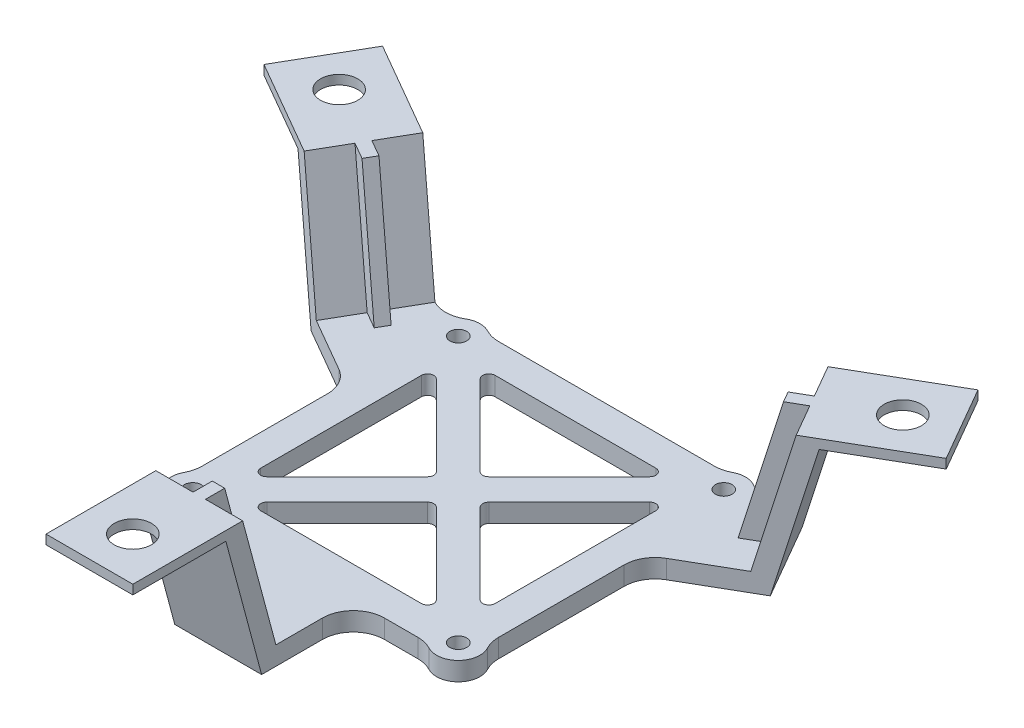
ISO-10303-21;
HEADER;
FILE_DESCRIPTION(('STEP AP214'),'2;1');
FILE_NAME('part.step','',(''),(''),'','','');
FILE_SCHEMA(('AUTOMOTIVE_DESIGN { 1 0 10303 214 1 1 1 1 }'));
ENDSEC;
DATA;
#1=APPLICATION_CONTEXT('core data for automotive mechanical design processes');
#2=APPLICATION_PROTOCOL_DEFINITION('international standard','automotive_design',2000,#1);
#3=PRODUCT_CONTEXT('',#1,'mechanical');
#4=PRODUCT('Part','Part','',(#3));
#5=PRODUCT_RELATED_PRODUCT_CATEGORY('part','',(#4));
#6=PRODUCT_DEFINITION_FORMATION('','',#4);
#7=PRODUCT_DEFINITION_CONTEXT('part definition',#1,'design');
#8=PRODUCT_DEFINITION('design','',#6,#7);
#9=PRODUCT_DEFINITION_SHAPE('','',#8);
#10=(LENGTH_UNIT() NAMED_UNIT(*) SI_UNIT(.MILLI.,.METRE.));
#11=(NAMED_UNIT(*) PLANE_ANGLE_UNIT() SI_UNIT($,.RADIAN.));
#12=(NAMED_UNIT(*) SI_UNIT($,.STERADIAN.) SOLID_ANGLE_UNIT());
#13=UNCERTAINTY_MEASURE_WITH_UNIT(LENGTH_MEASURE(1.E-05),#10,'distance_accuracy_value','');
#14=(GEOMETRIC_REPRESENTATION_CONTEXT(3) GLOBAL_UNCERTAINTY_ASSIGNED_CONTEXT((#13)) GLOBAL_UNIT_ASSIGNED_CONTEXT((#10,
#11,#12)) REPRESENTATION_CONTEXT('',''));
#15=CARTESIAN_POINT('',(0.,0.,0.));
#16=DIRECTION('',(0.,0.,1.));
#17=DIRECTION('',(1.,0.,0.));
#18=AXIS2_PLACEMENT_3D('',#15,#16,#17);
#19=CARTESIAN_POINT('',(-32.2621432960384,-8.89903810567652,-10.5436533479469));
#20=DIRECTION('',(0.836516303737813,0.258819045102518,0.482962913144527));
#21=DIRECTION('',(0.499999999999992,0.,-0.866025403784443));
#22=AXIS2_PLACEMENT_3D('',#19,#20,#21);
#23=PLANE('',#22);
#24=DIRECTION('',(0.499999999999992,0.,-0.866025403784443));
#25=VECTOR('',#24,1.);
#26=CARTESIAN_POINT('',(-39.664340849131,23.,-14.8173140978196));
#27=LINE('',#26,#25);
#28=CARTESIAN_POINT('',(-35.6643408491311,23.,-21.7455173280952));
#29=VERTEX_POINT('',#28);
#30=CARTESIAN_POINT('',(-32.6643408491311,23.,-26.9416697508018));
#31=VERTEX_POINT('',#30);
#32=EDGE_CURVE('E617',#29,#31,#27,.T.);
#33=ORIENTED_EDGE('',*,*,#32,.F.);
#34=DIRECTION('',(0.224143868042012,-0.965925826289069,0.129409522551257));
#35=VECTOR('',#34,1.);
#36=CARTESIAN_POINT('',(-28.2621432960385,-8.89903810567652,-17.4718565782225));
#37=LINE('',#36,#35);
#38=CARTESIAN_POINT('',(-31.0233246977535,3.,-19.066025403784));
#39=VERTEX_POINT('',#38);
#40=EDGE_CURVE('E533',#29,#39,#37,.T.);
#41=ORIENTED_EDGE('',*,*,#40,.T.);
#42=DIRECTION('',(-0.5,0.,0.866025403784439));
#43=VECTOR('',#42,1.);
#44=CARTESIAN_POINT('',(-31.5233246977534,3.,-18.1999999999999));
#45=LINE('',#44,#43);
#46=CARTESIAN_POINT('',(-28.0233246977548,3.,-24.2621778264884));
#47=VERTEX_POINT('',#46);
#48=EDGE_CURVE('E754',#47,#39,#45,.T.);
#49=ORIENTED_EDGE('',*,*,#48,.F.);
#50=DIRECTION('',(0.224143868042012,-0.965925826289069,0.129409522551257));
#51=VECTOR('',#50,1.);
#52=CARTESIAN_POINT('',(-25.2621432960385,-8.89903810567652,-22.6680090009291));
#53=LINE('',#52,#51);
#54=EDGE_CURVE('E576',#31,#47,#53,.T.);
#55=ORIENTED_EDGE('',*,*,#54,.F.);
#56=EDGE_LOOP('',(#33,#41,#49,#55));
#57=FACE_BOUND('',#56,.T.);
#58=ADVANCED_FACE('F45',(#57),#23,.T.);
#59=CARTESIAN_POINT('',(25.2621432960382,-8.89903810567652,-22.6680090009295));
#60=DIRECTION('',(-0.836516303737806,0.258819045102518,0.482962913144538));
#61=DIRECTION('',(0.500000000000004,0.,0.866025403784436));
#62=AXIS2_PLACEMENT_3D('',#59,#60,#61);
#63=PLANE('',#62);
#64=DIRECTION('',(0.500000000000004,0.,0.866025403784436));
#65=VECTOR('',#64,1.);
#66=CARTESIAN_POINT('',(32.6643408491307,23.,-26.9416697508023));
#67=LINE('',#66,#65);
#68=CARTESIAN_POINT('',(36.6643408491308,23.,-20.0134665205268));
#69=VERTEX_POINT('',#68);
#70=CARTESIAN_POINT('',(39.6643408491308,23.,-14.8173140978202));
#71=VERTEX_POINT('',#70);
#72=EDGE_CURVE('E663',#69,#71,#67,.T.);
#73=ORIENTED_EDGE('',*,*,#72,.F.);
#74=DIRECTION('',(-0.224143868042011,-0.965925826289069,0.12940952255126));
#75=VECTOR('',#74,1.);
#76=CARTESIAN_POINT('',(29.2621432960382,-8.89903810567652,-15.739805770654));
#77=LINE('',#76,#75);
#78=CARTESIAN_POINT('',(32.0233246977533,3.,-17.3339745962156));
#79=VERTEX_POINT('',#78);
#80=EDGE_CURVE('E559',#69,#79,#77,.T.);
#81=ORIENTED_EDGE('',*,*,#80,.T.);
#82=DIRECTION('',(-0.5,0.,-0.866025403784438));
#83=VECTOR('',#82,1.);
#84=CARTESIAN_POINT('',(31.5233246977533,3.,-18.1999999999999));
#85=LINE('',#84,#83);
#86=CARTESIAN_POINT('',(35.0233246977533,3.,-12.137822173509));
#87=VERTEX_POINT('',#86);
#88=EDGE_CURVE('E788',#87,#79,#85,.T.);
#89=ORIENTED_EDGE('',*,*,#88,.F.);
#90=DIRECTION('',(-0.224143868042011,-0.965925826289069,0.12940952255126));
#91=VECTOR('',#90,1.);
#92=CARTESIAN_POINT('',(32.2621432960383,-8.89903810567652,-10.5436533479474));
#93=LINE('',#92,#91);
#94=EDGE_CURVE('E621',#71,#87,#93,.T.);
#95=ORIENTED_EDGE('',*,*,#94,.F.);
#96=EDGE_LOOP('',(#73,#81,#89,#95));
#97=FACE_BOUND('',#96,.T.);
#98=ADVANCED_FACE('F1176',(#97),#63,.T.);
#99=CARTESIAN_POINT('',(7.,-8.89903810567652,33.2116623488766));
#100=DIRECTION('',(0.,0.258819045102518,-0.965925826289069));
#101=DIRECTION('',(0.,0.965925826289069,0.258819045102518));
#102=AXIS2_PLACEMENT_3D('',#99,#100,#101);
#103=PLANE('',#102);
#104=DIRECTION('',(-1.,0.,0.));
#105=VECTOR('',#104,1.);
#106=CARTESIAN_POINT('',(7.,23.,41.7589838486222));
#107=LINE('',#106,#105);
#108=CARTESIAN_POINT('',(-1.,23.,41.7589838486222));
#109=VERTEX_POINT('',#108);
#110=CARTESIAN_POINT('',(-7.,23.,41.7589838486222));
#111=VERTEX_POINT('',#110);
#112=EDGE_CURVE('E738',#109,#111,#107,.T.);
#113=ORIENTED_EDGE('',*,*,#112,.F.);
#114=DIRECTION('',(0.,-0.965925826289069,-0.258819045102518));
#115=VECTOR('',#114,1.);
#116=CARTESIAN_POINT('',(-1.,-8.89903810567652,33.2116623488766));
#117=LINE('',#116,#115);
#118=CARTESIAN_POINT('',(-1.,3.,36.3999999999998));
#119=VERTEX_POINT('',#118);
#120=EDGE_CURVE('E678',#109,#119,#117,.T.);
#121=ORIENTED_EDGE('',*,*,#120,.T.);
#122=DIRECTION('',(1.,0.,0.));
#123=VECTOR('',#122,1.);
#124=CARTESIAN_POINT('',(0.,3.,36.3999999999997));
#125=LINE('',#124,#123);
#126=CARTESIAN_POINT('',(-6.99999999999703,3.,36.3999999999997));
#127=VERTEX_POINT('',#126);
#128=EDGE_CURVE('E772',#127,#119,#125,.T.);
#129=ORIENTED_EDGE('',*,*,#128,.F.);
#130=DIRECTION('',(0.,-0.965925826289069,-0.258819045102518));
#131=VECTOR('',#130,1.);
#132=CARTESIAN_POINT('',(-7.,-8.89903810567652,33.2116623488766));
#133=LINE('',#132,#131);
#134=EDGE_CURVE('E699',#111,#127,#133,.T.);
#135=ORIENTED_EDGE('',*,*,#134,.F.);
#136=EDGE_LOOP('',(#113,#121,#129,#135));
#137=FACE_BOUND('',#136,.T.);
#138=ADVANCED_FACE('F1184',(#137),#103,.T.);
#139=CARTESIAN_POINT('',(-1.76776695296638,3.,-1.76776695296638));
#140=DIRECTION('',(-0.707106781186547,0.,-0.707106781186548));
#141=DIRECTION('',(-0.707106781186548,0.,0.707106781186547));
#142=AXIS2_PLACEMENT_3D('',#139,#140,#141);
#143=PLANE('',#142);
#144=DIRECTION('',(0.707106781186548,0.,-0.707106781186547));
#145=VECTOR('',#144,1.);
#146=CARTESIAN_POINT('',(-1.76776695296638,0.,-1.76776695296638));
#147=LINE('',#146,#145);
#148=CARTESIAN_POINT('',(0.707106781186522,0.,-4.24264068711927));
#149=VERTEX_POINT('',#148);
#150=CARTESIAN_POINT('',(13.657359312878,0.,-17.1928932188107));
#151=VERTEX_POINT('',#150);
#152=EDGE_CURVE('E902',#149,#151,#147,.T.);
#153=ORIENTED_EDGE('',*,*,#152,.F.);
#154=DIRECTION('',(0.,-1.,0.));
#155=VECTOR('',#154,1.);
#156=CARTESIAN_POINT('',(0.707106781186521,3.,-4.24264068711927));
#157=LINE('',#156,#155);
#158=CARTESIAN_POINT('',(0.707106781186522,3.,-4.24264068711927));
#159=VERTEX_POINT('',#158);
#160=EDGE_CURVE('E1039',#149,#159,#157,.F.);
#161=ORIENTED_EDGE('',*,*,#160,.T.);
#162=DIRECTION('',(0.707106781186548,0.,-0.707106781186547));
#163=VECTOR('',#162,1.);
#164=CARTESIAN_POINT('',(-1.76776695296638,3.,-1.76776695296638));
#165=LINE('',#164,#163);
#166=CARTESIAN_POINT('',(13.657359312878,3.,-17.1928932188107));
#167=VERTEX_POINT('',#166);
#168=EDGE_CURVE('E818',#159,#167,#165,.T.);
#169=ORIENTED_EDGE('',*,*,#168,.T.);
#170=DIRECTION('',(0.,-1.,0.));
#171=VECTOR('',#170,1.);
#172=CARTESIAN_POINT('',(13.657359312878,3.,-17.1928932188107));
#173=LINE('',#172,#171);
#174=EDGE_CURVE('E1036',#167,#151,#173,.T.);
#175=ORIENTED_EDGE('',*,*,#174,.T.);
#176=EDGE_LOOP('',(#153,#161,#169,#175));
#177=FACE_BOUND('',#176,.T.);
#178=ADVANCED_FACE('F1612',(#177),#143,.T.);
#179=CARTESIAN_POINT('',(1.76776695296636,3.,-1.76776695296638));
#180=DIRECTION('',(0.707106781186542,0.,-0.707106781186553));
#181=DIRECTION('',(-0.707106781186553,0.,-0.707106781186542));
#182=AXIS2_PLACEMENT_3D('',#179,#180,#181);
#183=PLANE('',#182);
#184=DIRECTION('',(0.707106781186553,0.,0.707106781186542));
#185=VECTOR('',#184,1.);
#186=CARTESIAN_POINT('',(1.76776695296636,3.,-1.76776695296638));
#187=LINE('',#186,#185);
#188=CARTESIAN_POINT('',(-13.6573593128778,3.,-17.1928932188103));
#189=VERTEX_POINT('',#188);
#190=CARTESIAN_POINT('',(-0.707106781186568,3.,-4.24264068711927));
#191=VERTEX_POINT('',#190);
#192=EDGE_CURVE('E821',#189,#191,#187,.T.);
#193=ORIENTED_EDGE('',*,*,#192,.T.);
#194=DIRECTION('',(0.,-1.,0.));
#195=VECTOR('',#194,1.);
#196=CARTESIAN_POINT('',(-0.707106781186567,0.,-4.24264068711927));
#197=LINE('',#196,#195);
#198=CARTESIAN_POINT('',(-0.707106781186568,0.,-4.24264068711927));
#199=VERTEX_POINT('',#198);
#200=EDGE_CURVE('E1033',#191,#199,#197,.T.);
#201=ORIENTED_EDGE('',*,*,#200,.T.);
#202=DIRECTION('',(0.707106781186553,0.,0.707106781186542));
#203=VECTOR('',#202,1.);
#204=CARTESIAN_POINT('',(1.76776695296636,0.,-1.76776695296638));
#205=LINE('',#204,#203);
#206=CARTESIAN_POINT('',(-13.6573593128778,0.,-17.1928932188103));
#207=VERTEX_POINT('',#206);
#208=EDGE_CURVE('E905',#207,#199,#205,.T.);
#209=ORIENTED_EDGE('',*,*,#208,.F.);
#210=DIRECTION('',(0.,-1.,0.));
#211=VECTOR('',#210,1.);
#212=CARTESIAN_POINT('',(-13.6573593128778,3.,-17.1928932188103));
#213=LINE('',#212,#211);
#214=EDGE_CURVE('E1031',#207,#189,#213,.F.);
#215=ORIENTED_EDGE('',*,*,#214,.T.);
#216=EDGE_LOOP('',(#193,#201,#209,#215));
#217=FACE_BOUND('',#216,.T.);
#218=ADVANCED_FACE('F1609',(#217),#183,.T.);
#219=CARTESIAN_POINT('',(-18.8999999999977,3.,0.));
#220=DIRECTION('',(1.,0.,0.));
#221=DIRECTION('',(0.,0.,-1.));
#222=AXIS2_PLACEMENT_3D('',#219,#220,#221);
#223=PLANE('',#222);
#224=DIRECTION('',(0.,0.,1.));
#225=VECTOR('',#224,1.);
#226=CARTESIAN_POINT('',(-18.8999999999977,3.,0.));
#227=LINE('',#226,#225);
#228=CARTESIAN_POINT('',(-18.8999999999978,3.,-12.950252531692));
#229=VERTEX_POINT('',#228);
#230=CARTESIAN_POINT('',(-18.8999999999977,3.,12.9502525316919));
#231=VERTEX_POINT('',#230);
#232=EDGE_CURVE('E809',#229,#231,#227,.T.);
#233=ORIENTED_EDGE('',*,*,#232,.T.);
#234=DIRECTION('',(0.,-1.,0.));
#235=VECTOR('',#234,1.);
#236=CARTESIAN_POINT('',(-18.8999999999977,0.,12.9502525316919));
#237=LINE('',#236,#235);
#238=CARTESIAN_POINT('',(-18.8999999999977,0.,12.9502525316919));
#239=VERTEX_POINT('',#238);
#240=EDGE_CURVE('E1078',#231,#239,#237,.T.);
#241=ORIENTED_EDGE('',*,*,#240,.T.);
#242=DIRECTION('',(0.,0.,1.));
#243=VECTOR('',#242,1.);
#244=CARTESIAN_POINT('',(-18.8999999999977,0.,0.));
#245=LINE('',#244,#243);
#246=CARTESIAN_POINT('',(-18.8999999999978,0.,-12.950252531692));
#247=VERTEX_POINT('',#246);
#248=EDGE_CURVE('E893',#247,#239,#245,.T.);
#249=ORIENTED_EDGE('',*,*,#248,.F.);
#250=DIRECTION('',(0.,-1.,0.));
#251=VECTOR('',#250,1.);
#252=CARTESIAN_POINT('',(-18.8999999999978,3.,-12.950252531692));
#253=LINE('',#252,#251);
#254=EDGE_CURVE('E1076',#247,#229,#253,.F.);
#255=ORIENTED_EDGE('',*,*,#254,.T.);
#256=EDGE_LOOP('',(#233,#241,#249,#255));
#257=FACE_BOUND('',#256,.T.);
#258=ADVANCED_FACE('F1143',(#257),#223,.T.);
#259=CARTESIAN_POINT('',(-1.76776695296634,3.,1.76776695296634));
#260=DIRECTION('',(0.707106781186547,0.,-0.707106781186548));
#261=DIRECTION('',(-0.707106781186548,0.,-0.707106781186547));
#262=AXIS2_PLACEMENT_3D('',#259,#260,#261);
#263=PLANE('',#262);
#264=DIRECTION('',(0.707106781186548,0.,0.707106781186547));
#265=VECTOR('',#264,1.);
#266=CARTESIAN_POINT('',(-1.76776695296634,0.,1.76776695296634));
#267=LINE('',#266,#265);
#268=CARTESIAN_POINT('',(-17.1928932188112,0.,-13.6573593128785));
#269=VERTEX_POINT('',#268);
#270=CARTESIAN_POINT('',(-4.24264068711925,0.,-0.707106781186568));
#271=VERTEX_POINT('',#270);
#272=EDGE_CURVE('E896',#269,#271,#267,.T.);
#273=ORIENTED_EDGE('',*,*,#272,.T.);
#274=DIRECTION('',(0.,-1.,0.));
#275=VECTOR('',#274,1.);
#276=CARTESIAN_POINT('',(-4.24264068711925,3.,-0.707106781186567));
#277=LINE('',#276,#275);
#278=CARTESIAN_POINT('',(-4.24264068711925,3.,-0.707106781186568));
#279=VERTEX_POINT('',#278);
#280=EDGE_CURVE('E1089',#271,#279,#277,.F.);
#281=ORIENTED_EDGE('',*,*,#280,.T.);
#282=DIRECTION('',(0.707106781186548,0.,0.707106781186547));
#283=VECTOR('',#282,1.);
#284=CARTESIAN_POINT('',(-1.76776695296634,3.,1.76776695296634));
#285=LINE('',#284,#283);
#286=CARTESIAN_POINT('',(-17.1928932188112,3.,-13.6573593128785));
#287=VERTEX_POINT('',#286);
#288=EDGE_CURVE('E812',#287,#279,#285,.T.);
#289=ORIENTED_EDGE('',*,*,#288,.F.);
#290=DIRECTION('',(0.,-1.,0.));
#291=VECTOR('',#290,1.);
#292=CARTESIAN_POINT('',(-17.1928932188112,3.,-13.6573593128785));
#293=LINE('',#292,#291);
#294=EDGE_CURVE('E1086',#287,#269,#293,.T.);
#295=ORIENTED_EDGE('',*,*,#294,.T.);
#296=EDGE_LOOP('',(#273,#281,#289,#295));
#297=FACE_BOUND('',#296,.T.);
#298=ADVANCED_FACE('F1152',(#297),#263,.F.);
#299=CARTESIAN_POINT('',(1.76776695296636,3.,-1.76776695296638));
#300=DIRECTION('',(0.707106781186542,0.,-0.707106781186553));
#301=DIRECTION('',(-0.707106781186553,0.,-0.707106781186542));
#302=AXIS2_PLACEMENT_3D('',#299,#300,#301);
#303=PLANE('',#302);
#304=DIRECTION('',(0.707106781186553,0.,0.707106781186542));
#305=VECTOR('',#304,1.);
#306=CARTESIAN_POINT('',(1.76776695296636,3.,-1.76776695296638));
#307=LINE('',#306,#305);
#308=CARTESIAN_POINT('',(4.24264068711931,3.,0.707106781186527));
#309=VERTEX_POINT('',#308);
#310=CARTESIAN_POINT('',(17.1928932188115,3.,13.6573593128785));
#311=VERTEX_POINT('',#310);
#312=EDGE_CURVE('E800',#309,#311,#307,.T.);
#313=ORIENTED_EDGE('',*,*,#312,.T.);
#314=DIRECTION('',(0.,-1.,0.));
#315=VECTOR('',#314,1.);
#316=CARTESIAN_POINT('',(17.1928932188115,3.,13.6573593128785));
#317=LINE('',#316,#315);
#318=CARTESIAN_POINT('',(17.1928932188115,0.,13.6573593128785));
#319=VERTEX_POINT('',#318);
#320=EDGE_CURVE('E1048',#311,#319,#317,.T.);
#321=ORIENTED_EDGE('',*,*,#320,.T.);
#322=DIRECTION('',(0.707106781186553,0.,0.707106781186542));
#323=VECTOR('',#322,1.);
#324=CARTESIAN_POINT('',(1.76776695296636,0.,-1.76776695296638));
#325=LINE('',#324,#323);
#326=CARTESIAN_POINT('',(4.24264068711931,0.,0.707106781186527));
#327=VERTEX_POINT('',#326);
#328=EDGE_CURVE('E884',#327,#319,#325,.T.);
#329=ORIENTED_EDGE('',*,*,#328,.F.);
#330=DIRECTION('',(0.,-1.,0.));
#331=VECTOR('',#330,1.);
#332=CARTESIAN_POINT('',(4.24264068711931,3.,0.707106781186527));
#333=LINE('',#332,#331);
#334=EDGE_CURVE('E1046',#327,#309,#333,.F.);
#335=ORIENTED_EDGE('',*,*,#334,.T.);
#336=EDGE_LOOP('',(#313,#321,#329,#335));
#337=FACE_BOUND('',#336,.T.);
#338=ADVANCED_FACE('F1622',(#337),#303,.T.);
#339=CARTESIAN_POINT('',(1.76776695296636,3.,1.76776695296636));
#340=DIRECTION('',(-0.707106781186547,0.,-0.707106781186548));
#341=DIRECTION('',(-0.707106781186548,0.,0.707106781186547));
#342=AXIS2_PLACEMENT_3D('',#339,#340,#341);
#343=PLANE('',#342);
#344=DIRECTION('',(0.707106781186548,0.,-0.707106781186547));
#345=VECTOR('',#344,1.);
#346=CARTESIAN_POINT('',(1.76776695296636,0.,1.76776695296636));
#347=LINE('',#346,#345);
#348=CARTESIAN_POINT('',(4.2426406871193,0.,-0.707106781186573));
#349=VERTEX_POINT('',#348);
#350=CARTESIAN_POINT('',(17.1928932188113,0.,-13.6573593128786));
#351=VERTEX_POINT('',#350);
#352=EDGE_CURVE('E887',#349,#351,#347,.T.);
#353=ORIENTED_EDGE('',*,*,#352,.T.);
#354=DIRECTION('',(0.,-1.,0.));
#355=VECTOR('',#354,1.);
#356=CARTESIAN_POINT('',(17.1928932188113,3.,-13.6573593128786));
#357=LINE('',#356,#355);
#358=CARTESIAN_POINT('',(17.1928932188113,3.,-13.6573593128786));
#359=VERTEX_POINT('',#358);
#360=EDGE_CURVE('E1059',#351,#359,#357,.F.);
#361=ORIENTED_EDGE('',*,*,#360,.T.);
#362=DIRECTION('',(0.707106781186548,0.,-0.707106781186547));
#363=VECTOR('',#362,1.);
#364=CARTESIAN_POINT('',(1.76776695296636,3.,1.76776695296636));
#365=LINE('',#364,#363);
#366=CARTESIAN_POINT('',(4.2426406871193,3.,-0.707106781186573));
#367=VERTEX_POINT('',#366);
#368=EDGE_CURVE('E803',#367,#359,#365,.T.);
#369=ORIENTED_EDGE('',*,*,#368,.F.);
#370=DIRECTION('',(0.,-1.,0.));
#371=VECTOR('',#370,1.);
#372=CARTESIAN_POINT('',(4.2426406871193,3.,-0.707106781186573));
#373=LINE('',#372,#371);
#374=EDGE_CURVE('E1056',#367,#349,#373,.T.);
#375=ORIENTED_EDGE('',*,*,#374,.T.);
#376=EDGE_LOOP('',(#353,#361,#369,#375));
#377=FACE_BOUND('',#376,.T.);
#378=ADVANCED_FACE('F1628',(#377),#343,.F.);
#379=CARTESIAN_POINT('',(1.76776695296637,3.,1.76776695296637));
#380=DIRECTION('',(-0.707106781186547,0.,-0.707106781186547));
#381=DIRECTION('',(-0.707106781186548,0.,0.707106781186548));
#382=AXIS2_PLACEMENT_3D('',#379,#380,#381);
#383=PLANE('',#382);
#384=DIRECTION('',(0.707106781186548,0.,-0.707106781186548));
#385=VECTOR('',#384,1.);
#386=CARTESIAN_POINT('',(1.76776695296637,0.,1.76776695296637));
#387=LINE('',#386,#385);
#388=CARTESIAN_POINT('',(-13.6573593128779,0.,17.1928932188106));
#389=VERTEX_POINT('',#388);
#390=CARTESIAN_POINT('',(-0.707106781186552,0.,4.24264068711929));
#391=VERTEX_POINT('',#390);
#392=EDGE_CURVE('E875',#389,#391,#387,.T.);
#393=ORIENTED_EDGE('',*,*,#392,.T.);
#394=DIRECTION('',(0.,-1.,0.));
#395=VECTOR('',#394,1.);
#396=CARTESIAN_POINT('',(-0.707106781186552,3.,4.24264068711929));
#397=LINE('',#396,#395);
#398=CARTESIAN_POINT('',(-0.707106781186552,3.,4.24264068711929));
#399=VERTEX_POINT('',#398);
#400=EDGE_CURVE('E1069',#391,#399,#397,.F.);
#401=ORIENTED_EDGE('',*,*,#400,.T.);
#402=DIRECTION('',(0.707106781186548,0.,-0.707106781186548));
#403=VECTOR('',#402,1.);
#404=CARTESIAN_POINT('',(1.76776695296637,3.,1.76776695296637));
#405=LINE('',#404,#403);
#406=CARTESIAN_POINT('',(-13.6573593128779,3.,17.1928932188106));
#407=VERTEX_POINT('',#406);
#408=EDGE_CURVE('E791',#407,#399,#405,.T.);
#409=ORIENTED_EDGE('',*,*,#408,.F.);
#410=DIRECTION('',(0.,-1.,0.));
#411=VECTOR('',#410,1.);
#412=CARTESIAN_POINT('',(-13.6573593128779,3.,17.1928932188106));
#413=LINE('',#412,#411);
#414=EDGE_CURVE('E1066',#407,#389,#413,.T.);
#415=ORIENTED_EDGE('',*,*,#414,.T.);
#416=EDGE_LOOP('',(#393,#401,#409,#415));
#417=FACE_BOUND('',#416,.T.);
#418=ADVANCED_FACE('F1631',(#417),#383,.F.);
#419=CARTESIAN_POINT('',(-1.76776695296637,3.,1.76776695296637));
#420=DIRECTION('',(0.707106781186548,0.,-0.707106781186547));
#421=DIRECTION('',(-0.707106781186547,0.,-0.707106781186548));
#422=AXIS2_PLACEMENT_3D('',#419,#420,#421);
#423=PLANE('',#422);
#424=DIRECTION('',(0.707106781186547,0.,0.707106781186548));
#425=VECTOR('',#424,1.);
#426=CARTESIAN_POINT('',(-1.76776695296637,3.,1.76776695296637));
#427=LINE('',#426,#425);
#428=CARTESIAN_POINT('',(0.707106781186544,3.,4.24264068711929));
#429=VERTEX_POINT('',#428);
#430=CARTESIAN_POINT('',(13.6573593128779,3.,17.1928932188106));
#431=VERTEX_POINT('',#430);
#432=EDGE_CURVE('E794',#429,#431,#427,.T.);
#433=ORIENTED_EDGE('',*,*,#432,.F.);
#434=DIRECTION('',(0.,-1.,0.));
#435=VECTOR('',#434,1.);
#436=CARTESIAN_POINT('',(0.707106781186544,0.,4.24264068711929));
#437=LINE('',#436,#435);
#438=CARTESIAN_POINT('',(0.707106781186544,0.,4.24264068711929));
#439=VERTEX_POINT('',#438);
#440=EDGE_CURVE('E1063',#429,#439,#437,.T.);
#441=ORIENTED_EDGE('',*,*,#440,.T.);
#442=DIRECTION('',(0.707106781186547,0.,0.707106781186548));
#443=VECTOR('',#442,1.);
#444=CARTESIAN_POINT('',(-1.76776695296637,0.,1.76776695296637));
#445=LINE('',#444,#443);
#446=CARTESIAN_POINT('',(13.6573593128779,0.,17.1928932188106));
#447=VERTEX_POINT('',#446);
#448=EDGE_CURVE('E878',#439,#447,#445,.T.);
#449=ORIENTED_EDGE('',*,*,#448,.T.);
#450=DIRECTION('',(0.,-1.,0.));
#451=VECTOR('',#450,1.);
#452=CARTESIAN_POINT('',(13.6573593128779,3.,17.1928932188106));
#453=LINE('',#452,#451);
#454=EDGE_CURVE('E1061',#447,#431,#453,.F.);
#455=ORIENTED_EDGE('',*,*,#454,.T.);
#456=EDGE_LOOP('',(#433,#441,#449,#455));
#457=FACE_BOUND('',#456,.T.);
#458=ADVANCED_FACE('F1639',(#457),#423,.F.);
#459=CARTESIAN_POINT('',(21.4000000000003,3.,-21.4000000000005));
#460=DIRECTION('',(0.,-1.,0.));
#461=DIRECTION('',(0.,0.,-1.));
#462=AXIS2_PLACEMENT_3D('',#459,#460,#461);
#463=CYLINDRICAL_SURFACE('',#462,3.50000000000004);
#464=CARTESIAN_POINT('',(21.4000000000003,3.,-21.4000000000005));
#465=DIRECTION('',(0.,1.,0.));
#466=DIRECTION('',(0.,0.,1.));
#467=AXIS2_PLACEMENT_3D('',#464,#465,#466);
#468=CIRCLE('',#467,3.50000000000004);
#469=CARTESIAN_POINT('',(23.1863685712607,3.,-24.4097985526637));
#470=VERTEX_POINT('',#469);
#471=CARTESIAN_POINT('',(19.7529411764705,3.,-24.488235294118));
#472=VERTEX_POINT('',#471);
#473=EDGE_CURVE('E743',#470,#472,#468,.T.);
#474=ORIENTED_EDGE('',*,*,#473,.F.);
#475=DIRECTION('',(0.,-1.,0.));
#476=VECTOR('',#475,1.);
#477=CARTESIAN_POINT('',(23.1863685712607,3.,-24.4097985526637));
#478=LINE('',#477,#476);
#479=CARTESIAN_POINT('',(23.1863685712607,0.,-24.4097985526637));
#480=VERTEX_POINT('',#479);
#481=EDGE_CURVE('E944',#470,#480,#478,.T.);
#482=ORIENTED_EDGE('',*,*,#481,.T.);
#483=CARTESIAN_POINT('',(21.4000000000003,0.,-21.4000000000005));
#484=DIRECTION('',(0.,1.,0.));
#485=DIRECTION('',(0.,0.,1.));
#486=AXIS2_PLACEMENT_3D('',#483,#484,#485);
#487=CIRCLE('',#486,3.50000000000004);
#488=CARTESIAN_POINT('',(19.7529411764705,0.,-24.488235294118));
#489=VERTEX_POINT('',#488);
#490=EDGE_CURVE('E742',#480,#489,#487,.T.);
#491=ORIENTED_EDGE('',*,*,#490,.T.);
#492=DIRECTION('',(0.,-1.,0.));
#493=VECTOR('',#492,1.);
#494=CARTESIAN_POINT('',(19.7529411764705,3.,-24.488235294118));
#495=LINE('',#494,#493);
#496=EDGE_CURVE('E942',#489,#472,#495,.F.);
#497=ORIENTED_EDGE('',*,*,#496,.T.);
#498=EDGE_LOOP('',(#474,#482,#491,#497));
#499=FACE_BOUND('',#498,.T.);
#500=ADVANCED_FACE('F1351',(#499),#463,.T.);
#501=CARTESIAN_POINT('',(0.,3.,-23.9));
#502=DIRECTION('',(0.,0.,-1.));
#503=DIRECTION('',(-1.,0.,0.));
#504=AXIS2_PLACEMENT_3D('',#501,#502,#503);
#505=PLANE('',#504);
#506=DIRECTION('',(1.,0.,0.));
#507=VECTOR('',#506,1.);
#508=CARTESIAN_POINT('',(0.,3.,-23.9));
#509=LINE('',#508,#507);
#510=CARTESIAN_POINT('',(-17.4000000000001,3.,-23.9));
#511=VERTEX_POINT('',#510);
#512=CARTESIAN_POINT('',(17.3999999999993,3.,-23.9));
#513=VERTEX_POINT('',#512);
#514=EDGE_CURVE('E746',#511,#513,#509,.T.);
#515=ORIENTED_EDGE('',*,*,#514,.T.);
#516=DIRECTION('',(0.,-1.,0.));
#517=VECTOR('',#516,1.);
#518=CARTESIAN_POINT('',(17.3999999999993,3.,-23.9));
#519=LINE('',#518,#517);
#520=CARTESIAN_POINT('',(17.3999999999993,0.,-23.9));
#521=VERTEX_POINT('',#520);
#522=EDGE_CURVE('E949',#513,#521,#519,.T.);
#523=ORIENTED_EDGE('',*,*,#522,.T.);
#524=DIRECTION('',(1.,0.,0.));
#525=VECTOR('',#524,1.);
#526=CARTESIAN_POINT('',(0.,0.,-23.9));
#527=LINE('',#526,#525);
#528=CARTESIAN_POINT('',(-17.4000000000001,0.,-23.9));
#529=VERTEX_POINT('',#528);
#530=EDGE_CURVE('E842',#529,#521,#527,.T.);
#531=ORIENTED_EDGE('',*,*,#530,.F.);
#532=DIRECTION('',(0.,-1.,0.));
#533=VECTOR('',#532,1.);
#534=CARTESIAN_POINT('',(-17.4000000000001,3.,-23.9));
#535=LINE('',#534,#533);
#536=EDGE_CURVE('E947',#529,#511,#535,.F.);
#537=ORIENTED_EDGE('',*,*,#536,.T.);
#538=EDGE_LOOP('',(#515,#523,#531,#537));
#539=FACE_BOUND('',#538,.T.);
#540=ADVANCED_FACE('F1359',(#539),#505,.T.);
#541=CARTESIAN_POINT('',(-21.3999999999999,3.,-21.3999999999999));
#542=DIRECTION('',(0.,-1.,0.));
#543=DIRECTION('',(0.,0.,-1.));
#544=AXIS2_PLACEMENT_3D('',#541,#542,#543);
#545=CYLINDRICAL_SURFACE('',#544,3.50000000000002);
#546=CARTESIAN_POINT('',(-21.3999999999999,0.,-21.3999999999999));
#547=DIRECTION('',(0.,1.,0.));
#548=DIRECTION('',(0.,0.,1.));
#549=AXIS2_PLACEMENT_3D('',#546,#547,#548);
#550=CIRCLE('',#549,3.50000000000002);
#551=CARTESIAN_POINT('',(-19.7529411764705,0.,-24.4882352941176));
#552=VERTEX_POINT('',#551);
#553=CARTESIAN_POINT('',(-23.1863685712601,0.,-24.4097985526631));
#554=VERTEX_POINT('',#553);
#555=EDGE_CURVE('E845',#552,#554,#550,.T.);
#556=ORIENTED_EDGE('',*,*,#555,.T.);
#557=DIRECTION('',(0.,-1.,0.));
#558=VECTOR('',#557,1.);
#559=CARTESIAN_POINT('',(-23.1863685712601,3.,-24.4097985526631));
#560=LINE('',#559,#558);
#561=CARTESIAN_POINT('',(-23.1863685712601,3.,-24.4097985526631));
#562=VERTEX_POINT('',#561);
#563=EDGE_CURVE('E955',#554,#562,#560,.F.);
#564=ORIENTED_EDGE('',*,*,#563,.T.);
#565=CARTESIAN_POINT('',(-21.3999999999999,3.,-21.3999999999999));
#566=DIRECTION('',(0.,1.,0.));
#567=DIRECTION('',(0.,0.,1.));
#568=AXIS2_PLACEMENT_3D('',#565,#566,#567);
#569=CIRCLE('',#568,3.50000000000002);
#570=CARTESIAN_POINT('',(-19.7529411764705,3.,-24.4882352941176));
#571=VERTEX_POINT('',#570);
#572=EDGE_CURVE('E750',#571,#562,#569,.T.);
#573=ORIENTED_EDGE('',*,*,#572,.F.);
#574=DIRECTION('',(0.,-1.,0.));
#575=VECTOR('',#574,1.);
#576=CARTESIAN_POINT('',(-19.7529411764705,3.,-24.4882352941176));
#577=LINE('',#576,#575);
#578=EDGE_CURVE('E952',#571,#552,#577,.T.);
#579=ORIENTED_EDGE('',*,*,#578,.T.);
#580=EDGE_LOOP('',(#556,#564,#573,#579));
#581=FACE_BOUND('',#580,.T.);
#582=ADVANCED_FACE('F1368',(#581),#545,.T.);
#583=CARTESIAN_POINT('',(-3.49999999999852,3.,6.06217782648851));
#584=DIRECTION('',(0.5,0.,-0.866025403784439));
#585=DIRECTION('',(-0.866025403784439,0.,-0.5));
#586=AXIS2_PLACEMENT_3D('',#583,#584,#585);
#587=PLANE('',#586);
#588=DIRECTION('',(0.866025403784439,0.,0.5));
#589=VECTOR('',#588,1.);
#590=CARTESIAN_POINT('',(-3.49999999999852,0.,6.06217782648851));
#591=LINE('',#590,#589);
#592=CARTESIAN_POINT('',(-37.016898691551,0.,-13.2888126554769));
#593=VERTEX_POINT('',#592);
#594=CARTESIAN_POINT('',(-26.4,0.,-7.15914333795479));
#595=VERTEX_POINT('',#594);
#596=EDGE_CURVE('E848',#593,#595,#591,.T.);
#597=ORIENTED_EDGE('',*,*,#596,.T.);
#598=DIRECTION('',(0.,-1.,0.));
#599=VECTOR('',#598,1.);
#600=CARTESIAN_POINT('',(-26.4,3.,-7.15914333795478));
#601=LINE('',#600,#599);
#602=CARTESIAN_POINT('',(-26.4,3.,-7.15914333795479));
#603=VERTEX_POINT('',#602);
#604=EDGE_CURVE('E932',#595,#603,#601,.F.);
#605=ORIENTED_EDGE('',*,*,#604,.T.);
#606=DIRECTION('',(0.866025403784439,0.,0.5));
#607=VECTOR('',#606,1.);
#608=CARTESIAN_POINT('',(-3.49999999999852,3.,6.06217782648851));
#609=LINE('',#608,#607);
#610=CARTESIAN_POINT('',(-35.0233246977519,3.,-12.1378221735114));
#611=VERTEX_POINT('',#610);
#612=EDGE_CURVE('E756',#611,#603,#609,.T.);
#613=ORIENTED_EDGE('',*,*,#612,.F.);
#614=DIRECTION('',(0.224143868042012,-0.965925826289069,0.129409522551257));
#615=VECTOR('',#614,1.);
#616=CARTESIAN_POINT('',(-32.2621432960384,-8.89903810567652,-10.5436533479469));
#617=LINE('',#616,#615);
#618=CARTESIAN_POINT('',(-39.664340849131,23.,-14.8173140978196));
#619=VERTEX_POINT('',#618);
#620=EDGE_CURVE('E577',#619,#611,#617,.T.);
#621=ORIENTED_EDGE('',*,*,#620,.F.);
#622=DIRECTION('',(0.866025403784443,0.,0.499999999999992));
#623=VECTOR('',#622,1.);
#624=CARTESIAN_POINT('',(-3.49999999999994,23.,6.0621778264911));
#625=LINE('',#624,#623);
#626=CARTESIAN_POINT('',(-54.9963721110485,23.,-23.6692664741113));
#627=VERTEX_POINT('',#626);
#628=EDGE_CURVE('E580',#627,#619,#625,.T.);
#629=ORIENTED_EDGE('',*,*,#628,.F.);
#630=DIRECTION('',(0.,1.,0.));
#631=VECTOR('',#630,1.);
#632=CARTESIAN_POINT('',(-54.9963721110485,0.,-23.6692664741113));
#633=LINE('',#632,#631);
#634=CARTESIAN_POINT('',(-54.9963721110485,21.5,-23.6692664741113));
#635=VERTEX_POINT('',#634);
#636=EDGE_CURVE('E584',#635,#627,#633,.T.);
#637=ORIENTED_EDGE('',*,*,#636,.F.);
#638=DIRECTION('',(-0.866025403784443,0.,-0.499999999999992));
#639=VECTOR('',#638,1.);
#640=CARTESIAN_POINT('',(-3.49999999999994,21.5,6.0621778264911));
#641=LINE('',#640,#639);
#642=CARTESIAN_POINT('',(-42.0059910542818,21.5,-16.1692664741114));
#643=VERTEX_POINT('',#642);
#644=EDGE_CURVE('E587',#643,#635,#641,.T.);
#645=ORIENTED_EDGE('',*,*,#644,.F.);
#646=DIRECTION('',(-0.224143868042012,0.965925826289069,-0.129409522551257));
#647=VECTOR('',#646,1.);
#648=CARTESIAN_POINT('',(-34.7716922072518,-9.67549524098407,-11.9925420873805));
#649=LINE('',#648,#647);
#650=EDGE_CURVE('E590',#593,#643,#649,.T.);
#651=ORIENTED_EDGE('',*,*,#650,.F.);
#652=EDGE_LOOP('',(#597,#605,#613,#621,#629,#637,#645,#651));
#653=FACE_BOUND('',#652,.T.);
#654=ADVANCED_FACE('F1209',(#653),#587,.F.);
#655=CARTESIAN_POINT('',(-23.9,3.,1.54990247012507E-13));
#656=DIRECTION('',(1.,0.,0.));
#657=DIRECTION('',(0.,0.,-1.));
#658=AXIS2_PLACEMENT_3D('',#655,#656,#657);
#659=PLANE('',#658);
#660=DIRECTION('',(0.,0.,1.));
#661=VECTOR('',#660,1.);
#662=CARTESIAN_POINT('',(-23.9,3.,1.54990247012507E-13));
#663=LINE('',#662,#661);
#664=CARTESIAN_POINT('',(-23.9,3.,-2.82901631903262));
#665=VERTEX_POINT('',#664);
#666=CARTESIAN_POINT('',(-23.8999999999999,3.,17.4000000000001));
#667=VERTEX_POINT('',#666);
#668=EDGE_CURVE('E759',#665,#667,#663,.T.);
#669=ORIENTED_EDGE('',*,*,#668,.F.);
#670=DIRECTION('',(0.,-1.,0.));
#671=VECTOR('',#670,1.);
#672=CARTESIAN_POINT('',(-23.9,0.,-2.82901631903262));
#673=LINE('',#672,#671);
#674=CARTESIAN_POINT('',(-23.9,0.,-2.82901631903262));
#675=VERTEX_POINT('',#674);
#676=EDGE_CURVE('E929',#665,#675,#673,.T.);
#677=ORIENTED_EDGE('',*,*,#676,.T.);
#678=DIRECTION('',(0.,0.,1.));
#679=VECTOR('',#678,1.);
#680=CARTESIAN_POINT('',(-23.9,0.,1.54990247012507E-13));
#681=LINE('',#680,#679);
#682=CARTESIAN_POINT('',(-23.8999999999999,0.,17.4000000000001));
#683=VERTEX_POINT('',#682);
#684=EDGE_CURVE('E851',#675,#683,#681,.T.);
#685=ORIENTED_EDGE('',*,*,#684,.T.);
#686=DIRECTION('',(0.,1.,0.));
#687=VECTOR('',#686,1.);
#688=CARTESIAN_POINT('',(-23.8999999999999,3.,17.4000000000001));
#689=LINE('',#688,#687);
#690=EDGE_CURVE('E927',#683,#667,#689,.T.);
#691=ORIENTED_EDGE('',*,*,#690,.T.);
#692=EDGE_LOOP('',(#669,#677,#685,#691));
#693=FACE_BOUND('',#692,.T.);
#694=ADVANCED_FACE('F1235',(#693),#659,.F.);
#695=CARTESIAN_POINT('',(-21.3999999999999,3.,21.4000000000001));
#696=DIRECTION('',(0.,-1.,0.));
#697=DIRECTION('',(0.,0.,-1.));
#698=AXIS2_PLACEMENT_3D('',#695,#696,#697);
#699=CYLINDRICAL_SURFACE('',#698,3.5);
#700=CARTESIAN_POINT('',(-21.3999999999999,3.,21.4000000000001));
#701=DIRECTION('',(0.,1.,0.));
#702=DIRECTION('',(0.,0.,1.));
#703=AXIS2_PLACEMENT_3D('',#700,#701,#702);
#704=CIRCLE('',#703,3.5);
#705=CARTESIAN_POINT('',(-24.4882352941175,3.,19.7529411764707));
#706=VERTEX_POINT('',#705);
#707=CARTESIAN_POINT('',(-19.7529411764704,3.,24.4882352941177));
#708=VERTEX_POINT('',#707);
#709=EDGE_CURVE('E762',#706,#708,#704,.T.);
#710=ORIENTED_EDGE('',*,*,#709,.F.);
#711=DIRECTION('',(0.,-1.,0.));
#712=VECTOR('',#711,1.);
#713=CARTESIAN_POINT('',(-24.4882352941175,3.,19.7529411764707));
#714=LINE('',#713,#712);
#715=CARTESIAN_POINT('',(-24.4882352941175,0.,19.7529411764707));
#716=VERTEX_POINT('',#715);
#717=EDGE_CURVE('E979',#706,#716,#714,.T.);
#718=ORIENTED_EDGE('',*,*,#717,.T.);
#719=CARTESIAN_POINT('',(-21.3999999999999,0.,21.4000000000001));
#720=DIRECTION('',(0.,1.,0.));
#721=DIRECTION('',(0.,0.,1.));
#722=AXIS2_PLACEMENT_3D('',#719,#720,#721);
#723=CIRCLE('',#722,3.5);
#724=CARTESIAN_POINT('',(-19.7529411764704,0.,24.4882352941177));
#725=VERTEX_POINT('',#724);
#726=EDGE_CURVE('E854',#716,#725,#723,.T.);
#727=ORIENTED_EDGE('',*,*,#726,.T.);
#728=DIRECTION('',(0.,-1.,0.));
#729=VECTOR('',#728,1.);
#730=CARTESIAN_POINT('',(-19.7529411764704,3.,24.4882352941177));
#731=LINE('',#730,#729);
#732=EDGE_CURVE('E977',#725,#708,#731,.F.);
#733=ORIENTED_EDGE('',*,*,#732,.T.);
#734=EDGE_LOOP('',(#710,#718,#727,#733));
#735=FACE_BOUND('',#734,.T.);
#736=ADVANCED_FACE('F1243',(#735),#699,.T.);
#737=CARTESIAN_POINT('',(0.,3.,23.9));
#738=DIRECTION('',(0.,0.,-1.));
#739=DIRECTION('',(-1.,0.,0.));
#740=AXIS2_PLACEMENT_3D('',#737,#738,#739);
#741=PLANE('',#740);
#742=DIRECTION('',(1.,0.,0.));
#743=VECTOR('',#742,1.);
#744=CARTESIAN_POINT('',(0.,0.,23.9));
#745=LINE('',#744,#743);
#746=CARTESIAN_POINT('',(-17.3999999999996,0.,23.9));
#747=VERTEX_POINT('',#746);
#748=CARTESIAN_POINT('',(-11.999999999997,0.,23.9));
#749=VERTEX_POINT('',#748);
#750=EDGE_CURVE('E857',#747,#749,#745,.T.);
#751=ORIENTED_EDGE('',*,*,#750,.T.);
#752=DIRECTION('',(0.,-1.,0.));
#753=VECTOR('',#752,1.);
#754=CARTESIAN_POINT('',(-11.999999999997,3.,23.9));
#755=LINE('',#754,#753);
#756=CARTESIAN_POINT('',(-11.999999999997,3.,23.9));
#757=VERTEX_POINT('',#756);
#758=EDGE_CURVE('E970',#749,#757,#755,.F.);
#759=ORIENTED_EDGE('',*,*,#758,.T.);
#760=DIRECTION('',(1.,0.,0.));
#761=VECTOR('',#760,1.);
#762=CARTESIAN_POINT('',(0.,3.,23.9));
#763=LINE('',#762,#761);
#764=CARTESIAN_POINT('',(-17.3999999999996,3.,23.9));
#765=VERTEX_POINT('',#764);
#766=EDGE_CURVE('E765',#765,#757,#763,.T.);
#767=ORIENTED_EDGE('',*,*,#766,.F.);
#768=DIRECTION('',(0.,1.,0.));
#769=VECTOR('',#768,1.);
#770=CARTESIAN_POINT('',(-17.3999999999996,0.,23.9));
#771=LINE('',#770,#769);
#772=EDGE_CURVE('E967',#765,#747,#771,.F.);
#773=ORIENTED_EDGE('',*,*,#772,.T.);
#774=EDGE_LOOP('',(#751,#759,#767,#773));
#775=FACE_BOUND('',#774,.T.);
#776=ADVANCED_FACE('F1252',(#775),#741,.F.);
#777=CARTESIAN_POINT('',(-6.99999999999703,3.,0.));
#778=DIRECTION('',(1.,0.,0.));
#779=DIRECTION('',(0.,0.,-1.));
#780=AXIS2_PLACEMENT_3D('',#777,#778,#779);
#781=PLANE('',#780);
#782=DIRECTION('',(0.,0.,1.));
#783=VECTOR('',#782,1.);
#784=CARTESIAN_POINT('',(-6.99999999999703,3.,0.));
#785=LINE('',#784,#783);
#786=CARTESIAN_POINT('',(-6.99999999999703,3.,28.9));
#787=VERTEX_POINT('',#786);
#788=EDGE_CURVE('E768',#787,#127,#785,.T.);
#789=ORIENTED_EDGE('',*,*,#788,.F.);
#790=DIRECTION('',(0.,-1.,0.));
#791=VECTOR('',#790,1.);
#792=CARTESIAN_POINT('',(-6.99999999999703,0.,28.9));
#793=LINE('',#792,#791);
#794=CARTESIAN_POINT('',(-6.99999999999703,0.,28.9));
#795=VERTEX_POINT('',#794);
#796=EDGE_CURVE('E964',#787,#795,#793,.T.);
#797=ORIENTED_EDGE('',*,*,#796,.T.);
#798=DIRECTION('',(0.,0.,1.));
#799=VECTOR('',#798,1.);
#800=CARTESIAN_POINT('',(-6.99999999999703,0.,0.));
#801=LINE('',#800,#799);
#802=CARTESIAN_POINT('',(-7.,0.,38.7019809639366));
#803=VERTEX_POINT('',#802);
#804=EDGE_CURVE('E860',#795,#803,#801,.T.);
#805=ORIENTED_EDGE('',*,*,#804,.T.);
#806=DIRECTION('',(0.,0.965925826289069,0.258819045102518));
#807=VECTOR('',#806,1.);
#808=CARTESIAN_POINT('',(-7.,-9.67549524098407,36.1094398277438));
#809=LINE('',#808,#807);
#810=CARTESIAN_POINT('',(-7.,21.5,44.4628886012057));
#811=VERTEX_POINT('',#810);
#812=EDGE_CURVE('E704',#803,#811,#809,.T.);
#813=ORIENTED_EDGE('',*,*,#812,.T.);
#814=DIRECTION('',(0.,0.,1.));
#815=VECTOR('',#814,1.);
#816=CARTESIAN_POINT('',(-7.,21.5,0.));
#817=LINE('',#816,#815);
#818=CARTESIAN_POINT('',(-7.,21.5,59.4628886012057));
#819=VERTEX_POINT('',#818);
#820=EDGE_CURVE('E725',#811,#819,#817,.T.);
#821=ORIENTED_EDGE('',*,*,#820,.T.);
#822=DIRECTION('',(0.,1.,0.));
#823=VECTOR('',#822,1.);
#824=CARTESIAN_POINT('',(-7.,0.,59.4628886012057));
#825=LINE('',#824,#823);
#826=CARTESIAN_POINT('',(-7.,23.,59.4628886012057));
#827=VERTEX_POINT('',#826);
#828=EDGE_CURVE('E722',#819,#827,#825,.T.);
#829=ORIENTED_EDGE('',*,*,#828,.T.);
#830=DIRECTION('',(0.,0.,-1.));
#831=VECTOR('',#830,1.);
#832=CARTESIAN_POINT('',(-7.,23.,0.));
#833=LINE('',#832,#831);
#834=EDGE_CURVE('E719',#827,#111,#833,.T.);
#835=ORIENTED_EDGE('',*,*,#834,.T.);
#836=ORIENTED_EDGE('',*,*,#134,.T.);
#837=EDGE_LOOP('',(#789,#797,#805,#813,#821,#829,#835,#836));
#838=FACE_BOUND('',#837,.T.);
#839=ADVANCED_FACE('F1261',(#838),#781,.F.);
#840=CARTESIAN_POINT('',(6.99999999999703,3.,0.));
#841=DIRECTION('',(-1.,0.,0.));
#842=DIRECTION('',(0.,0.,1.));
#843=AXIS2_PLACEMENT_3D('',#840,#841,#842);
#844=PLANE('',#843);
#845=DIRECTION('',(0.,0.,-1.));
#846=VECTOR('',#845,1.);
#847=CARTESIAN_POINT('',(6.99999999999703,0.,0.));
#848=LINE('',#847,#846);
#849=CARTESIAN_POINT('',(7.,0.,38.7019809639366));
#850=VERTEX_POINT('',#849);
#851=CARTESIAN_POINT('',(6.99999999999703,0.,28.9));
#852=VERTEX_POINT('',#851);
#853=EDGE_CURVE('E863',#850,#852,#848,.T.);
#854=ORIENTED_EDGE('',*,*,#853,.T.);
#855=DIRECTION('',(0.,-1.,0.));
#856=VECTOR('',#855,1.);
#857=CARTESIAN_POINT('',(6.99999999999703,3.,28.9));
#858=LINE('',#857,#856);
#859=CARTESIAN_POINT('',(6.99999999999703,3.,28.9));
#860=VERTEX_POINT('',#859);
#861=EDGE_CURVE('E962',#852,#860,#858,.F.);
#862=ORIENTED_EDGE('',*,*,#861,.T.);
#863=DIRECTION('',(0.,0.,-1.));
#864=VECTOR('',#863,1.);
#865=CARTESIAN_POINT('',(6.99999999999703,3.,0.));
#866=LINE('',#865,#864);
#867=CARTESIAN_POINT('',(6.99999999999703,3.,36.3999999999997));
#868=VERTEX_POINT('',#867);
#869=EDGE_CURVE('E775',#868,#860,#866,.T.);
#870=ORIENTED_EDGE('',*,*,#869,.F.);
#871=DIRECTION('',(0.,-0.965925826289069,-0.258819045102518));
#872=VECTOR('',#871,1.);
#873=CARTESIAN_POINT('',(7.,-8.89903810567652,33.2116623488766));
#874=LINE('',#873,#872);
#875=CARTESIAN_POINT('',(7.,23.,41.7589838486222));
#876=VERTEX_POINT('',#875);
#877=EDGE_CURVE('E700',#876,#868,#874,.T.);
#878=ORIENTED_EDGE('',*,*,#877,.F.);
#879=DIRECTION('',(0.,0.,-1.));
#880=VECTOR('',#879,1.);
#881=CARTESIAN_POINT('',(7.,23.,0.));
#882=LINE('',#881,#880);
#883=CARTESIAN_POINT('',(7.,23.,59.4628886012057));
#884=VERTEX_POINT('',#883);
#885=EDGE_CURVE('E703',#884,#876,#882,.T.);
#886=ORIENTED_EDGE('',*,*,#885,.F.);
#887=DIRECTION('',(0.,1.,0.));
#888=VECTOR('',#887,1.);
#889=CARTESIAN_POINT('',(7.,0.,59.4628886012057));
#890=LINE('',#889,#888);
#891=CARTESIAN_POINT('',(7.,21.5,59.4628886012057));
#892=VERTEX_POINT('',#891);
#893=EDGE_CURVE('E707',#892,#884,#890,.T.);
#894=ORIENTED_EDGE('',*,*,#893,.F.);
#895=DIRECTION('',(0.,0.,1.));
#896=VECTOR('',#895,1.);
#897=CARTESIAN_POINT('',(7.,21.5,0.));
#898=LINE('',#897,#896);
#899=CARTESIAN_POINT('',(7.,21.5,44.4628886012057));
#900=VERTEX_POINT('',#899);
#901=EDGE_CURVE('E710',#900,#892,#898,.T.);
#902=ORIENTED_EDGE('',*,*,#901,.F.);
#903=DIRECTION('',(0.,0.965925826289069,0.258819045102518));
#904=VECTOR('',#903,1.);
#905=CARTESIAN_POINT('',(7.,-9.67549524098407,36.1094398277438));
#906=LINE('',#905,#904);
#907=EDGE_CURVE('E713',#850,#900,#906,.T.);
#908=ORIENTED_EDGE('',*,*,#907,.F.);
#909=EDGE_LOOP('',(#854,#862,#870,#878,#886,#894,#902,#908));
#910=FACE_BOUND('',#909,.T.);
#911=ADVANCED_FACE('F1288',(#910),#844,.F.);
#912=CARTESIAN_POINT('',(11.999999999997,3.,23.9));
#913=VERTEX_POINT('',#912);
#914=CARTESIAN_POINT('',(17.4,3.,23.9));
#915=VERTEX_POINT('',#914);
#916=EDGE_CURVE('E769',#913,#915,#763,.T.);
#917=ORIENTED_EDGE('',*,*,#916,.F.);
#918=DIRECTION('',(0.,-1.,0.));
#919=VECTOR('',#918,1.);
#920=CARTESIAN_POINT('',(11.999999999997,0.,23.9));
#921=LINE('',#920,#919);
#922=CARTESIAN_POINT('',(11.999999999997,0.,23.9));
#923=VERTEX_POINT('',#922);
#924=EDGE_CURVE('E959',#913,#923,#921,.T.);
#925=ORIENTED_EDGE('',*,*,#924,.T.);
#926=CARTESIAN_POINT('',(17.4,0.,23.9));
#927=VERTEX_POINT('',#926);
#928=EDGE_CURVE('E861',#923,#927,#745,.T.);
#929=ORIENTED_EDGE('',*,*,#928,.T.);
#930=DIRECTION('',(0.,1.,0.));
#931=VECTOR('',#930,1.);
#932=CARTESIAN_POINT('',(17.4,3.,23.9));
#933=LINE('',#932,#931);
#934=EDGE_CURVE('E957',#927,#915,#933,.T.);
#935=ORIENTED_EDGE('',*,*,#934,.T.);
#936=EDGE_LOOP('',(#917,#925,#929,#935));
#937=FACE_BOUND('',#936,.T.);
#938=ADVANCED_FACE('F1300',(#937),#741,.F.);
#939=CARTESIAN_POINT('',(21.3999999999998,3.,21.3999999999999));
#940=DIRECTION('',(0.,-1.,0.));
#941=DIRECTION('',(0.,0.,-1.));
#942=AXIS2_PLACEMENT_3D('',#939,#940,#941);
#943=CYLINDRICAL_SURFACE('',#942,3.5);
#944=CARTESIAN_POINT('',(21.3999999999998,0.,21.3999999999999));
#945=DIRECTION('',(0.,1.,0.));
#946=DIRECTION('',(0.,0.,1.));
#947=AXIS2_PLACEMENT_3D('',#944,#945,#946);
#948=CIRCLE('',#947,3.5);
#949=CARTESIAN_POINT('',(19.7529411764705,0.,24.4882352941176));
#950=VERTEX_POINT('',#949);
#951=CARTESIAN_POINT('',(24.4882352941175,0.,19.7529411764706));
#952=VERTEX_POINT('',#951);
#953=EDGE_CURVE('E866',#950,#952,#948,.T.);
#954=ORIENTED_EDGE('',*,*,#953,.T.);
#955=DIRECTION('',(0.,-1.,0.));
#956=VECTOR('',#955,1.);
#957=CARTESIAN_POINT('',(24.4882352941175,3.,19.7529411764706));
#958=LINE('',#957,#956);
#959=CARTESIAN_POINT('',(24.4882352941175,3.,19.7529411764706));
#960=VERTEX_POINT('',#959);
#961=EDGE_CURVE('E975',#952,#960,#958,.F.);
#962=ORIENTED_EDGE('',*,*,#961,.T.);
#963=CARTESIAN_POINT('',(21.3999999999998,3.,21.3999999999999));
#964=DIRECTION('',(0.,1.,0.));
#965=DIRECTION('',(0.,0.,1.));
#966=AXIS2_PLACEMENT_3D('',#963,#964,#965);
#967=CIRCLE('',#966,3.5);
#968=CARTESIAN_POINT('',(19.7529411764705,3.,24.4882352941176));
#969=VERTEX_POINT('',#968);
#970=EDGE_CURVE('E778',#969,#960,#967,.T.);
#971=ORIENTED_EDGE('',*,*,#970,.F.);
#972=DIRECTION('',(0.,-1.,0.));
#973=VECTOR('',#972,1.);
#974=CARTESIAN_POINT('',(19.7529411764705,3.,24.4882352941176));
#975=LINE('',#974,#973);
#976=EDGE_CURVE('E972',#969,#950,#975,.T.);
#977=ORIENTED_EDGE('',*,*,#976,.T.);
#978=EDGE_LOOP('',(#954,#962,#971,#977));
#979=FACE_BOUND('',#978,.T.);
#980=ADVANCED_FACE('F1309',(#979),#943,.T.);
#981=CARTESIAN_POINT('',(23.9,3.,0.));
#982=DIRECTION('',(1.,0.,0.));
#983=DIRECTION('',(0.,0.,-1.));
#984=AXIS2_PLACEMENT_3D('',#981,#982,#983);
#985=PLANE('',#984);
#986=DIRECTION('',(0.,0.,1.));
#987=VECTOR('',#986,1.);
#988=CARTESIAN_POINT('',(23.9,0.,0.));
#989=LINE('',#988,#987);
#990=CARTESIAN_POINT('',(23.9,0.,-2.82901631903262));
#991=VERTEX_POINT('',#990);
#992=CARTESIAN_POINT('',(23.9,0.,17.4000000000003));
#993=VERTEX_POINT('',#992);
#994=EDGE_CURVE('E869',#991,#993,#989,.T.);
#995=ORIENTED_EDGE('',*,*,#994,.F.);
#996=DIRECTION('',(0.,-1.,0.));
#997=VECTOR('',#996,1.);
#998=CARTESIAN_POINT('',(23.9,3.,-2.82901631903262));
#999=LINE('',#998,#997);
#1000=CARTESIAN_POINT('',(23.9,3.,-2.82901631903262));
#1001=VERTEX_POINT('',#1000);
#1002=EDGE_CURVE('E940',#991,#1001,#999,.F.);
#1003=ORIENTED_EDGE('',*,*,#1002,.T.);
#1004=DIRECTION('',(0.,0.,1.));
#1005=VECTOR('',#1004,1.);
#1006=CARTESIAN_POINT('',(23.9,3.,0.));
#1007=LINE('',#1006,#1005);
#1008=CARTESIAN_POINT('',(23.9,3.,17.4000000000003));
#1009=VERTEX_POINT('',#1008);
#1010=EDGE_CURVE('E781',#1001,#1009,#1007,.T.);
#1011=ORIENTED_EDGE('',*,*,#1010,.T.);
#1012=DIRECTION('',(0.,-1.,0.));
#1013=VECTOR('',#1012,1.);
#1014=CARTESIAN_POINT('',(23.9,3.,17.4000000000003));
#1015=LINE('',#1014,#1013);
#1016=EDGE_CURVE('E937',#1009,#993,#1015,.T.);
#1017=ORIENTED_EDGE('',*,*,#1016,.T.);
#1018=EDGE_LOOP('',(#995,#1003,#1011,#1017));
#1019=FACE_BOUND('',#1018,.T.);
#1020=ADVANCED_FACE('F1318',(#1019),#985,.T.);
#1021=CARTESIAN_POINT('',(3.49999999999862,3.,6.0621778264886));
#1022=DIRECTION('',(0.500000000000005,0.,0.866025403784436));
#1023=DIRECTION('',(0.866025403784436,0.,-0.500000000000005));
#1024=AXIS2_PLACEMENT_3D('',#1021,#1022,#1023);
#1025=PLANE('',#1024);
#1026=DIRECTION('',(-0.866025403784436,0.,0.500000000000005));
#1027=VECTOR('',#1026,1.);
#1028=CARTESIAN_POINT('',(3.49999999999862,3.,6.0621778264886));
#1029=LINE('',#1028,#1027);
#1030=CARTESIAN_POINT('',(26.4,3.,-7.15914333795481));
#1031=VERTEX_POINT('',#1030);
#1032=EDGE_CURVE('E784',#87,#1031,#1029,.T.);
#1033=ORIENTED_EDGE('',*,*,#1032,.T.);
#1034=DIRECTION('',(0.,-1.,0.));
#1035=VECTOR('',#1034,1.);
#1036=CARTESIAN_POINT('',(26.4,0.,-7.1591433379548));
#1037=LINE('',#1036,#1035);
#1038=CARTESIAN_POINT('',(26.4,0.,-7.15914333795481));
#1039=VERTEX_POINT('',#1038);
#1040=EDGE_CURVE('E934',#1031,#1039,#1037,.T.);
#1041=ORIENTED_EDGE('',*,*,#1040,.T.);
#1042=DIRECTION('',(-0.866025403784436,0.,0.500000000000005));
#1043=VECTOR('',#1042,1.);
#1044=CARTESIAN_POINT('',(3.49999999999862,0.,6.0621778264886));
#1045=LINE('',#1044,#1043);
#1046=CARTESIAN_POINT('',(37.0168986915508,0.,-13.2888126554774));
#1047=VERTEX_POINT('',#1046);
#1048=EDGE_CURVE('E872',#1047,#1039,#1045,.T.);
#1049=ORIENTED_EDGE('',*,*,#1048,.F.);
#1050=DIRECTION('',(0.224143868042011,0.965925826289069,-0.12940952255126));
#1051=VECTOR('',#1050,1.);
#1052=CARTESIAN_POINT('',(34.7716922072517,-9.67549524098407,-11.992542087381));
#1053=LINE('',#1052,#1051);
#1054=CARTESIAN_POINT('',(42.0059910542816,21.5,-16.169266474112));
#1055=VERTEX_POINT('',#1054);
#1056=EDGE_CURVE('E626',#1047,#1055,#1053,.T.);
#1057=ORIENTED_EDGE('',*,*,#1056,.T.);
#1058=DIRECTION('',(0.866025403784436,0.,-0.500000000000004));
#1059=VECTOR('',#1058,1.);
#1060=CARTESIAN_POINT('',(3.50000000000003,21.5,6.06217782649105));
#1061=LINE('',#1060,#1059);
#1062=CARTESIAN_POINT('',(54.9963721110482,21.5,-23.6692664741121));
#1063=VERTEX_POINT('',#1062);
#1064=EDGE_CURVE('E650',#1055,#1063,#1061,.T.);
#1065=ORIENTED_EDGE('',*,*,#1064,.T.);
#1066=DIRECTION('',(0.,1.,0.));
#1067=VECTOR('',#1066,1.);
#1068=CARTESIAN_POINT('',(54.9963721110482,0.,-23.6692664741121));
#1069=LINE('',#1068,#1067);
#1070=CARTESIAN_POINT('',(54.9963721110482,23.,-23.6692664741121));
#1071=VERTEX_POINT('',#1070);
#1072=EDGE_CURVE('E647',#1063,#1071,#1069,.T.);
#1073=ORIENTED_EDGE('',*,*,#1072,.T.);
#1074=DIRECTION('',(-0.866025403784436,0.,0.500000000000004));
#1075=VECTOR('',#1074,1.);
#1076=CARTESIAN_POINT('',(3.50000000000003,23.,6.06217782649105));
#1077=LINE('',#1076,#1075);
#1078=EDGE_CURVE('E644',#1071,#71,#1077,.T.);
#1079=ORIENTED_EDGE('',*,*,#1078,.T.);
#1080=ORIENTED_EDGE('',*,*,#94,.T.);
#1081=EDGE_LOOP('',(#1033,#1041,#1049,#1057,#1065,#1073,#1079,#1080));
#1082=FACE_BOUND('',#1081,.T.);
#1083=ADVANCED_FACE('F1325',(#1082),#1025,.T.);
#1084=CARTESIAN_POINT('',(21.3999999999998,3.,21.3999999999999));
#1085=DIRECTION('',(0.,-1.,0.));
#1086=DIRECTION('',(0.,0.,-1.));
#1087=AXIS2_PLACEMENT_3D('',#1084,#1085,#1086);
#1088=CYLINDRICAL_SURFACE('',#1087,1.35000000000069);
#1089=CARTESIAN_POINT('',(21.3999999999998,3.,21.3999999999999));
#1090=DIRECTION('',(0.,1.,0.));
#1091=DIRECTION('',(0.,0.,1.));
#1092=AXIS2_PLACEMENT_3D('',#1089,#1090,#1091);
#1093=CIRCLE('',#1092,1.35000000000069);
#1094=CARTESIAN_POINT('',(21.3999999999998,3.,22.7500000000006));
#1095=VERTEX_POINT('',#1094);
#1096=EDGE_CURVE('E833',#1095,#1095,#1093,.T.);
#1097=ORIENTED_EDGE('',*,*,#1096,.T.);
#1098=EDGE_LOOP('',(#1097));
#1099=FACE_BOUND('',#1098,.T.);
#1100=CARTESIAN_POINT('',(21.3999999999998,0.,21.3999999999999));
#1101=DIRECTION('',(0.,1.,0.));
#1102=DIRECTION('',(0.,0.,1.));
#1103=AXIS2_PLACEMENT_3D('',#1100,#1101,#1102);
#1104=CIRCLE('',#1103,1.35000000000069);
#1105=CARTESIAN_POINT('',(21.3999999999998,0.,22.7500000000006));
#1106=VERTEX_POINT('',#1105);
#1107=EDGE_CURVE('E917',#1106,#1106,#1104,.T.);
#1108=ORIENTED_EDGE('',*,*,#1107,.F.);
#1109=EDGE_LOOP('',(#1108));
#1110=FACE_BOUND('',#1109,.T.);
#1111=ADVANCED_FACE('F1593',(#1099,#1110),#1088,.F.);
#1112=CARTESIAN_POINT('',(21.4000000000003,3.,-21.4000000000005));
#1113=DIRECTION('',(0.,-1.,0.));
#1114=DIRECTION('',(0.,0.,-1.));
#1115=AXIS2_PLACEMENT_3D('',#1112,#1113,#1114);
#1116=CYLINDRICAL_SURFACE('',#1115,1.35000000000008);
#1117=CARTESIAN_POINT('',(21.4000000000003,3.,-21.4000000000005));
#1118=DIRECTION('',(0.,1.,0.));
#1119=DIRECTION('',(0.,0.,1.));
#1120=AXIS2_PLACEMENT_3D('',#1117,#1118,#1119);
#1121=CIRCLE('',#1120,1.35000000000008);
#1122=CARTESIAN_POINT('',(21.4000000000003,3.,-20.0500000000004));
#1123=VERTEX_POINT('',#1122);
#1124=EDGE_CURVE('E830',#1123,#1123,#1121,.T.);
#1125=ORIENTED_EDGE('',*,*,#1124,.T.);
#1126=EDGE_LOOP('',(#1125));
#1127=FACE_BOUND('',#1126,.T.);
#1128=CARTESIAN_POINT('',(21.4000000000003,0.,-21.4000000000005));
#1129=DIRECTION('',(0.,1.,0.));
#1130=DIRECTION('',(0.,0.,1.));
#1131=AXIS2_PLACEMENT_3D('',#1128,#1129,#1130);
#1132=CIRCLE('',#1131,1.35000000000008);
#1133=CARTESIAN_POINT('',(21.4000000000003,0.,-20.0500000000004));
#1134=VERTEX_POINT('',#1133);
#1135=EDGE_CURVE('E914',#1134,#1134,#1132,.T.);
#1136=ORIENTED_EDGE('',*,*,#1135,.F.);
#1137=EDGE_LOOP('',(#1136));
#1138=FACE_BOUND('',#1137,.T.);
#1139=ADVANCED_FACE('F1596',(#1127,#1138),#1116,.F.);
#1140=CARTESIAN_POINT('',(-21.3999999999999,3.,-21.3999999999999));
#1141=DIRECTION('',(0.,-1.,0.));
#1142=DIRECTION('',(0.,0.,-1.));
#1143=AXIS2_PLACEMENT_3D('',#1140,#1141,#1142);
#1144=CYLINDRICAL_SURFACE('',#1143,1.35000000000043);
#1145=CARTESIAN_POINT('',(-21.3999999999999,3.,-21.3999999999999));
#1146=DIRECTION('',(0.,1.,0.));
#1147=DIRECTION('',(0.,0.,1.));
#1148=AXIS2_PLACEMENT_3D('',#1145,#1146,#1147);
#1149=CIRCLE('',#1148,1.35000000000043);
#1150=CARTESIAN_POINT('',(-21.3999999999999,3.,-20.0499999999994));
#1151=VERTEX_POINT('',#1150);
#1152=EDGE_CURVE('E827',#1151,#1151,#1149,.T.);
#1153=ORIENTED_EDGE('',*,*,#1152,.T.);
#1154=EDGE_LOOP('',(#1153));
#1155=FACE_BOUND('',#1154,.T.);
#1156=CARTESIAN_POINT('',(-21.3999999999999,0.,-21.3999999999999));
#1157=DIRECTION('',(0.,1.,0.));
#1158=DIRECTION('',(0.,0.,1.));
#1159=AXIS2_PLACEMENT_3D('',#1156,#1157,#1158);
#1160=CIRCLE('',#1159,1.35000000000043);
#1161=CARTESIAN_POINT('',(-21.3999999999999,0.,-20.0499999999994));
#1162=VERTEX_POINT('',#1161);
#1163=EDGE_CURVE('E911',#1162,#1162,#1160,.T.);
#1164=ORIENTED_EDGE('',*,*,#1163,.F.);
#1165=EDGE_LOOP('',(#1164));
#1166=FACE_BOUND('',#1165,.T.);
#1167=ADVANCED_FACE('F1600',(#1155,#1166),#1144,.F.);
#1168=CARTESIAN_POINT('',(-3.13683677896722E-13,3.,-18.899999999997));
#1169=DIRECTION('',(0.,0.,-1.));
#1170=DIRECTION('',(-1.,0.,0.));
#1171=AXIS2_PLACEMENT_3D('',#1168,#1169,#1170);
#1172=PLANE('',#1171);
#1173=DIRECTION('',(1.,0.,0.));
#1174=VECTOR('',#1173,1.);
#1175=CARTESIAN_POINT('',(-3.13683677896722E-13,3.,-18.899999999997));
#1176=LINE('',#1175,#1174);
#1177=CARTESIAN_POINT('',(-12.9502525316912,3.,-18.8999999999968));
#1178=VERTEX_POINT('',#1177);
#1179=CARTESIAN_POINT('',(12.9502525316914,3.,-18.8999999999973));
#1180=VERTEX_POINT('',#1179);
#1181=EDGE_CURVE('E824',#1178,#1180,#1176,.T.);
#1182=ORIENTED_EDGE('',*,*,#1181,.F.);
#1183=DIRECTION('',(0.,-1.,0.));
#1184=VECTOR('',#1183,1.);
#1185=CARTESIAN_POINT('',(-12.9502525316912,3.,-18.8999999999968));
#1186=LINE('',#1185,#1184);
#1187=CARTESIAN_POINT('',(-12.9502525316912,0.,-18.8999999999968));
#1188=VERTEX_POINT('',#1187);
#1189=EDGE_CURVE('E1043',#1178,#1188,#1186,.T.);
#1190=ORIENTED_EDGE('',*,*,#1189,.T.);
#1191=DIRECTION('',(1.,0.,0.));
#1192=VECTOR('',#1191,1.);
#1193=CARTESIAN_POINT('',(-3.13683677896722E-13,0.,-18.899999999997));
#1194=LINE('',#1193,#1192);
#1195=CARTESIAN_POINT('',(12.9502525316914,0.,-18.8999999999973));
#1196=VERTEX_POINT('',#1195);
#1197=EDGE_CURVE('E908',#1188,#1196,#1194,.T.);
#1198=ORIENTED_EDGE('',*,*,#1197,.T.);
#1199=DIRECTION('',(0.,-1.,0.));
#1200=VECTOR('',#1199,1.);
#1201=CARTESIAN_POINT('',(12.9502525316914,3.,-18.8999999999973));
#1202=LINE('',#1201,#1200);
#1203=EDGE_CURVE('E1041',#1196,#1180,#1202,.F.);
#1204=ORIENTED_EDGE('',*,*,#1203,.T.);
#1205=EDGE_LOOP('',(#1182,#1190,#1198,#1204));
#1206=FACE_BOUND('',#1205,.T.);
#1207=ADVANCED_FACE('F1604',(#1206),#1172,.F.);
#1208=CARTESIAN_POINT('',(-1.76776695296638,3.,-1.76776695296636));
#1209=DIRECTION('',(-0.70710678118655,0.,-0.707106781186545));
#1210=DIRECTION('',(-0.707106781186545,0.,0.70710678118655));
#1211=AXIS2_PLACEMENT_3D('',#1208,#1209,#1210);
#1212=PLANE('',#1211);
#1213=DIRECTION('',(0.707106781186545,0.,-0.70710678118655));
#1214=VECTOR('',#1213,1.);
#1215=CARTESIAN_POINT('',(-1.76776695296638,0.,-1.76776695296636));
#1216=LINE('',#1215,#1214);
#1217=CARTESIAN_POINT('',(-17.1928932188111,0.,13.6573593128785));
#1218=VERTEX_POINT('',#1217);
#1219=CARTESIAN_POINT('',(-4.24264068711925,0.,0.707106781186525));
#1220=VERTEX_POINT('',#1219);
#1221=EDGE_CURVE('E899',#1218,#1220,#1216,.T.);
#1222=ORIENTED_EDGE('',*,*,#1221,.F.);
#1223=DIRECTION('',(0.,-1.,0.));
#1224=VECTOR('',#1223,1.);
#1225=CARTESIAN_POINT('',(-17.1928932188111,3.,13.6573593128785));
#1226=LINE('',#1225,#1224);
#1227=CARTESIAN_POINT('',(-17.1928932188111,3.,13.6573593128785));
#1228=VERTEX_POINT('',#1227);
#1229=EDGE_CURVE('E1084',#1218,#1228,#1226,.F.);
#1230=ORIENTED_EDGE('',*,*,#1229,.T.);
#1231=DIRECTION('',(0.707106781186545,0.,-0.70710678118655));
#1232=VECTOR('',#1231,1.);
#1233=CARTESIAN_POINT('',(-1.76776695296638,3.,-1.76776695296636));
#1234=LINE('',#1233,#1232);
#1235=CARTESIAN_POINT('',(-4.24264068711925,3.,0.707106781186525));
#1236=VERTEX_POINT('',#1235);
#1237=EDGE_CURVE('E815',#1228,#1236,#1234,.T.);
#1238=ORIENTED_EDGE('',*,*,#1237,.T.);
#1239=DIRECTION('',(0.,-1.,0.));
#1240=VECTOR('',#1239,1.);
#1241=CARTESIAN_POINT('',(-4.24264068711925,3.,0.707106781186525));
#1242=LINE('',#1241,#1240);
#1243=EDGE_CURVE('E1081',#1236,#1220,#1242,.T.);
#1244=ORIENTED_EDGE('',*,*,#1243,.T.);
#1245=EDGE_LOOP('',(#1222,#1230,#1238,#1244));
#1246=FACE_BOUND('',#1245,.T.);
#1247=ADVANCED_FACE('F1161',(#1246),#1212,.T.);
#1248=CARTESIAN_POINT('',(18.8999999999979,3.,-1.32301959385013E-13));
#1249=DIRECTION('',(1.,0.,0.));
#1250=DIRECTION('',(0.,0.,-1.));
#1251=AXIS2_PLACEMENT_3D('',#1248,#1249,#1250);
#1252=PLANE('',#1251);
#1253=DIRECTION('',(0.,0.,1.));
#1254=VECTOR('',#1253,1.);
#1255=CARTESIAN_POINT('',(18.8999999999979,0.,-1.32301959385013E-13));
#1256=LINE('',#1255,#1254);
#1257=CARTESIAN_POINT('',(18.8999999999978,0.,-12.950252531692));
#1258=VERTEX_POINT('',#1257);
#1259=CARTESIAN_POINT('',(18.899999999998,0.,12.9502525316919));
#1260=VERTEX_POINT('',#1259);
#1261=EDGE_CURVE('E890',#1258,#1260,#1256,.T.);
#1262=ORIENTED_EDGE('',*,*,#1261,.T.);
#1263=DIRECTION('',(0.,-1.,0.));
#1264=VECTOR('',#1263,1.);
#1265=CARTESIAN_POINT('',(18.899999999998,3.,12.9502525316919));
#1266=LINE('',#1265,#1264);
#1267=CARTESIAN_POINT('',(18.899999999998,3.,12.9502525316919));
#1268=VERTEX_POINT('',#1267);
#1269=EDGE_CURVE('E1054',#1260,#1268,#1266,.F.);
#1270=ORIENTED_EDGE('',*,*,#1269,.T.);
#1271=DIRECTION('',(0.,0.,1.));
#1272=VECTOR('',#1271,1.);
#1273=CARTESIAN_POINT('',(18.8999999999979,3.,-1.32301959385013E-13));
#1274=LINE('',#1273,#1272);
#1275=CARTESIAN_POINT('',(18.8999999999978,3.,-12.950252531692));
#1276=VERTEX_POINT('',#1275);
#1277=EDGE_CURVE('E806',#1276,#1268,#1274,.T.);
#1278=ORIENTED_EDGE('',*,*,#1277,.F.);
#1279=DIRECTION('',(0.,-1.,0.));
#1280=VECTOR('',#1279,1.);
#1281=CARTESIAN_POINT('',(18.8999999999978,0.,-12.950252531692));
#1282=LINE('',#1281,#1280);
#1283=EDGE_CURVE('E1051',#1276,#1258,#1282,.T.);
#1284=ORIENTED_EDGE('',*,*,#1283,.T.);
#1285=EDGE_LOOP('',(#1262,#1270,#1278,#1284));
#1286=FACE_BOUND('',#1285,.T.);
#1287=ADVANCED_FACE('F1619',(#1286),#1252,.F.);
#1288=CARTESIAN_POINT('',(0.,3.,18.8999999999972));
#1289=DIRECTION('',(0.,0.,-1.));
#1290=DIRECTION('',(-1.,0.,0.));
#1291=AXIS2_PLACEMENT_3D('',#1288,#1289,#1290);
#1292=PLANE('',#1291);
#1293=DIRECTION('',(1.,0.,0.));
#1294=VECTOR('',#1293,1.);
#1295=CARTESIAN_POINT('',(0.,3.,18.8999999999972));
#1296=LINE('',#1295,#1294);
#1297=CARTESIAN_POINT('',(-12.9502525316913,3.,18.8999999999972));
#1298=VERTEX_POINT('',#1297);
#1299=CARTESIAN_POINT('',(12.9502525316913,3.,18.8999999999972));
#1300=VERTEX_POINT('',#1299);
#1301=EDGE_CURVE('E797',#1298,#1300,#1296,.T.);
#1302=ORIENTED_EDGE('',*,*,#1301,.T.);
#1303=DIRECTION('',(0.,-1.,0.));
#1304=VECTOR('',#1303,1.);
#1305=CARTESIAN_POINT('',(12.9502525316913,3.,18.8999999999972));
#1306=LINE('',#1305,#1304);
#1307=CARTESIAN_POINT('',(12.9502525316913,0.,18.8999999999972));
#1308=VERTEX_POINT('',#1307);
#1309=EDGE_CURVE('E1073',#1300,#1308,#1306,.T.);
#1310=ORIENTED_EDGE('',*,*,#1309,.T.);
#1311=DIRECTION('',(1.,0.,0.));
#1312=VECTOR('',#1311,1.);
#1313=CARTESIAN_POINT('',(0.,0.,18.8999999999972));
#1314=LINE('',#1313,#1312);
#1315=CARTESIAN_POINT('',(-12.9502525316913,0.,18.8999999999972));
#1316=VERTEX_POINT('',#1315);
#1317=EDGE_CURVE('E881',#1316,#1308,#1314,.T.);
#1318=ORIENTED_EDGE('',*,*,#1317,.F.);
#1319=DIRECTION('',(0.,-1.,0.));
#1320=VECTOR('',#1319,1.);
#1321=CARTESIAN_POINT('',(-12.9502525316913,3.,18.8999999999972));
#1322=LINE('',#1321,#1320);
#1323=EDGE_CURVE('E1071',#1316,#1298,#1322,.F.);
#1324=ORIENTED_EDGE('',*,*,#1323,.T.);
#1325=EDGE_LOOP('',(#1302,#1310,#1318,#1324));
#1326=FACE_BOUND('',#1325,.T.);
#1327=ADVANCED_FACE('F1591',(#1326),#1292,.T.);
#1328=CARTESIAN_POINT('',(-21.3999999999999,3.,21.4000000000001));
#1329=DIRECTION('',(0.,-1.,0.));
#1330=DIRECTION('',(0.,0.,-1.));
#1331=AXIS2_PLACEMENT_3D('',#1328,#1329,#1330);
#1332=CYLINDRICAL_SURFACE('',#1331,1.35000000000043);
#1333=CARTESIAN_POINT('',(-21.3999999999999,3.,21.4000000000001));
#1334=DIRECTION('',(0.,1.,0.));
#1335=DIRECTION('',(0.,0.,1.));
#1336=AXIS2_PLACEMENT_3D('',#1333,#1334,#1335);
#1337=CIRCLE('',#1336,1.35000000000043);
#1338=CARTESIAN_POINT('',(-21.3999999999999,3.,22.7500000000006));
#1339=VERTEX_POINT('',#1338);
#1340=EDGE_CURVE('E836',#1339,#1339,#1337,.T.);
#1341=ORIENTED_EDGE('',*,*,#1340,.T.);
#1342=EDGE_LOOP('',(#1341));
#1343=FACE_BOUND('',#1342,.T.);
#1344=CARTESIAN_POINT('',(-21.3999999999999,0.,21.4000000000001));
#1345=DIRECTION('',(0.,1.,0.));
#1346=DIRECTION('',(0.,0.,1.));
#1347=AXIS2_PLACEMENT_3D('',#1344,#1345,#1346);
#1348=CIRCLE('',#1347,1.35000000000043);
#1349=CARTESIAN_POINT('',(-21.3999999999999,0.,22.7500000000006));
#1350=VERTEX_POINT('',#1349);
#1351=EDGE_CURVE('E747',#1350,#1350,#1348,.T.);
#1352=ORIENTED_EDGE('',*,*,#1351,.F.);
#1353=EDGE_LOOP('',(#1352));
#1354=FACE_BOUND('',#1353,.T.);
#1355=ADVANCED_FACE('F1586',(#1343,#1354),#1332,.F.);
#1356=CARTESIAN_POINT('',(0.,3.,0.));
#1357=DIRECTION('',(0.,1.,0.));
#1358=DIRECTION('',(0.,0.,1.));
#1359=AXIS2_PLACEMENT_3D('',#1356,#1357,#1358);
#1360=PLANE('',#1359);
#1361=DIRECTION('',(-0.866025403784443,0.,-0.499999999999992));
#1362=VECTOR('',#1361,1.);
#1363=CARTESIAN_POINT('',(-0.499999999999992,3.,0.866025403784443));
#1364=LINE('',#1363,#1362);
#1365=CARTESIAN_POINT('',(-29.3335982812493,3.,-15.7810603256));
#1366=VERTEX_POINT('',#1365);
#1367=CARTESIAN_POINT('',(-32.0233246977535,3.,-17.3339745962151));
#1368=VERTEX_POINT('',#1367);
#1369=EDGE_CURVE('E523',#1366,#1368,#1364,.T.);
#1370=ORIENTED_EDGE('',*,*,#1369,.T.);
#1371=EDGE_CURVE('E753',#1368,#611,#45,.T.);
#1372=ORIENTED_EDGE('',*,*,#1371,.T.);
#1373=ORIENTED_EDGE('',*,*,#612,.T.);
#1374=CARTESIAN_POINT('',(-28.9,3.,-2.82901631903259));
#1375=DIRECTION('',(0.,1.,0.));
#1376=DIRECTION('',(0.,0.,1.));
#1377=AXIS2_PLACEMENT_3D('',#1374,#1375,#1376);
#1378=CIRCLE('',#1377,5.);
#1379=EDGE_CURVE('E984',#603,#665,#1378,.F.);
#1380=ORIENTED_EDGE('',*,*,#1379,.T.);
#1381=ORIENTED_EDGE('',*,*,#668,.T.);
#1382=CARTESIAN_POINT('',(-28.8999999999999,3.,17.4000000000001));
#1383=DIRECTION('',(0.,1.,0.));
#1384=DIRECTION('',(0.,0.,1.));
#1385=AXIS2_PLACEMENT_3D('',#1382,#1383,#1384);
#1386=CIRCLE('',#1385,5.);
#1387=EDGE_CURVE('E1025',#667,#706,#1386,.F.);
#1388=ORIENTED_EDGE('',*,*,#1387,.T.);
#1389=ORIENTED_EDGE('',*,*,#709,.T.);
#1390=CARTESIAN_POINT('',(-17.3999999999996,3.,28.9));
#1391=DIRECTION('',(0.,1.,0.));
#1392=DIRECTION('',(0.,0.,1.));
#1393=AXIS2_PLACEMENT_3D('',#1390,#1391,#1392);
#1394=CIRCLE('',#1393,5.);
#1395=EDGE_CURVE('E1029',#708,#765,#1394,.F.);
#1396=ORIENTED_EDGE('',*,*,#1395,.T.);
#1397=ORIENTED_EDGE('',*,*,#766,.T.);
#1398=CARTESIAN_POINT('',(-11.999999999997,3.,28.9));
#1399=DIRECTION('',(0.,1.,0.));
#1400=DIRECTION('',(0.,0.,1.));
#1401=AXIS2_PLACEMENT_3D('',#1398,#1399,#1400);
#1402=CIRCLE('',#1401,5.);
#1403=EDGE_CURVE('E1013',#757,#787,#1402,.F.);
#1404=ORIENTED_EDGE('',*,*,#1403,.T.);
#1405=ORIENTED_EDGE('',*,*,#788,.T.);
#1406=ORIENTED_EDGE('',*,*,#128,.T.);
#1407=DIRECTION('',(0.,0.,1.));
#1408=VECTOR('',#1407,1.);
#1409=CARTESIAN_POINT('',(-1.,3.,0.));
#1410=LINE('',#1409,#1408);
#1411=CARTESIAN_POINT('',(-1.,3.,33.2941714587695));
#1412=VERTEX_POINT('',#1411);
#1413=EDGE_CURVE('E671',#1412,#119,#1410,.T.);
#1414=ORIENTED_EDGE('',*,*,#1413,.F.);
#1415=DIRECTION('',(-1.,0.,0.));
#1416=VECTOR('',#1415,1.);
#1417=CARTESIAN_POINT('',(1.,3.,33.2941714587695));
#1418=LINE('',#1417,#1416);
#1419=CARTESIAN_POINT('',(1.,3.,33.2941714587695));
#1420=VERTEX_POINT('',#1419);
#1421=EDGE_CURVE('E697',#1420,#1412,#1418,.T.);
#1422=ORIENTED_EDGE('',*,*,#1421,.F.);
#1423=DIRECTION('',(0.,0.,1.));
#1424=VECTOR('',#1423,1.);
#1425=CARTESIAN_POINT('',(1.,3.,0.));
#1426=LINE('',#1425,#1424);
#1427=CARTESIAN_POINT('',(1.,3.,36.3999999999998));
#1428=VERTEX_POINT('',#1427);
#1429=EDGE_CURVE('E674',#1420,#1428,#1426,.T.);
#1430=ORIENTED_EDGE('',*,*,#1429,.T.);
#1431=EDGE_CURVE('E771',#1428,#868,#125,.T.);
#1432=ORIENTED_EDGE('',*,*,#1431,.T.);
#1433=ORIENTED_EDGE('',*,*,#869,.T.);
#1434=CARTESIAN_POINT('',(11.999999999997,3.,28.9));
#1435=DIRECTION('',(0.,1.,0.));
#1436=DIRECTION('',(0.,0.,1.));
#1437=AXIS2_PLACEMENT_3D('',#1434,#1435,#1436);
#1438=CIRCLE('',#1437,5.);
#1439=EDGE_CURVE('E1009',#860,#913,#1438,.F.);
#1440=ORIENTED_EDGE('',*,*,#1439,.T.);
#1441=ORIENTED_EDGE('',*,*,#916,.T.);
#1442=CARTESIAN_POINT('',(17.4,3.,28.9));
#1443=DIRECTION('',(0.,1.,0.));
#1444=DIRECTION('',(0.,0.,1.));
#1445=AXIS2_PLACEMENT_3D('',#1442,#1443,#1444);
#1446=CIRCLE('',#1445,5.);
#1447=EDGE_CURVE('E1021',#915,#969,#1446,.F.);
#1448=ORIENTED_EDGE('',*,*,#1447,.T.);
#1449=ORIENTED_EDGE('',*,*,#970,.T.);
#1450=CARTESIAN_POINT('',(28.9,3.,17.4000000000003));
#1451=DIRECTION('',(0.,1.,0.));
#1452=DIRECTION('',(0.,0.,1.));
#1453=AXIS2_PLACEMENT_3D('',#1450,#1451,#1452);
#1454=CIRCLE('',#1453,5.);
#1455=EDGE_CURVE('E1017',#960,#1009,#1454,.F.);
#1456=ORIENTED_EDGE('',*,*,#1455,.T.);
#1457=ORIENTED_EDGE('',*,*,#1010,.F.);
#1458=CARTESIAN_POINT('',(28.9,3.,-2.82901631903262));
#1459=DIRECTION('',(0.,1.,0.));
#1460=DIRECTION('',(0.,0.,1.));
#1461=AXIS2_PLACEMENT_3D('',#1458,#1459,#1460);
#1462=CIRCLE('',#1461,5.);
#1463=EDGE_CURVE('E988',#1001,#1031,#1462,.F.);
#1464=ORIENTED_EDGE('',*,*,#1463,.T.);
#1465=ORIENTED_EDGE('',*,*,#1032,.F.);
#1466=ORIENTED_EDGE('',*,*,#88,.T.);
#1467=DIRECTION('',(0.866025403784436,0.,-0.500000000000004));
#1468=VECTOR('',#1467,1.);
#1469=CARTESIAN_POINT('',(0.500000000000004,3.,0.866025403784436));
#1470=LINE('',#1469,#1468);
#1471=CARTESIAN_POINT('',(29.3335982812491,3.,-15.7810603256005));
#1472=VERTEX_POINT('',#1471);
#1473=EDGE_CURVE('E548',#1472,#79,#1470,.T.);
#1474=ORIENTED_EDGE('',*,*,#1473,.F.);
#1475=DIRECTION('',(0.500000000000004,0.,0.866025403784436));
#1476=VECTOR('',#1475,1.);
#1477=CARTESIAN_POINT('',(28.3335982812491,3.,-17.5131111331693));
#1478=LINE('',#1477,#1476);
#1479=CARTESIAN_POINT('',(28.3335982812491,3.,-17.5131111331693));
#1480=VERTEX_POINT('',#1479);
#1481=EDGE_CURVE('E574',#1480,#1472,#1478,.T.);
#1482=ORIENTED_EDGE('',*,*,#1481,.F.);
#1483=DIRECTION('',(0.866025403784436,0.,-0.500000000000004));
#1484=VECTOR('',#1483,1.);
#1485=CARTESIAN_POINT('',(-0.500000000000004,3.,-0.866025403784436));
#1486=LINE('',#1485,#1484);
#1487=CARTESIAN_POINT('',(31.0233246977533,3.,-19.0660254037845));
#1488=VERTEX_POINT('',#1487);
#1489=EDGE_CURVE('E555',#1480,#1488,#1486,.T.);
#1490=ORIENTED_EDGE('',*,*,#1489,.T.);
#1491=CARTESIAN_POINT('',(28.0233246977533,3.,-24.2621778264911));
#1492=VERTEX_POINT('',#1491);
#1493=EDGE_CURVE('E787',#1488,#1492,#85,.T.);
#1494=ORIENTED_EDGE('',*,*,#1493,.T.);
#1495=CARTESIAN_POINT('',(25.7383236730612,3.,-28.7095107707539));
#1496=DIRECTION('',(0.,1.,0.));
#1497=DIRECTION('',(0.,0.,1.));
#1498=AXIS2_PLACEMENT_3D('',#1495,#1496,#1497);
#1499=CIRCLE('',#1498,5.);
#1500=EDGE_CURVE('E993',#1492,#470,#1499,.F.);
#1501=ORIENTED_EDGE('',*,*,#1500,.T.);
#1502=ORIENTED_EDGE('',*,*,#473,.T.);
#1503=CARTESIAN_POINT('',(17.3999999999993,3.,-28.9));
#1504=DIRECTION('',(0.,1.,0.));
#1505=DIRECTION('',(0.,0.,1.));
#1506=AXIS2_PLACEMENT_3D('',#1503,#1504,#1505);
#1507=CIRCLE('',#1506,5.);
#1508=EDGE_CURVE('E997',#472,#513,#1507,.F.);
#1509=ORIENTED_EDGE('',*,*,#1508,.T.);
#1510=ORIENTED_EDGE('',*,*,#514,.F.);
#1511=CARTESIAN_POINT('',(-17.4000000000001,3.,-28.9));
#1512=DIRECTION('',(0.,1.,0.));
#1513=DIRECTION('',(0.,0.,1.));
#1514=AXIS2_PLACEMENT_3D('',#1511,#1512,#1513);
#1515=CIRCLE('',#1514,5.);
#1516=EDGE_CURVE('E1005',#511,#571,#1515,.F.);
#1517=ORIENTED_EDGE('',*,*,#1516,.T.);
#1518=ORIENTED_EDGE('',*,*,#572,.T.);
#1519=CARTESIAN_POINT('',(-25.7383236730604,3.,-28.7095107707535));
#1520=DIRECTION('',(0.,1.,0.));
#1521=DIRECTION('',(0.,0.,1.));
#1522=AXIS2_PLACEMENT_3D('',#1519,#1520,#1521);
#1523=CIRCLE('',#1522,5.);
#1524=EDGE_CURVE('E1001',#562,#47,#1523,.F.);
#1525=ORIENTED_EDGE('',*,*,#1524,.T.);
#1526=ORIENTED_EDGE('',*,*,#48,.T.);
#1527=DIRECTION('',(-0.866025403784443,0.,-0.499999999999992));
#1528=VECTOR('',#1527,1.);
#1529=CARTESIAN_POINT('',(0.499999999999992,3.,-0.866025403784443));
#1530=LINE('',#1529,#1528);
#1531=CARTESIAN_POINT('',(-28.3335982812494,3.,-17.5131111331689));
#1532=VERTEX_POINT('',#1531);
#1533=EDGE_CURVE('E547',#1532,#39,#1530,.T.);
#1534=ORIENTED_EDGE('',*,*,#1533,.F.);
#1535=DIRECTION('',(0.499999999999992,0.,-0.866025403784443));
#1536=VECTOR('',#1535,1.);
#1537=CARTESIAN_POINT('',(-29.3335982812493,3.,-15.7810603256));
#1538=LINE('',#1537,#1536);
#1539=EDGE_CURVE('E538',#1366,#1532,#1538,.T.);
#1540=ORIENTED_EDGE('',*,*,#1539,.F.);
#1541=EDGE_LOOP('',(#1370,#1372,#1373,#1380,#1381,#1388,#1389,#1396,#1397,#1404,#1405,#1406,
#1414,#1422,#1430,#1432,#1433,#1440,#1441,#1448,#1449,#1456,#1457,#1464,#1465,#1466,#1474,#1482,
#1490,#1494,#1501,#1502,#1509,#1510,#1517,#1518,#1525,#1526,#1534,#1540));
#1542=FACE_BOUND('',#1541,.T.);
#1543=ORIENTED_EDGE('',*,*,#1301,.F.);
#1544=CARTESIAN_POINT('',(-12.9502525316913,3.,17.8999999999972));
#1545=DIRECTION('',(0.,1.,0.));
#1546=DIRECTION('',(0.,0.,1.));
#1547=AXIS2_PLACEMENT_3D('',#1544,#1545,#1546);
#1548=CIRCLE('',#1547,1.);
#1549=EDGE_CURVE('E1125',#1298,#407,#1548,.F.);
#1550=ORIENTED_EDGE('',*,*,#1549,.T.);
#1551=ORIENTED_EDGE('',*,*,#408,.T.);
#1552=CARTESIAN_POINT('',(0.,3.,4.94974746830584));
#1553=DIRECTION('',(0.,1.,0.));
#1554=DIRECTION('',(0.,0.,1.));
#1555=AXIS2_PLACEMENT_3D('',#1552,#1553,#1554);
#1556=CIRCLE('',#1555,1.);
#1557=EDGE_CURVE('E1117',#399,#429,#1556,.F.);
#1558=ORIENTED_EDGE('',*,*,#1557,.T.);
#1559=ORIENTED_EDGE('',*,*,#432,.T.);
#1560=CARTESIAN_POINT('',(12.9502525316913,3.,17.8999999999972));
#1561=DIRECTION('',(0.,1.,0.));
#1562=DIRECTION('',(0.,0.,1.));
#1563=AXIS2_PLACEMENT_3D('',#1560,#1561,#1562);
#1564=CIRCLE('',#1563,1.);
#1565=EDGE_CURVE('E1121',#431,#1300,#1564,.F.);
#1566=ORIENTED_EDGE('',*,*,#1565,.T.);
#1567=EDGE_LOOP('',(#1543,#1550,#1551,#1558,#1559,#1566));
#1568=FACE_BOUND('',#1567,.T.);
#1569=ORIENTED_EDGE('',*,*,#312,.F.);
#1570=CARTESIAN_POINT('',(4.94974746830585,3.,0.));
#1571=DIRECTION('',(0.,1.,0.));
#1572=DIRECTION('',(0.,0.,1.));
#1573=AXIS2_PLACEMENT_3D('',#1570,#1571,#1572);
#1574=CIRCLE('',#1573,1.);
#1575=EDGE_CURVE('E1113',#309,#367,#1574,.F.);
#1576=ORIENTED_EDGE('',*,*,#1575,.T.);
#1577=ORIENTED_EDGE('',*,*,#368,.T.);
#1578=CARTESIAN_POINT('',(17.8999999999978,3.,-12.950252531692));
#1579=DIRECTION('',(0.,1.,0.));
#1580=DIRECTION('',(0.,0.,1.));
#1581=AXIS2_PLACEMENT_3D('',#1578,#1579,#1580);
#1582=CIRCLE('',#1581,1.);
#1583=EDGE_CURVE('E1109',#359,#1276,#1582,.F.);
#1584=ORIENTED_EDGE('',*,*,#1583,.T.);
#1585=ORIENTED_EDGE('',*,*,#1277,.T.);
#1586=CARTESIAN_POINT('',(17.899999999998,3.,12.950252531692));
#1587=DIRECTION('',(0.,1.,0.));
#1588=DIRECTION('',(0.,0.,1.));
#1589=AXIS2_PLACEMENT_3D('',#1586,#1587,#1588);
#1590=CIRCLE('',#1589,1.);
#1591=EDGE_CURVE('E1105',#1268,#311,#1590,.F.);
#1592=ORIENTED_EDGE('',*,*,#1591,.T.);
#1593=EDGE_LOOP('',(#1569,#1576,#1577,#1584,#1585,#1592));
#1594=FACE_BOUND('',#1593,.T.);
#1595=ORIENTED_EDGE('',*,*,#232,.F.);
#1596=CARTESIAN_POINT('',(-17.8999999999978,3.,-12.950252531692));
#1597=DIRECTION('',(0.,1.,0.));
#1598=DIRECTION('',(0.,0.,1.));
#1599=AXIS2_PLACEMENT_3D('',#1596,#1597,#1598);
#1600=CIRCLE('',#1599,1.);
#1601=EDGE_CURVE('E11',#229,#287,#1600,.F.);
#1602=ORIENTED_EDGE('',*,*,#1601,.T.);
#1603=ORIENTED_EDGE('',*,*,#288,.T.);
#1604=CARTESIAN_POINT('',(-4.9497474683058,3.,0.));
#1605=DIRECTION('',(0.,1.,0.));
#1606=DIRECTION('',(0.,0.,1.));
#1607=AXIS2_PLACEMENT_3D('',#1604,#1605,#1606);
#1608=CIRCLE('',#1607,1.);
#1609=EDGE_CURVE('E1133',#279,#1236,#1608,.F.);
#1610=ORIENTED_EDGE('',*,*,#1609,.T.);
#1611=ORIENTED_EDGE('',*,*,#1237,.F.);
#1612=CARTESIAN_POINT('',(-17.8999999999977,3.,12.9502525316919));
#1613=DIRECTION('',(0.,1.,0.));
#1614=DIRECTION('',(0.,0.,1.));
#1615=AXIS2_PLACEMENT_3D('',#1612,#1613,#1614);
#1616=CIRCLE('',#1615,1.);
#1617=EDGE_CURVE('E1129',#1228,#231,#1616,.F.);
#1618=ORIENTED_EDGE('',*,*,#1617,.T.);
#1619=EDGE_LOOP('',(#1595,#1602,#1603,#1610,#1611,#1618));
#1620=FACE_BOUND('',#1619,.T.);
#1621=ORIENTED_EDGE('',*,*,#168,.F.);
#1622=CARTESIAN_POINT('',(0.,3.,-4.94974746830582));
#1623=DIRECTION('',(0.,1.,0.));
#1624=DIRECTION('',(0.,0.,1.));
#1625=AXIS2_PLACEMENT_3D('',#1622,#1623,#1624);
#1626=CIRCLE('',#1625,1.);
#1627=EDGE_CURVE('E1093',#159,#191,#1626,.F.);
#1628=ORIENTED_EDGE('',*,*,#1627,.T.);
#1629=ORIENTED_EDGE('',*,*,#192,.F.);
#1630=CARTESIAN_POINT('',(-12.9502525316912,3.,-17.8999999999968));
#1631=DIRECTION('',(0.,1.,0.));
#1632=DIRECTION('',(0.,0.,1.));
#1633=AXIS2_PLACEMENT_3D('',#1630,#1631,#1632);
#1634=CIRCLE('',#1633,1.);
#1635=EDGE_CURVE('E1097',#189,#1178,#1634,.F.);
#1636=ORIENTED_EDGE('',*,*,#1635,.T.);
#1637=ORIENTED_EDGE('',*,*,#1181,.T.);
#1638=CARTESIAN_POINT('',(12.9502525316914,3.,-17.8999999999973));
#1639=DIRECTION('',(0.,1.,0.));
#1640=DIRECTION('',(0.,0.,1.));
#1641=AXIS2_PLACEMENT_3D('',#1638,#1639,#1640);
#1642=CIRCLE('',#1641,1.);
#1643=EDGE_CURVE('E1101',#1180,#167,#1642,.F.);
#1644=ORIENTED_EDGE('',*,*,#1643,.T.);
#1645=EDGE_LOOP('',(#1621,#1628,#1629,#1636,#1637,#1644));
#1646=FACE_BOUND('',#1645,.T.);
#1647=ORIENTED_EDGE('',*,*,#1152,.F.);
#1648=EDGE_LOOP('',(#1647));
#1649=FACE_BOUND('',#1648,.T.);
#1650=ORIENTED_EDGE('',*,*,#1124,.F.);
#1651=EDGE_LOOP('',(#1650));
#1652=FACE_BOUND('',#1651,.T.);
#1653=ORIENTED_EDGE('',*,*,#1096,.F.);
#1654=EDGE_LOOP('',(#1653));
#1655=FACE_BOUND('',#1654,.T.);
#1656=ORIENTED_EDGE('',*,*,#1340,.F.);
#1657=EDGE_LOOP('',(#1656));
#1658=FACE_BOUND('',#1657,.T.);
#1659=ADVANCED_FACE('F544',(#1542,#1568,#1594,#1620,#1646,#1649,#1652,#1655,#1658),#1360,.T.);
#1660=CARTESIAN_POINT('',(0.,0.,0.));
#1661=DIRECTION('',(0.,1.,0.));
#1662=DIRECTION('',(0.,0.,1.));
#1663=AXIS2_PLACEMENT_3D('',#1660,#1661,#1662);
#1664=PLANE('',#1663);
#1665=ORIENTED_EDGE('',*,*,#490,.F.);
#1666=CARTESIAN_POINT('',(25.7383236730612,0.,-28.7095107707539));
#1667=DIRECTION('',(0.,1.,0.));
#1668=DIRECTION('',(0.,0.,1.));
#1669=AXIS2_PLACEMENT_3D('',#1666,#1667,#1668);
#1670=CIRCLE('',#1669,5.);
#1671=CARTESIAN_POINT('',(28.0233246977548,0.,-24.2621778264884));
#1672=VERTEX_POINT('',#1671);
#1673=EDGE_CURVE('E990',#480,#1672,#1670,.T.);
#1674=ORIENTED_EDGE('',*,*,#1673,.T.);
#1675=DIRECTION('',(0.866025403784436,0.,-0.500000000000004));
#1676=VECTOR('',#1675,1.);
#1677=CARTESIAN_POINT('',(-3.50000000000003,0.,-6.06217782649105));
#1678=LINE('',#1677,#1676);
#1679=CARTESIAN_POINT('',(30.0168986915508,0.,-25.4131683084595));
#1680=VERTEX_POINT('',#1679);
#1681=EDGE_CURVE('E638',#1672,#1680,#1678,.T.);
#1682=ORIENTED_EDGE('',*,*,#1681,.T.);
#1683=DIRECTION('',(0.500000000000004,0.,0.866025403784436));
#1684=VECTOR('',#1683,1.);
#1685=CARTESIAN_POINT('',(30.0168986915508,0.,-25.4131683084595));
#1686=LINE('',#1685,#1684);
#1687=EDGE_CURVE('E641',#1680,#1047,#1686,.T.);
#1688=ORIENTED_EDGE('',*,*,#1687,.T.);
#1689=ORIENTED_EDGE('',*,*,#1048,.T.);
#1690=CARTESIAN_POINT('',(28.9,0.,-2.82901631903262));
#1691=DIRECTION('',(0.,1.,0.));
#1692=DIRECTION('',(0.,0.,1.));
#1693=AXIS2_PLACEMENT_3D('',#1690,#1691,#1692);
#1694=CIRCLE('',#1693,5.);
#1695=EDGE_CURVE('E986',#1039,#991,#1694,.T.);
#1696=ORIENTED_EDGE('',*,*,#1695,.T.);
#1697=ORIENTED_EDGE('',*,*,#994,.T.);
#1698=CARTESIAN_POINT('',(28.9,0.,17.4000000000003));
#1699=DIRECTION('',(0.,1.,0.));
#1700=DIRECTION('',(0.,0.,1.));
#1701=AXIS2_PLACEMENT_3D('',#1698,#1699,#1700);
#1702=CIRCLE('',#1701,5.);
#1703=EDGE_CURVE('E1015',#993,#952,#1702,.T.);
#1704=ORIENTED_EDGE('',*,*,#1703,.T.);
#1705=ORIENTED_EDGE('',*,*,#953,.F.);
#1706=CARTESIAN_POINT('',(17.4,0.,28.9));
#1707=DIRECTION('',(0.,1.,0.));
#1708=DIRECTION('',(0.,0.,1.));
#1709=AXIS2_PLACEMENT_3D('',#1706,#1707,#1708);
#1710=CIRCLE('',#1709,5.);
#1711=EDGE_CURVE('E1019',#950,#927,#1710,.T.);
#1712=ORIENTED_EDGE('',*,*,#1711,.T.);
#1713=ORIENTED_EDGE('',*,*,#928,.F.);
#1714=CARTESIAN_POINT('',(11.999999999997,0.,28.9));
#1715=DIRECTION('',(0.,1.,0.));
#1716=DIRECTION('',(0.,0.,1.));
#1717=AXIS2_PLACEMENT_3D('',#1714,#1715,#1716);
#1718=CIRCLE('',#1717,5.);
#1719=EDGE_CURVE('E1007',#923,#852,#1718,.T.);
#1720=ORIENTED_EDGE('',*,*,#1719,.T.);
#1721=ORIENTED_EDGE('',*,*,#853,.F.);
#1722=DIRECTION('',(-1.,0.,0.));
#1723=VECTOR('',#1722,1.);
#1724=CARTESIAN_POINT('',(7.,0.,38.7019809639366));
#1725=LINE('',#1724,#1723);
#1726=EDGE_CURVE('E716',#850,#803,#1725,.T.);
#1727=ORIENTED_EDGE('',*,*,#1726,.T.);
#1728=ORIENTED_EDGE('',*,*,#804,.F.);
#1729=CARTESIAN_POINT('',(-11.999999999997,0.,28.9));
#1730=DIRECTION('',(0.,1.,0.));
#1731=DIRECTION('',(0.,0.,1.));
#1732=AXIS2_PLACEMENT_3D('',#1729,#1730,#1731);
#1733=CIRCLE('',#1732,5.);
#1734=EDGE_CURVE('E1011',#795,#749,#1733,.T.);
#1735=ORIENTED_EDGE('',*,*,#1734,.T.);
#1736=ORIENTED_EDGE('',*,*,#750,.F.);
#1737=CARTESIAN_POINT('',(-17.3999999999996,0.,28.9));
#1738=DIRECTION('',(0.,1.,0.));
#1739=DIRECTION('',(0.,0.,1.));
#1740=AXIS2_PLACEMENT_3D('',#1737,#1738,#1739);
#1741=CIRCLE('',#1740,5.);
#1742=EDGE_CURVE('E1027',#747,#725,#1741,.T.);
#1743=ORIENTED_EDGE('',*,*,#1742,.T.);
#1744=ORIENTED_EDGE('',*,*,#726,.F.);
#1745=CARTESIAN_POINT('',(-28.8999999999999,0.,17.4000000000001));
#1746=DIRECTION('',(0.,1.,0.));
#1747=DIRECTION('',(0.,0.,1.));
#1748=AXIS2_PLACEMENT_3D('',#1745,#1746,#1747);
#1749=CIRCLE('',#1748,5.);
#1750=EDGE_CURVE('E1023',#716,#683,#1749,.T.);
#1751=ORIENTED_EDGE('',*,*,#1750,.T.);
#1752=ORIENTED_EDGE('',*,*,#684,.F.);
#1753=CARTESIAN_POINT('',(-28.9,0.,-2.82901631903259));
#1754=DIRECTION('',(0.,1.,0.));
#1755=DIRECTION('',(0.,0.,1.));
#1756=AXIS2_PLACEMENT_3D('',#1753,#1754,#1755);
#1757=CIRCLE('',#1756,5.);
#1758=EDGE_CURVE('E982',#675,#595,#1757,.T.);
#1759=ORIENTED_EDGE('',*,*,#1758,.T.);
#1760=ORIENTED_EDGE('',*,*,#596,.F.);
#1761=DIRECTION('',(0.499999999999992,0.,-0.866025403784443));
#1762=VECTOR('',#1761,1.);
#1763=CARTESIAN_POINT('',(-37.016898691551,0.,-13.2888126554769));
#1764=LINE('',#1763,#1762);
#1765=CARTESIAN_POINT('',(-30.0168986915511,0.,-25.4131683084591));
#1766=VERTEX_POINT('',#1765);
#1767=EDGE_CURVE('E593',#593,#1766,#1764,.T.);
#1768=ORIENTED_EDGE('',*,*,#1767,.T.);
#1769=DIRECTION('',(-0.866025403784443,0.,-0.499999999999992));
#1770=VECTOR('',#1769,1.);
#1771=CARTESIAN_POINT('',(3.49999999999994,0.,-6.0621778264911));
#1772=LINE('',#1771,#1770);
#1773=CARTESIAN_POINT('',(-28.0233246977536,0.,-24.2621778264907));
#1774=VERTEX_POINT('',#1773);
#1775=EDGE_CURVE('E581',#1774,#1766,#1772,.T.);
#1776=ORIENTED_EDGE('',*,*,#1775,.F.);
#1777=CARTESIAN_POINT('',(-25.7383236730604,0.,-28.7095107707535));
#1778=DIRECTION('',(0.,1.,0.));
#1779=DIRECTION('',(0.,0.,1.));
#1780=AXIS2_PLACEMENT_3D('',#1777,#1778,#1779);
#1781=CIRCLE('',#1780,5.);
#1782=EDGE_CURVE('E999',#1774,#554,#1781,.T.);
#1783=ORIENTED_EDGE('',*,*,#1782,.T.);
#1784=ORIENTED_EDGE('',*,*,#555,.F.);
#1785=CARTESIAN_POINT('',(-17.4000000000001,0.,-28.9));
#1786=DIRECTION('',(0.,1.,0.));
#1787=DIRECTION('',(0.,0.,1.));
#1788=AXIS2_PLACEMENT_3D('',#1785,#1786,#1787);
#1789=CIRCLE('',#1788,5.);
#1790=EDGE_CURVE('E1003',#552,#529,#1789,.T.);
#1791=ORIENTED_EDGE('',*,*,#1790,.T.);
#1792=ORIENTED_EDGE('',*,*,#530,.T.);
#1793=CARTESIAN_POINT('',(17.3999999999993,0.,-28.9));
#1794=DIRECTION('',(0.,1.,0.));
#1795=DIRECTION('',(0.,0.,1.));
#1796=AXIS2_PLACEMENT_3D('',#1793,#1794,#1795);
#1797=CIRCLE('',#1796,5.);
#1798=EDGE_CURVE('E995',#521,#489,#1797,.T.);
#1799=ORIENTED_EDGE('',*,*,#1798,.T.);
#1800=EDGE_LOOP('',(#1665,#1674,#1682,#1688,#1689,#1696,#1697,#1704,#1705,#1712,#1713,#1720,
#1721,#1727,#1728,#1735,#1736,#1743,#1744,#1751,#1752,#1759,#1760,#1768,#1776,#1783,#1784,#1791,
#1792,#1799));
#1801=FACE_BOUND('',#1800,.T.);
#1802=ORIENTED_EDGE('',*,*,#392,.F.);
#1803=CARTESIAN_POINT('',(-12.9502525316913,0.,17.8999999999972));
#1804=DIRECTION('',(0.,1.,0.));
#1805=DIRECTION('',(0.,0.,1.));
#1806=AXIS2_PLACEMENT_3D('',#1803,#1804,#1805);
#1807=CIRCLE('',#1806,1.);
#1808=EDGE_CURVE('E1123',#389,#1316,#1807,.T.);
#1809=ORIENTED_EDGE('',*,*,#1808,.T.);
#1810=ORIENTED_EDGE('',*,*,#1317,.T.);
#1811=CARTESIAN_POINT('',(12.9502525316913,0.,17.8999999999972));
#1812=DIRECTION('',(0.,1.,0.));
#1813=DIRECTION('',(0.,0.,1.));
#1814=AXIS2_PLACEMENT_3D('',#1811,#1812,#1813);
#1815=CIRCLE('',#1814,1.);
#1816=EDGE_CURVE('E1119',#1308,#447,#1815,.T.);
#1817=ORIENTED_EDGE('',*,*,#1816,.T.);
#1818=ORIENTED_EDGE('',*,*,#448,.F.);
#1819=CARTESIAN_POINT('',(0.,0.,4.94974746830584));
#1820=DIRECTION('',(0.,1.,0.));
#1821=DIRECTION('',(0.,0.,1.));
#1822=AXIS2_PLACEMENT_3D('',#1819,#1820,#1821);
#1823=CIRCLE('',#1822,1.);
#1824=EDGE_CURVE('E1115',#439,#391,#1823,.T.);
#1825=ORIENTED_EDGE('',*,*,#1824,.T.);
#1826=EDGE_LOOP('',(#1802,#1809,#1810,#1817,#1818,#1825));
#1827=FACE_BOUND('',#1826,.T.);
#1828=ORIENTED_EDGE('',*,*,#352,.F.);
#1829=CARTESIAN_POINT('',(4.94974746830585,0.,0.));
#1830=DIRECTION('',(0.,1.,0.));
#1831=DIRECTION('',(0.,0.,1.));
#1832=AXIS2_PLACEMENT_3D('',#1829,#1830,#1831);
#1833=CIRCLE('',#1832,1.);
#1834=EDGE_CURVE('E1111',#349,#327,#1833,.T.);
#1835=ORIENTED_EDGE('',*,*,#1834,.T.);
#1836=ORIENTED_EDGE('',*,*,#328,.T.);
#1837=CARTESIAN_POINT('',(17.899999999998,0.,12.950252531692));
#1838=DIRECTION('',(0.,1.,0.));
#1839=DIRECTION('',(0.,0.,1.));
#1840=AXIS2_PLACEMENT_3D('',#1837,#1838,#1839);
#1841=CIRCLE('',#1840,1.);
#1842=EDGE_CURVE('E1103',#319,#1260,#1841,.T.);
#1843=ORIENTED_EDGE('',*,*,#1842,.T.);
#1844=ORIENTED_EDGE('',*,*,#1261,.F.);
#1845=CARTESIAN_POINT('',(17.8999999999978,0.,-12.950252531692));
#1846=DIRECTION('',(0.,1.,0.));
#1847=DIRECTION('',(0.,0.,1.));
#1848=AXIS2_PLACEMENT_3D('',#1845,#1846,#1847);
#1849=CIRCLE('',#1848,1.);
#1850=EDGE_CURVE('E1107',#1258,#351,#1849,.T.);
#1851=ORIENTED_EDGE('',*,*,#1850,.T.);
#1852=EDGE_LOOP('',(#1828,#1835,#1836,#1843,#1844,#1851));
#1853=FACE_BOUND('',#1852,.T.);
#1854=ORIENTED_EDGE('',*,*,#272,.F.);
#1855=CARTESIAN_POINT('',(-17.8999999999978,0.,-12.950252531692));
#1856=DIRECTION('',(0.,1.,0.));
#1857=DIRECTION('',(0.,0.,1.));
#1858=AXIS2_PLACEMENT_3D('',#1855,#1856,#1857);
#1859=CIRCLE('',#1858,1.);
#1860=EDGE_CURVE('E53',#269,#247,#1859,.T.);
#1861=ORIENTED_EDGE('',*,*,#1860,.T.);
#1862=ORIENTED_EDGE('',*,*,#248,.T.);
#1863=CARTESIAN_POINT('',(-17.8999999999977,0.,12.9502525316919));
#1864=DIRECTION('',(0.,1.,0.));
#1865=DIRECTION('',(0.,0.,1.));
#1866=AXIS2_PLACEMENT_3D('',#1863,#1864,#1865);
#1867=CIRCLE('',#1866,1.);
#1868=EDGE_CURVE('E1127',#239,#1218,#1867,.T.);
#1869=ORIENTED_EDGE('',*,*,#1868,.T.);
#1870=ORIENTED_EDGE('',*,*,#1221,.T.);
#1871=CARTESIAN_POINT('',(-4.9497474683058,0.,0.));
#1872=DIRECTION('',(0.,1.,0.));
#1873=DIRECTION('',(0.,0.,1.));
#1874=AXIS2_PLACEMENT_3D('',#1871,#1872,#1873);
#1875=CIRCLE('',#1874,1.);
#1876=EDGE_CURVE('E1131',#1220,#271,#1875,.T.);
#1877=ORIENTED_EDGE('',*,*,#1876,.T.);
#1878=EDGE_LOOP('',(#1854,#1861,#1862,#1869,#1870,#1877));
#1879=FACE_BOUND('',#1878,.T.);
#1880=ORIENTED_EDGE('',*,*,#208,.T.);
#1881=CARTESIAN_POINT('',(0.,0.,-4.94974746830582));
#1882=DIRECTION('',(0.,1.,0.));
#1883=DIRECTION('',(0.,0.,1.));
#1884=AXIS2_PLACEMENT_3D('',#1881,#1882,#1883);
#1885=CIRCLE('',#1884,1.);
#1886=EDGE_CURVE('E1091',#199,#149,#1885,.T.);
#1887=ORIENTED_EDGE('',*,*,#1886,.T.);
#1888=ORIENTED_EDGE('',*,*,#152,.T.);
#1889=CARTESIAN_POINT('',(12.9502525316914,0.,-17.8999999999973));
#1890=DIRECTION('',(0.,1.,0.));
#1891=DIRECTION('',(0.,0.,1.));
#1892=AXIS2_PLACEMENT_3D('',#1889,#1890,#1891);
#1893=CIRCLE('',#1892,1.);
#1894=EDGE_CURVE('E1099',#151,#1196,#1893,.T.);
#1895=ORIENTED_EDGE('',*,*,#1894,.T.);
#1896=ORIENTED_EDGE('',*,*,#1197,.F.);
#1897=CARTESIAN_POINT('',(-12.9502525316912,0.,-17.8999999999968));
#1898=DIRECTION('',(0.,1.,0.));
#1899=DIRECTION('',(0.,0.,1.));
#1900=AXIS2_PLACEMENT_3D('',#1897,#1898,#1899);
#1901=CIRCLE('',#1900,1.);
#1902=EDGE_CURVE('E1095',#1188,#207,#1901,.T.);
#1903=ORIENTED_EDGE('',*,*,#1902,.T.);
#1904=EDGE_LOOP('',(#1880,#1887,#1888,#1895,#1896,#1903));
#1905=FACE_BOUND('',#1904,.T.);
#1906=ORIENTED_EDGE('',*,*,#1163,.T.);
#1907=EDGE_LOOP('',(#1906));
#1908=FACE_BOUND('',#1907,.T.);
#1909=ORIENTED_EDGE('',*,*,#1135,.T.);
#1910=EDGE_LOOP('',(#1909));
#1911=FACE_BOUND('',#1910,.T.);
#1912=ORIENTED_EDGE('',*,*,#1107,.T.);
#1913=EDGE_LOOP('',(#1912));
#1914=FACE_BOUND('',#1913,.T.);
#1915=ORIENTED_EDGE('',*,*,#1351,.T.);
#1916=EDGE_LOOP('',(#1915));
#1917=FACE_BOUND('',#1916,.T.);
#1918=ADVANCED_FACE('F1137',(#1801,#1827,#1853,#1879,#1905,#1908,#1911,#1914,#1917),#1664,.F.);
#1919=CARTESIAN_POINT('',(-28.9,3.,-2.82901631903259));
#1920=DIRECTION('',(0.,1.,0.));
#1921=DIRECTION('',(0.,0.,1.));
#1922=AXIS2_PLACEMENT_3D('',#1919,#1920,#1921);
#1923=CYLINDRICAL_SURFACE('',#1922,5.);
#1924=ORIENTED_EDGE('',*,*,#1379,.F.);
#1925=ORIENTED_EDGE('',*,*,#604,.F.);
#1926=ORIENTED_EDGE('',*,*,#1758,.F.);
#1927=ORIENTED_EDGE('',*,*,#676,.F.);
#1928=EDGE_LOOP('',(#1924,#1925,#1926,#1927));
#1929=FACE_BOUND('',#1928,.T.);
#1930=ADVANCED_FACE('F1230',(#1929),#1923,.F.);
#1931=CARTESIAN_POINT('',(28.9,3.,-2.82901631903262));
#1932=DIRECTION('',(0.,1.,0.));
#1933=DIRECTION('',(0.,0.,1.));
#1934=AXIS2_PLACEMENT_3D('',#1931,#1932,#1933);
#1935=CYLINDRICAL_SURFACE('',#1934,5.);
#1936=ORIENTED_EDGE('',*,*,#1463,.F.);
#1937=ORIENTED_EDGE('',*,*,#1002,.F.);
#1938=ORIENTED_EDGE('',*,*,#1695,.F.);
#1939=ORIENTED_EDGE('',*,*,#1040,.F.);
#1940=EDGE_LOOP('',(#1936,#1937,#1938,#1939));
#1941=FACE_BOUND('',#1940,.T.);
#1942=ADVANCED_FACE('F1323',(#1941),#1935,.F.);
#1943=CARTESIAN_POINT('',(25.7383236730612,3.,-28.7095107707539));
#1944=DIRECTION('',(0.,1.,0.));
#1945=DIRECTION('',(0.,0.,1.));
#1946=AXIS2_PLACEMENT_3D('',#1943,#1944,#1945);
#1947=CYLINDRICAL_SURFACE('',#1946,5.);
#1948=ORIENTED_EDGE('',*,*,#1500,.F.);
#1949=DIRECTION('',(0.,-1.,0.));
#1950=VECTOR('',#1949,1.);
#1951=CARTESIAN_POINT('',(28.0233246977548,3.,-24.2621778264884));
#1952=LINE('',#1951,#1950);
#1953=EDGE_CURVE('E839',#1492,#1672,#1952,.T.);
#1954=ORIENTED_EDGE('',*,*,#1953,.T.);
#1955=ORIENTED_EDGE('',*,*,#1673,.F.);
#1956=ORIENTED_EDGE('',*,*,#481,.F.);
#1957=EDGE_LOOP('',(#1948,#1954,#1955,#1956));
#1958=FACE_BOUND('',#1957,.T.);
#1959=ADVANCED_FACE('F1347',(#1958),#1947,.F.);
#1960=CARTESIAN_POINT('',(17.3999999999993,3.,-28.9));
#1961=DIRECTION('',(0.,-1.,0.));
#1962=DIRECTION('',(0.,0.,-1.));
#1963=AXIS2_PLACEMENT_3D('',#1960,#1961,#1962);
#1964=CYLINDRICAL_SURFACE('',#1963,5.);
#1965=ORIENTED_EDGE('',*,*,#1508,.F.);
#1966=ORIENTED_EDGE('',*,*,#496,.F.);
#1967=ORIENTED_EDGE('',*,*,#1798,.F.);
#1968=ORIENTED_EDGE('',*,*,#522,.F.);
#1969=EDGE_LOOP('',(#1965,#1966,#1967,#1968));
#1970=FACE_BOUND('',#1969,.T.);
#1971=ADVANCED_FACE('F1354',(#1970),#1964,.F.);
#1972=CARTESIAN_POINT('',(-25.7383236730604,3.,-28.7095107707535));
#1973=DIRECTION('',(0.,1.,0.));
#1974=DIRECTION('',(0.,0.,1.));
#1975=AXIS2_PLACEMENT_3D('',#1972,#1973,#1974);
#1976=CYLINDRICAL_SURFACE('',#1975,5.);
#1977=ORIENTED_EDGE('',*,*,#1524,.F.);
#1978=ORIENTED_EDGE('',*,*,#563,.F.);
#1979=ORIENTED_EDGE('',*,*,#1782,.F.);
#1980=DIRECTION('',(0.,-1.,0.));
#1981=VECTOR('',#1980,1.);
#1982=CARTESIAN_POINT('',(-28.0233246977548,3.,-24.2621778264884));
#1983=LINE('',#1982,#1981);
#1984=EDGE_CURVE('E924',#47,#1774,#1983,.T.);
#1985=ORIENTED_EDGE('',*,*,#1984,.F.);
#1986=EDGE_LOOP('',(#1977,#1978,#1979,#1985));
#1987=FACE_BOUND('',#1986,.T.);
#1988=ADVANCED_FACE('F1372',(#1987),#1976,.F.);
#1989=CARTESIAN_POINT('',(-17.4000000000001,3.,-28.9));
#1990=DIRECTION('',(0.,-1.,0.));
#1991=DIRECTION('',(0.,0.,-1.));
#1992=AXIS2_PLACEMENT_3D('',#1989,#1990,#1991);
#1993=CYLINDRICAL_SURFACE('',#1992,5.);
#1994=ORIENTED_EDGE('',*,*,#1516,.F.);
#1995=ORIENTED_EDGE('',*,*,#536,.F.);
#1996=ORIENTED_EDGE('',*,*,#1790,.F.);
#1997=ORIENTED_EDGE('',*,*,#578,.F.);
#1998=EDGE_LOOP('',(#1994,#1995,#1996,#1997));
#1999=FACE_BOUND('',#1998,.T.);
#2000=ADVANCED_FACE('F1363',(#1999),#1993,.F.);
#2001=CARTESIAN_POINT('',(11.999999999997,3.,28.9));
#2002=DIRECTION('',(0.,1.,0.));
#2003=DIRECTION('',(0.,0.,1.));
#2004=AXIS2_PLACEMENT_3D('',#2001,#2002,#2003);
#2005=CYLINDRICAL_SURFACE('',#2004,5.);
#2006=ORIENTED_EDGE('',*,*,#1439,.F.);
#2007=ORIENTED_EDGE('',*,*,#861,.F.);
#2008=ORIENTED_EDGE('',*,*,#1719,.F.);
#2009=ORIENTED_EDGE('',*,*,#924,.F.);
#2010=EDGE_LOOP('',(#2006,#2007,#2008,#2009));
#2011=FACE_BOUND('',#2010,.T.);
#2012=ADVANCED_FACE('F1296',(#2011),#2005,.F.);
#2013=CARTESIAN_POINT('',(-11.999999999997,3.,28.9));
#2014=DIRECTION('',(0.,1.,0.));
#2015=DIRECTION('',(0.,0.,1.));
#2016=AXIS2_PLACEMENT_3D('',#2013,#2014,#2015);
#2017=CYLINDRICAL_SURFACE('',#2016,5.);
#2018=ORIENTED_EDGE('',*,*,#1403,.F.);
#2019=ORIENTED_EDGE('',*,*,#758,.F.);
#2020=ORIENTED_EDGE('',*,*,#1734,.F.);
#2021=ORIENTED_EDGE('',*,*,#796,.F.);
#2022=EDGE_LOOP('',(#2018,#2019,#2020,#2021));
#2023=FACE_BOUND('',#2022,.T.);
#2024=ADVANCED_FACE('F1256',(#2023),#2017,.F.);
#2025=CARTESIAN_POINT('',(28.9,3.,17.4000000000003));
#2026=DIRECTION('',(0.,-1.,0.));
#2027=DIRECTION('',(0.,0.,-1.));
#2028=AXIS2_PLACEMENT_3D('',#2025,#2026,#2027);
#2029=CYLINDRICAL_SURFACE('',#2028,5.);
#2030=ORIENTED_EDGE('',*,*,#1455,.F.);
#2031=ORIENTED_EDGE('',*,*,#961,.F.);
#2032=ORIENTED_EDGE('',*,*,#1703,.F.);
#2033=ORIENTED_EDGE('',*,*,#1016,.F.);
#2034=EDGE_LOOP('',(#2030,#2031,#2032,#2033));
#2035=FACE_BOUND('',#2034,.T.);
#2036=ADVANCED_FACE('F1315',(#2035),#2029,.F.);
#2037=CARTESIAN_POINT('',(17.4,3.,28.9));
#2038=DIRECTION('',(0.,-1.,0.));
#2039=DIRECTION('',(0.,0.,-1.));
#2040=AXIS2_PLACEMENT_3D('',#2037,#2038,#2039);
#2041=CYLINDRICAL_SURFACE('',#2040,5.);
#2042=ORIENTED_EDGE('',*,*,#1447,.F.);
#2043=ORIENTED_EDGE('',*,*,#934,.F.);
#2044=ORIENTED_EDGE('',*,*,#1711,.F.);
#2045=ORIENTED_EDGE('',*,*,#976,.F.);
#2046=EDGE_LOOP('',(#2042,#2043,#2044,#2045));
#2047=FACE_BOUND('',#2046,.T.);
#2048=ADVANCED_FACE('F1306',(#2047),#2041,.F.);
#2049=CARTESIAN_POINT('',(-28.8999999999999,3.,17.4000000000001));
#2050=DIRECTION('',(0.,-1.,0.));
#2051=DIRECTION('',(0.,0.,-1.));
#2052=AXIS2_PLACEMENT_3D('',#2049,#2050,#2051);
#2053=CYLINDRICAL_SURFACE('',#2052,5.);
#2054=ORIENTED_EDGE('',*,*,#1387,.F.);
#2055=ORIENTED_EDGE('',*,*,#690,.F.);
#2056=ORIENTED_EDGE('',*,*,#1750,.F.);
#2057=ORIENTED_EDGE('',*,*,#717,.F.);
#2058=EDGE_LOOP('',(#2054,#2055,#2056,#2057));
#2059=FACE_BOUND('',#2058,.T.);
#2060=ADVANCED_FACE('F1238',(#2059),#2053,.F.);
#2061=CARTESIAN_POINT('',(-17.3999999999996,3.,28.9));
#2062=DIRECTION('',(0.,-1.,0.));
#2063=DIRECTION('',(0.,0.,-1.));
#2064=AXIS2_PLACEMENT_3D('',#2061,#2062,#2063);
#2065=CYLINDRICAL_SURFACE('',#2064,5.);
#2066=ORIENTED_EDGE('',*,*,#1395,.F.);
#2067=ORIENTED_EDGE('',*,*,#732,.F.);
#2068=ORIENTED_EDGE('',*,*,#1742,.F.);
#2069=ORIENTED_EDGE('',*,*,#772,.F.);
#2070=EDGE_LOOP('',(#2066,#2067,#2068,#2069));
#2071=FACE_BOUND('',#2070,.T.);
#2072=ADVANCED_FACE('F1247',(#2071),#2065,.F.);
#2073=CARTESIAN_POINT('',(0.,3.,-4.94974746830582));
#2074=DIRECTION('',(0.,1.,0.));
#2075=DIRECTION('',(0.,0.,1.));
#2076=AXIS2_PLACEMENT_3D('',#2073,#2074,#2075);
#2077=CYLINDRICAL_SURFACE('',#2076,1.);
#2078=ORIENTED_EDGE('',*,*,#1627,.F.);
#2079=ORIENTED_EDGE('',*,*,#160,.F.);
#2080=ORIENTED_EDGE('',*,*,#1886,.F.);
#2081=ORIENTED_EDGE('',*,*,#200,.F.);
#2082=EDGE_LOOP('',(#2078,#2079,#2080,#2081));
#2083=FACE_BOUND('',#2082,.T.);
#2084=ADVANCED_FACE('F1694',(#2083),#2077,.F.);
#2085=CARTESIAN_POINT('',(-12.9502525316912,3.,-17.8999999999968));
#2086=DIRECTION('',(0.,-1.,0.));
#2087=DIRECTION('',(0.,0.,-1.));
#2088=AXIS2_PLACEMENT_3D('',#2085,#2086,#2087);
#2089=CYLINDRICAL_SURFACE('',#2088,1.);
#2090=ORIENTED_EDGE('',*,*,#1635,.F.);
#2091=ORIENTED_EDGE('',*,*,#214,.F.);
#2092=ORIENTED_EDGE('',*,*,#1902,.F.);
#2093=ORIENTED_EDGE('',*,*,#1189,.F.);
#2094=EDGE_LOOP('',(#2090,#2091,#2092,#2093));
#2095=FACE_BOUND('',#2094,.T.);
#2096=ADVANCED_FACE('F1697',(#2095),#2089,.F.);
#2097=CARTESIAN_POINT('',(12.9502525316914,3.,-17.8999999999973));
#2098=DIRECTION('',(0.,-1.,0.));
#2099=DIRECTION('',(0.,0.,-1.));
#2100=AXIS2_PLACEMENT_3D('',#2097,#2098,#2099);
#2101=CYLINDRICAL_SURFACE('',#2100,1.);
#2102=ORIENTED_EDGE('',*,*,#1643,.F.);
#2103=ORIENTED_EDGE('',*,*,#1203,.F.);
#2104=ORIENTED_EDGE('',*,*,#1894,.F.);
#2105=ORIENTED_EDGE('',*,*,#174,.F.);
#2106=EDGE_LOOP('',(#2102,#2103,#2104,#2105));
#2107=FACE_BOUND('',#2106,.T.);
#2108=ADVANCED_FACE('F1701',(#2107),#2101,.F.);
#2109=CARTESIAN_POINT('',(17.899999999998,3.,12.950252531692));
#2110=DIRECTION('',(0.,-1.,0.));
#2111=DIRECTION('',(0.,0.,-1.));
#2112=AXIS2_PLACEMENT_3D('',#2109,#2110,#2111);
#2113=CYLINDRICAL_SURFACE('',#2112,1.);
#2114=ORIENTED_EDGE('',*,*,#1591,.F.);
#2115=ORIENTED_EDGE('',*,*,#1269,.F.);
#2116=ORIENTED_EDGE('',*,*,#1842,.F.);
#2117=ORIENTED_EDGE('',*,*,#320,.F.);
#2118=EDGE_LOOP('',(#2114,#2115,#2116,#2117));
#2119=FACE_BOUND('',#2118,.T.);
#2120=ADVANCED_FACE('F1705',(#2119),#2113,.F.);
#2121=CARTESIAN_POINT('',(17.8999999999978,3.,-12.950252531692));
#2122=DIRECTION('',(0.,1.,0.));
#2123=DIRECTION('',(0.,0.,1.));
#2124=AXIS2_PLACEMENT_3D('',#2121,#2122,#2123);
#2125=CYLINDRICAL_SURFACE('',#2124,1.);
#2126=ORIENTED_EDGE('',*,*,#1583,.F.);
#2127=ORIENTED_EDGE('',*,*,#360,.F.);
#2128=ORIENTED_EDGE('',*,*,#1850,.F.);
#2129=ORIENTED_EDGE('',*,*,#1283,.F.);
#2130=EDGE_LOOP('',(#2126,#2127,#2128,#2129));
#2131=FACE_BOUND('',#2130,.T.);
#2132=ADVANCED_FACE('F1709',(#2131),#2125,.F.);
#2133=CARTESIAN_POINT('',(4.94974746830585,3.,0.));
#2134=DIRECTION('',(0.,-1.,0.));
#2135=DIRECTION('',(0.,0.,-1.));
#2136=AXIS2_PLACEMENT_3D('',#2133,#2134,#2135);
#2137=CYLINDRICAL_SURFACE('',#2136,1.);
#2138=ORIENTED_EDGE('',*,*,#1575,.F.);
#2139=ORIENTED_EDGE('',*,*,#334,.F.);
#2140=ORIENTED_EDGE('',*,*,#1834,.F.);
#2141=ORIENTED_EDGE('',*,*,#374,.F.);
#2142=EDGE_LOOP('',(#2138,#2139,#2140,#2141));
#2143=FACE_BOUND('',#2142,.T.);
#2144=ADVANCED_FACE('F1713',(#2143),#2137,.F.);
#2145=CARTESIAN_POINT('',(0.,3.,4.94974746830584));
#2146=DIRECTION('',(0.,1.,0.));
#2147=DIRECTION('',(0.,0.,1.));
#2148=AXIS2_PLACEMENT_3D('',#2145,#2146,#2147);
#2149=CYLINDRICAL_SURFACE('',#2148,1.);
#2150=ORIENTED_EDGE('',*,*,#1557,.F.);
#2151=ORIENTED_EDGE('',*,*,#400,.F.);
#2152=ORIENTED_EDGE('',*,*,#1824,.F.);
#2153=ORIENTED_EDGE('',*,*,#440,.F.);
#2154=EDGE_LOOP('',(#2150,#2151,#2152,#2153));
#2155=FACE_BOUND('',#2154,.T.);
#2156=ADVANCED_FACE('F1717',(#2155),#2149,.F.);
#2157=CARTESIAN_POINT('',(12.9502525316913,3.,17.8999999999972));
#2158=DIRECTION('',(0.,-1.,0.));
#2159=DIRECTION('',(0.,0.,-1.));
#2160=AXIS2_PLACEMENT_3D('',#2157,#2158,#2159);
#2161=CYLINDRICAL_SURFACE('',#2160,1.);
#2162=ORIENTED_EDGE('',*,*,#1565,.F.);
#2163=ORIENTED_EDGE('',*,*,#454,.F.);
#2164=ORIENTED_EDGE('',*,*,#1816,.F.);
#2165=ORIENTED_EDGE('',*,*,#1309,.F.);
#2166=EDGE_LOOP('',(#2162,#2163,#2164,#2165));
#2167=FACE_BOUND('',#2166,.T.);
#2168=ADVANCED_FACE('F1172',(#2167),#2161,.F.);
#2169=CARTESIAN_POINT('',(-12.9502525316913,3.,17.8999999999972));
#2170=DIRECTION('',(0.,-1.,0.));
#2171=DIRECTION('',(0.,0.,-1.));
#2172=AXIS2_PLACEMENT_3D('',#2169,#2170,#2171);
#2173=CYLINDRICAL_SURFACE('',#2172,1.);
#2174=ORIENTED_EDGE('',*,*,#1549,.F.);
#2175=ORIENTED_EDGE('',*,*,#1323,.F.);
#2176=ORIENTED_EDGE('',*,*,#1808,.F.);
#2177=ORIENTED_EDGE('',*,*,#414,.F.);
#2178=EDGE_LOOP('',(#2174,#2175,#2176,#2177));
#2179=FACE_BOUND('',#2178,.T.);
#2180=ADVANCED_FACE('F1166',(#2179),#2173,.F.);
#2181=CARTESIAN_POINT('',(-17.8999999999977,3.,12.9502525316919));
#2182=DIRECTION('',(0.,1.,0.));
#2183=DIRECTION('',(0.,0.,1.));
#2184=AXIS2_PLACEMENT_3D('',#2181,#2182,#2183);
#2185=CYLINDRICAL_SURFACE('',#2184,1.);
#2186=ORIENTED_EDGE('',*,*,#1617,.F.);
#2187=ORIENTED_EDGE('',*,*,#1229,.F.);
#2188=ORIENTED_EDGE('',*,*,#1868,.F.);
#2189=ORIENTED_EDGE('',*,*,#240,.F.);
#2190=EDGE_LOOP('',(#2186,#2187,#2188,#2189));
#2191=FACE_BOUND('',#2190,.T.);
#2192=ADVANCED_FACE('F1164',(#2191),#2185,.F.);
#2193=CARTESIAN_POINT('',(-4.9497474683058,3.,0.));
#2194=DIRECTION('',(0.,-1.,0.));
#2195=DIRECTION('',(0.,0.,-1.));
#2196=AXIS2_PLACEMENT_3D('',#2193,#2194,#2195);
#2197=CYLINDRICAL_SURFACE('',#2196,1.);
#2198=ORIENTED_EDGE('',*,*,#1609,.F.);
#2199=ORIENTED_EDGE('',*,*,#280,.F.);
#2200=ORIENTED_EDGE('',*,*,#1876,.F.);
#2201=ORIENTED_EDGE('',*,*,#1243,.F.);
#2202=EDGE_LOOP('',(#2198,#2199,#2200,#2201));
#2203=FACE_BOUND('',#2202,.T.);
#2204=ADVANCED_FACE('F1155',(#2203),#2197,.F.);
#2205=CARTESIAN_POINT('',(-17.8999999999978,3.,-12.950252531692));
#2206=DIRECTION('',(0.,-1.,0.));
#2207=DIRECTION('',(0.,0.,-1.));
#2208=AXIS2_PLACEMENT_3D('',#2205,#2206,#2207);
#2209=CYLINDRICAL_SURFACE('',#2208,1.);
#2210=ORIENTED_EDGE('',*,*,#1601,.F.);
#2211=ORIENTED_EDGE('',*,*,#254,.F.);
#2212=ORIENTED_EDGE('',*,*,#1860,.F.);
#2213=ORIENTED_EDGE('',*,*,#294,.F.);
#2214=EDGE_LOOP('',(#2210,#2211,#2212,#2213));
#2215=FACE_BOUND('',#2214,.T.);
#2216=ADVANCED_FACE('F47',(#2215),#2209,.F.);
#2217=DIRECTION('',(0.,-0.965925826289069,-0.258819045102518));
#2218=VECTOR('',#2217,1.);
#2219=CARTESIAN_POINT('',(1.,-8.89903810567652,33.2116623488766));
#2220=LINE('',#2219,#2218);
#2221=CARTESIAN_POINT('',(1.,23.,41.7589838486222));
#2222=VERTEX_POINT('',#2221);
#2223=EDGE_CURVE('E684',#2222,#1428,#2220,.T.);
#2224=ORIENTED_EDGE('',*,*,#2223,.F.);
#2225=EDGE_CURVE('E739',#876,#2222,#107,.T.);
#2226=ORIENTED_EDGE('',*,*,#2225,.F.);
#2227=ORIENTED_EDGE('',*,*,#877,.T.);
#2228=ORIENTED_EDGE('',*,*,#1431,.F.);
#2229=EDGE_LOOP('',(#2224,#2226,#2227,#2228));
#2230=FACE_BOUND('',#2229,.T.);
#2231=ADVANCED_FACE('F1284',(#2230),#103,.T.);
#2232=CARTESIAN_POINT('',(7.,23.,0.));
#2233=DIRECTION('',(0.,1.,0.));
#2234=DIRECTION('',(0.,0.,1.));
#2235=AXIS2_PLACEMENT_3D('',#2232,#2233,#2234);
#2236=PLANE('',#2235);
#2237=CARTESIAN_POINT('',(0.,23.,52.4628886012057));
#2238=DIRECTION('',(0.,1.,0.));
#2239=DIRECTION('',(0.,0.,1.));
#2240=AXIS2_PLACEMENT_3D('',#2237,#2238,#2239);
#2241=CIRCLE('',#2240,3.);
#2242=CARTESIAN_POINT('',(0.,23.,49.4628886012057));
#2243=VERTEX_POINT('',#2242);
#2244=EDGE_CURVE('E667',#2243,#2243,#2241,.F.);
#2245=ORIENTED_EDGE('',*,*,#2244,.T.);
#2246=EDGE_LOOP('',(#2245));
#2247=FACE_BOUND('',#2246,.T.);
#2248=ORIENTED_EDGE('',*,*,#834,.F.);
#2249=DIRECTION('',(-1.,0.,0.));
#2250=VECTOR('',#2249,1.);
#2251=CARTESIAN_POINT('',(7.,23.,59.4628886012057));
#2252=LINE('',#2251,#2250);
#2253=EDGE_CURVE('E736',#884,#827,#2252,.T.);
#2254=ORIENTED_EDGE('',*,*,#2253,.F.);
#2255=ORIENTED_EDGE('',*,*,#885,.T.);
#2256=ORIENTED_EDGE('',*,*,#2225,.T.);
#2257=DIRECTION('',(0.,0.,-1.));
#2258=VECTOR('',#2257,1.);
#2259=CARTESIAN_POINT('',(1.,23.,0.));
#2260=LINE('',#2259,#2258);
#2261=CARTESIAN_POINT('',(1.,23.,38.6531553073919));
#2262=VERTEX_POINT('',#2261);
#2263=EDGE_CURVE('E681',#2222,#2262,#2260,.T.);
#2264=ORIENTED_EDGE('',*,*,#2263,.T.);
#2265=DIRECTION('',(-1.,0.,0.));
#2266=VECTOR('',#2265,1.);
#2267=CARTESIAN_POINT('',(1.,23.,38.6531553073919));
#2268=LINE('',#2267,#2266);
#2269=CARTESIAN_POINT('',(-1.,23.,38.6531553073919));
#2270=VERTEX_POINT('',#2269);
#2271=EDGE_CURVE('E686',#2262,#2270,#2268,.T.);
#2272=ORIENTED_EDGE('',*,*,#2271,.T.);
#2273=DIRECTION('',(0.,0.,-1.));
#2274=VECTOR('',#2273,1.);
#2275=CARTESIAN_POINT('',(-1.,23.,0.));
#2276=LINE('',#2275,#2274);
#2277=EDGE_CURVE('E691',#109,#2270,#2276,.T.);
#2278=ORIENTED_EDGE('',*,*,#2277,.F.);
#2279=ORIENTED_EDGE('',*,*,#112,.T.);
#2280=EDGE_LOOP('',(#2248,#2254,#2255,#2256,#2264,#2272,#2278,#2279));
#2281=FACE_BOUND('',#2280,.T.);
#2282=ADVANCED_FACE('F1280',(#2247,#2281),#2236,.T.);
#2283=CARTESIAN_POINT('',(7.,0.,59.4628886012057));
#2284=DIRECTION('',(0.,0.,1.));
#2285=DIRECTION('',(1.,0.,0.));
#2286=AXIS2_PLACEMENT_3D('',#2283,#2284,#2285);
#2287=PLANE('',#2286);
#2288=ORIENTED_EDGE('',*,*,#828,.F.);
#2289=DIRECTION('',(-1.,0.,0.));
#2290=VECTOR('',#2289,1.);
#2291=CARTESIAN_POINT('',(7.,21.5,59.4628886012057));
#2292=LINE('',#2291,#2290);
#2293=EDGE_CURVE('E734',#892,#819,#2292,.T.);
#2294=ORIENTED_EDGE('',*,*,#2293,.F.);
#2295=ORIENTED_EDGE('',*,*,#893,.T.);
#2296=ORIENTED_EDGE('',*,*,#2253,.T.);
#2297=EDGE_LOOP('',(#2288,#2294,#2295,#2296));
#2298=FACE_BOUND('',#2297,.T.);
#2299=ADVANCED_FACE('F1574',(#2298),#2287,.T.);
#2300=CARTESIAN_POINT('',(7.,21.5,0.));
#2301=DIRECTION('',(0.,-1.,0.));
#2302=DIRECTION('',(0.,0.,-1.));
#2303=AXIS2_PLACEMENT_3D('',#2300,#2301,#2302);
#2304=PLANE('',#2303);
#2305=CARTESIAN_POINT('',(0.,21.5,52.4628886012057));
#2306=DIRECTION('',(0.,-1.,0.));
#2307=DIRECTION('',(0.,0.,-1.));
#2308=AXIS2_PLACEMENT_3D('',#2305,#2306,#2307);
#2309=CIRCLE('',#2308,3.);
#2310=CARTESIAN_POINT('',(0.,21.5,49.4628886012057));
#2311=VERTEX_POINT('',#2310);
#2312=EDGE_CURVE('E668',#2311,#2311,#2309,.T.);
#2313=ORIENTED_EDGE('',*,*,#2312,.F.);
#2314=EDGE_LOOP('',(#2313));
#2315=FACE_BOUND('',#2314,.T.);
#2316=ORIENTED_EDGE('',*,*,#820,.F.);
#2317=DIRECTION('',(-1.,0.,0.));
#2318=VECTOR('',#2317,1.);
#2319=CARTESIAN_POINT('',(7.,21.5,44.4628886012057));
#2320=LINE('',#2319,#2318);
#2321=EDGE_CURVE('E732',#900,#811,#2320,.T.);
#2322=ORIENTED_EDGE('',*,*,#2321,.F.);
#2323=ORIENTED_EDGE('',*,*,#901,.T.);
#2324=ORIENTED_EDGE('',*,*,#2293,.T.);
#2325=EDGE_LOOP('',(#2316,#2322,#2323,#2324));
#2326=FACE_BOUND('',#2325,.T.);
#2327=ADVANCED_FACE('F1570',(#2315,#2326),#2304,.T.);
#2328=CARTESIAN_POINT('',(7.,-9.67549524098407,36.1094398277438));
#2329=DIRECTION('',(0.,-0.258819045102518,0.965925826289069));
#2330=DIRECTION('',(0.,-0.965925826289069,-0.258819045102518));
#2331=AXIS2_PLACEMENT_3D('',#2328,#2329,#2330);
#2332=PLANE('',#2331);
#2333=ORIENTED_EDGE('',*,*,#812,.F.);
#2334=ORIENTED_EDGE('',*,*,#1726,.F.);
#2335=ORIENTED_EDGE('',*,*,#907,.T.);
#2336=ORIENTED_EDGE('',*,*,#2321,.T.);
#2337=EDGE_LOOP('',(#2333,#2334,#2335,#2336));
#2338=FACE_BOUND('',#2337,.T.);
#2339=ADVANCED_FACE('F1567',(#2338),#2332,.T.);
#2340=CARTESIAN_POINT('',(1.,-8.12258097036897,30.3138848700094));
#2341=DIRECTION('',(0.,0.258819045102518,-0.965925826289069));
#2342=DIRECTION('',(0.,0.965925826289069,0.258819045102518));
#2343=AXIS2_PLACEMENT_3D('',#2340,#2341,#2342);
#2344=PLANE('',#2343);
#2345=DIRECTION('',(0.,-0.965925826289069,-0.258819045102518));
#2346=VECTOR('',#2345,1.);
#2347=CARTESIAN_POINT('',(-1.,-8.12258097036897,30.3138848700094));
#2348=LINE('',#2347,#2346);
#2349=EDGE_CURVE('E688',#2270,#1412,#2348,.T.);
#2350=ORIENTED_EDGE('',*,*,#2349,.F.);
#2351=ORIENTED_EDGE('',*,*,#2271,.F.);
#2352=DIRECTION('',(0.,-0.965925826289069,-0.258819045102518));
#2353=VECTOR('',#2352,1.);
#2354=CARTESIAN_POINT('',(1.,-8.12258097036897,30.3138848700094));
#2355=LINE('',#2354,#2353);
#2356=EDGE_CURVE('E677',#2262,#1420,#2355,.T.);
#2357=ORIENTED_EDGE('',*,*,#2356,.T.);
#2358=ORIENTED_EDGE('',*,*,#1421,.T.);
#2359=EDGE_LOOP('',(#2350,#2351,#2357,#2358));
#2360=FACE_BOUND('',#2359,.T.);
#2361=ADVANCED_FACE('F1274',(#2360),#2344,.T.);
#2362=CARTESIAN_POINT('',(1.,0.,0.));
#2363=DIRECTION('',(1.,0.,0.));
#2364=DIRECTION('',(0.,0.,-1.));
#2365=AXIS2_PLACEMENT_3D('',#2362,#2363,#2364);
#2366=PLANE('',#2365);
#2367=ORIENTED_EDGE('',*,*,#1429,.F.);
#2368=ORIENTED_EDGE('',*,*,#2356,.F.);
#2369=ORIENTED_EDGE('',*,*,#2263,.F.);
#2370=ORIENTED_EDGE('',*,*,#2223,.T.);
#2371=EDGE_LOOP('',(#2367,#2368,#2369,#2370));
#2372=FACE_BOUND('',#2371,.T.);
#2373=ADVANCED_FACE('F1277',(#2372),#2366,.T.);
#2374=CARTESIAN_POINT('',(-1.,0.,0.));
#2375=DIRECTION('',(1.,0.,0.));
#2376=DIRECTION('',(0.,0.,-1.));
#2377=AXIS2_PLACEMENT_3D('',#2374,#2375,#2376);
#2378=PLANE('',#2377);
#2379=ORIENTED_EDGE('',*,*,#1413,.T.);
#2380=ORIENTED_EDGE('',*,*,#120,.F.);
#2381=ORIENTED_EDGE('',*,*,#2277,.T.);
#2382=ORIENTED_EDGE('',*,*,#2349,.T.);
#2383=EDGE_LOOP('',(#2379,#2380,#2381,#2382));
#2384=FACE_BOUND('',#2383,.T.);
#2385=ADVANCED_FACE('F1271',(#2384),#2378,.F.);
#2386=CARTESIAN_POINT('',(0.,23.001,52.4628886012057));
#2387=DIRECTION('',(0.,-1.,0.));
#2388=DIRECTION('',(0.,0.,-1.));
#2389=AXIS2_PLACEMENT_3D('',#2386,#2387,#2388);
#2390=CYLINDRICAL_SURFACE('',#2389,3.);
#2391=CARTESIAN_POINT('',(0.,23.,49.4628886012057));
#2392=CARTESIAN_POINT('',(0.,22.984375,49.4628886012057));
#2393=CARTESIAN_POINT('',(0.,22.96875,49.4628886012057));
#2394=CARTESIAN_POINT('',(0.,22.9375,49.4628886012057));
#2395=CARTESIAN_POINT('',(0.,22.921875,49.4628886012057));
#2396=CARTESIAN_POINT('',(0.,22.890625,49.4628886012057));
#2397=CARTESIAN_POINT('',(0.,22.875,49.4628886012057));
#2398=CARTESIAN_POINT('',(0.,22.84375,49.4628886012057));
#2399=CARTESIAN_POINT('',(0.,22.828125,49.4628886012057));
#2400=CARTESIAN_POINT('',(0.,22.796875,49.4628886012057));
#2401=CARTESIAN_POINT('',(0.,22.78125,49.4628886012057));
#2402=CARTESIAN_POINT('',(0.,22.75,49.4628886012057));
#2403=CARTESIAN_POINT('',(0.,22.734375,49.4628886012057));
#2404=CARTESIAN_POINT('',(0.,22.703125,49.4628886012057));
#2405=CARTESIAN_POINT('',(0.,22.6875,49.4628886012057));
#2406=CARTESIAN_POINT('',(0.,22.65625,49.4628886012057));
#2407=CARTESIAN_POINT('',(0.,22.640625,49.4628886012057));
#2408=CARTESIAN_POINT('',(0.,22.609375,49.4628886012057));
#2409=CARTESIAN_POINT('',(0.,22.59375,49.4628886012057));
#2410=CARTESIAN_POINT('',(0.,22.5625,49.4628886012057));
#2411=CARTESIAN_POINT('',(0.,22.546875,49.4628886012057));
#2412=CARTESIAN_POINT('',(0.,22.515625,49.4628886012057));
#2413=CARTESIAN_POINT('',(0.,22.5,49.4628886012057));
#2414=CARTESIAN_POINT('',(0.,22.46875,49.4628886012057));
#2415=CARTESIAN_POINT('',(0.,22.453125,49.4628886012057));
#2416=CARTESIAN_POINT('',(0.,22.421875,49.4628886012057));
#2417=CARTESIAN_POINT('',(0.,22.40625,49.4628886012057));
#2418=CARTESIAN_POINT('',(0.,22.375,49.4628886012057));
#2419=CARTESIAN_POINT('',(0.,22.359375,49.4628886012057));
#2420=CARTESIAN_POINT('',(0.,22.328125,49.4628886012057));
#2421=CARTESIAN_POINT('',(0.,22.3125,49.4628886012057));
#2422=CARTESIAN_POINT('',(0.,22.28125,49.4628886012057));
#2423=CARTESIAN_POINT('',(0.,22.265625,49.4628886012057));
#2424=CARTESIAN_POINT('',(0.,22.234375,49.4628886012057));
#2425=CARTESIAN_POINT('',(0.,22.21875,49.4628886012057));
#2426=CARTESIAN_POINT('',(0.,22.1875,49.4628886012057));
#2427=CARTESIAN_POINT('',(0.,22.171875,49.4628886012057));
#2428=CARTESIAN_POINT('',(0.,22.140625,49.4628886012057));
#2429=CARTESIAN_POINT('',(0.,22.125,49.4628886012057));
#2430=CARTESIAN_POINT('',(0.,22.09375,49.4628886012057));
#2431=CARTESIAN_POINT('',(0.,22.078125,49.4628886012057));
#2432=CARTESIAN_POINT('',(0.,22.046875,49.4628886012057));
#2433=CARTESIAN_POINT('',(0.,22.03125,49.4628886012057));
#2434=CARTESIAN_POINT('',(0.,22.,49.4628886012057));
#2435=CARTESIAN_POINT('',(0.,21.984375,49.4628886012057));
#2436=CARTESIAN_POINT('',(0.,21.953125,49.4628886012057));
#2437=CARTESIAN_POINT('',(0.,21.9375,49.4628886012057));
#2438=CARTESIAN_POINT('',(0.,21.90625,49.4628886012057));
#2439=CARTESIAN_POINT('',(0.,21.890625,49.4628886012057));
#2440=CARTESIAN_POINT('',(0.,21.859375,49.4628886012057));
#2441=CARTESIAN_POINT('',(0.,21.84375,49.4628886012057));
#2442=CARTESIAN_POINT('',(0.,21.8125,49.4628886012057));
#2443=CARTESIAN_POINT('',(0.,21.796875,49.4628886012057));
#2444=CARTESIAN_POINT('',(0.,21.765625,49.4628886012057));
#2445=CARTESIAN_POINT('',(0.,21.75,49.4628886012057));
#2446=CARTESIAN_POINT('',(0.,21.71875,49.4628886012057));
#2447=CARTESIAN_POINT('',(0.,21.703125,49.4628886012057));
#2448=CARTESIAN_POINT('',(0.,21.671875,49.4628886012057));
#2449=CARTESIAN_POINT('',(0.,21.65625,49.4628886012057));
#2450=CARTESIAN_POINT('',(0.,21.625,49.4628886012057));
#2451=CARTESIAN_POINT('',(0.,21.609375,49.4628886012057));
#2452=CARTESIAN_POINT('',(0.,21.578125,49.4628886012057));
#2453=CARTESIAN_POINT('',(0.,21.5625,49.4628886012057));
#2454=CARTESIAN_POINT('',(0.,21.53125,49.4628886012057));
#2455=CARTESIAN_POINT('',(0.,21.515625,49.4628886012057));
#2456=CARTESIAN_POINT('',(0.,21.5,49.4628886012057));
#2457=B_SPLINE_CURVE_WITH_KNOTS('',3,(#2391,#2392,#2393,#2394,#2395,#2396,#2397,#2398,#2399,
#2400,#2401,#2402,#2403,#2404,#2405,#2406,#2407,#2408,#2409,#2410,#2411,#2412,#2413,#2414,#2415,
#2416,#2417,#2418,#2419,#2420,#2421,#2422,#2423,#2424,#2425,#2426,#2427,#2428,#2429,#2430,#2431,
#2432,#2433,#2434,#2435,#2436,#2437,#2438,#2439,#2440,#2441,#2442,#2443,#2444,#2445,#2446,#2447,
#2448,#2449,#2450,#2451,#2452,#2453,#2454,#2455,#2456),.UNSPECIFIED.,.F.,.F.,(4,2,2,2,2,2,2,2,2,
2,2,2,2,2,2,2,2,2,2,2,2,2,2,2,2,2,2,2,2,2,2,2,4),(0.,0.0468749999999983,0.0937499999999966,
0.140624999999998,0.187499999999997,0.234374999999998,0.281249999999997,0.328124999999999,
0.374999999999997,0.421874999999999,0.468749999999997,0.515624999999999,0.562499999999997,
0.609374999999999,0.656249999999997,0.703124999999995,0.749999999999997,0.796874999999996,
0.843749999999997,0.890624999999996,0.937499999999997,0.984374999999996,1.03125,1.078125,1.125,
1.171875,1.21875,1.265625,1.3125,1.359375,1.40624999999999,1.453125,1.49999999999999),.UNSPECIFIED.);
#2458=EDGE_CURVE('BSEAM1558',#2243,#2311,#2457,.T.);
#2459=ORIENTED_EDGE('',*,*,#2244,.F.);
#2460=ORIENTED_EDGE('',*,*,#2312,.T.);
#2461=ORIENTED_EDGE('',*,*,#2458,.T.);
#2462=ORIENTED_EDGE('',*,*,#2458,.F.);
#2463=EDGE_LOOP('',(#2459,#2461,#2460,#2462));
#2464=FACE_BOUND('',#2463,.T.);
#2465=ADVANCED_FACE('F1558',(#2464),#2390,.F.);
#2466=DIRECTION('',(-0.224143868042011,-0.965925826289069,0.12940952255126));
#2467=VECTOR('',#2466,1.);
#2468=CARTESIAN_POINT('',(28.2621432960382,-8.89903810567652,-17.4718565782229));
#2469=LINE('',#2468,#2467);
#2470=CARTESIAN_POINT('',(35.6643408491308,23.,-21.7455173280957));
#2471=VERTEX_POINT('',#2470);
#2472=EDGE_CURVE('E565',#2471,#1488,#2469,.T.);
#2473=ORIENTED_EDGE('',*,*,#2472,.F.);
#2474=CARTESIAN_POINT('',(32.6643408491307,23.,-26.9416697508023));
#2475=VERTEX_POINT('',#2474);
#2476=EDGE_CURVE('E664',#2475,#2471,#67,.T.);
#2477=ORIENTED_EDGE('',*,*,#2476,.F.);
#2478=DIRECTION('',(-0.224143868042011,-0.965925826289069,0.12940952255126));
#2479=VECTOR('',#2478,1.);
#2480=CARTESIAN_POINT('',(25.2621432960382,-8.89903810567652,-22.6680090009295));
#2481=LINE('',#2480,#2479);
#2482=EDGE_CURVE('E622',#2475,#1492,#2481,.T.);
#2483=ORIENTED_EDGE('',*,*,#2482,.T.);
#2484=ORIENTED_EDGE('',*,*,#1493,.F.);
#2485=EDGE_LOOP('',(#2473,#2477,#2483,#2484));
#2486=FACE_BOUND('',#2485,.T.);
#2487=ADVANCED_FACE('F1187',(#2486),#63,.T.);
#2488=CARTESIAN_POINT('',(-3.50000000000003,23.,-6.06217782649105));
#2489=DIRECTION('',(0.,1.,0.));
#2490=DIRECTION('',(0.,0.,1.));
#2491=AXIS2_PLACEMENT_3D('',#2488,#2489,#2490);
#2492=PLANE('',#2491);
#2493=CARTESIAN_POINT('',(45.4341942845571,23.,-26.2314443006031));
#2494=DIRECTION('',(0.,1.,0.));
#2495=DIRECTION('',(0.,0.,1.));
#2496=AXIS2_PLACEMENT_3D('',#2493,#2494,#2495);
#2497=CIRCLE('',#2496,3.);
#2498=CARTESIAN_POINT('',(45.4341942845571,23.,-29.2314443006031));
#2499=VERTEX_POINT('',#2498);
#2500=EDGE_CURVE('E1518',#2499,#2499,#2497,.F.);
#2501=ORIENTED_EDGE('',*,*,#2500,.T.);
#2502=EDGE_LOOP('',(#2501));
#2503=FACE_BOUND('',#2502,.T.);
#2504=ORIENTED_EDGE('',*,*,#1078,.F.);
#2505=DIRECTION('',(0.500000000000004,0.,0.866025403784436));
#2506=VECTOR('',#2505,1.);
#2507=CARTESIAN_POINT('',(47.9963721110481,23.,-35.7936221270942));
#2508=LINE('',#2507,#2506);
#2509=CARTESIAN_POINT('',(47.9963721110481,23.,-35.7936221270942));
#2510=VERTEX_POINT('',#2509);
#2511=EDGE_CURVE('E661',#2510,#1071,#2508,.T.);
#2512=ORIENTED_EDGE('',*,*,#2511,.F.);
#2513=DIRECTION('',(-0.866025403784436,0.,0.500000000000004));
#2514=VECTOR('',#2513,1.);
#2515=CARTESIAN_POINT('',(-3.50000000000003,23.,-6.06217782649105));
#2516=LINE('',#2515,#2514);
#2517=EDGE_CURVE('E625',#2510,#2475,#2516,.T.);
#2518=ORIENTED_EDGE('',*,*,#2517,.T.);
#2519=ORIENTED_EDGE('',*,*,#2476,.T.);
#2520=DIRECTION('',(-0.866025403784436,0.,0.500000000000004));
#2521=VECTOR('',#2520,1.);
#2522=CARTESIAN_POINT('',(-0.500000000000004,23.,-0.866025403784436));
#2523=LINE('',#2522,#2521);
#2524=CARTESIAN_POINT('',(32.9746144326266,23.,-20.1926030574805));
#2525=VERTEX_POINT('',#2524);
#2526=EDGE_CURVE('E562',#2471,#2525,#2523,.T.);
#2527=ORIENTED_EDGE('',*,*,#2526,.T.);
#2528=DIRECTION('',(0.500000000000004,0.,0.866025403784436));
#2529=VECTOR('',#2528,1.);
#2530=CARTESIAN_POINT('',(32.9746144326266,23.,-20.1926030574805));
#2531=LINE('',#2530,#2529);
#2532=CARTESIAN_POINT('',(33.9746144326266,23.,-18.4605522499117));
#2533=VERTEX_POINT('',#2532);
#2534=EDGE_CURVE('E566',#2525,#2533,#2531,.T.);
#2535=ORIENTED_EDGE('',*,*,#2534,.T.);
#2536=DIRECTION('',(-0.866025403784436,0.,0.500000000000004));
#2537=VECTOR('',#2536,1.);
#2538=CARTESIAN_POINT('',(0.500000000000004,23.,0.866025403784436));
#2539=LINE('',#2538,#2537);
#2540=EDGE_CURVE('E68',#69,#2533,#2539,.T.);
#2541=ORIENTED_EDGE('',*,*,#2540,.F.);
#2542=ORIENTED_EDGE('',*,*,#72,.T.);
#2543=EDGE_LOOP('',(#2504,#2512,#2518,#2519,#2527,#2535,#2541,#2542));
#2544=FACE_BOUND('',#2543,.T.);
#2545=ADVANCED_FACE('F1428',(#2503,#2544),#2492,.T.);
#2546=CARTESIAN_POINT('',(47.9963721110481,0.,-35.7936221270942));
#2547=DIRECTION('',(0.866025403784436,0.,-0.500000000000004));
#2548=DIRECTION('',(-0.500000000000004,0.,-0.866025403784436));
#2549=AXIS2_PLACEMENT_3D('',#2546,#2547,#2548);
#2550=PLANE('',#2549);
#2551=ORIENTED_EDGE('',*,*,#1072,.F.);
#2552=DIRECTION('',(0.500000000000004,0.,0.866025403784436));
#2553=VECTOR('',#2552,1.);
#2554=CARTESIAN_POINT('',(47.9963721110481,21.5,-35.7936221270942));
#2555=LINE('',#2554,#2553);
#2556=CARTESIAN_POINT('',(47.9963721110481,21.5,-35.7936221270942));
#2557=VERTEX_POINT('',#2556);
#2558=EDGE_CURVE('E659',#2557,#1063,#2555,.T.);
#2559=ORIENTED_EDGE('',*,*,#2558,.F.);
#2560=DIRECTION('',(0.,1.,0.));
#2561=VECTOR('',#2560,1.);
#2562=CARTESIAN_POINT('',(47.9963721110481,0.,-35.7936221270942));
#2563=LINE('',#2562,#2561);
#2564=EDGE_CURVE('E629',#2557,#2510,#2563,.T.);
#2565=ORIENTED_EDGE('',*,*,#2564,.T.);
#2566=ORIENTED_EDGE('',*,*,#2511,.T.);
#2567=EDGE_LOOP('',(#2551,#2559,#2565,#2566));
#2568=FACE_BOUND('',#2567,.T.);
#2569=ADVANCED_FACE('F1433',(#2568),#2550,.T.);
#2570=CARTESIAN_POINT('',(-3.50000000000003,21.5,-6.06217782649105));
#2571=DIRECTION('',(0.,-1.,0.));
#2572=DIRECTION('',(0.,0.,-1.));
#2573=AXIS2_PLACEMENT_3D('',#2570,#2571,#2572);
#2574=PLANE('',#2573);
#2575=CARTESIAN_POINT('',(45.4341942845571,21.5,-26.2314443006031));
#2576=DIRECTION('',(0.,-1.,0.));
#2577=DIRECTION('',(-0.866025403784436,0.,0.500000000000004));
#2578=AXIS2_PLACEMENT_3D('',#2575,#2576,#2577);
#2579=CIRCLE('',#2578,3.);
#2580=CARTESIAN_POINT('',(45.4341942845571,21.5,-29.2314443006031));
#2581=VERTEX_POINT('',#2580);
#2582=EDGE_CURVE('E1521',#2581,#2581,#2579,.T.);
#2583=ORIENTED_EDGE('',*,*,#2582,.F.);
#2584=EDGE_LOOP('',(#2583));
#2585=FACE_BOUND('',#2584,.T.);
#2586=ORIENTED_EDGE('',*,*,#1064,.F.);
#2587=DIRECTION('',(0.500000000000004,0.,0.866025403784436));
#2588=VECTOR('',#2587,1.);
#2589=CARTESIAN_POINT('',(35.0059910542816,21.5,-28.2936221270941));
#2590=LINE('',#2589,#2588);
#2591=CARTESIAN_POINT('',(35.0059910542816,21.5,-28.2936221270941));
#2592=VERTEX_POINT('',#2591);
#2593=EDGE_CURVE('E657',#2592,#1055,#2590,.T.);
#2594=ORIENTED_EDGE('',*,*,#2593,.F.);
#2595=DIRECTION('',(0.866025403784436,0.,-0.500000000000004));
#2596=VECTOR('',#2595,1.);
#2597=CARTESIAN_POINT('',(-3.50000000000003,21.5,-6.06217782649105));
#2598=LINE('',#2597,#2596);
#2599=EDGE_CURVE('E632',#2592,#2557,#2598,.T.);
#2600=ORIENTED_EDGE('',*,*,#2599,.T.);
#2601=ORIENTED_EDGE('',*,*,#2558,.T.);
#2602=EDGE_LOOP('',(#2586,#2594,#2600,#2601));
#2603=FACE_BOUND('',#2602,.T.);
#2604=ADVANCED_FACE('F1547',(#2585,#2603),#2574,.T.);
#2605=CARTESIAN_POINT('',(27.7716922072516,-9.67549524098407,-24.1168977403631));
#2606=DIRECTION('',(0.836516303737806,-0.258819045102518,-0.482962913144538));
#2607=DIRECTION('',(-0.500000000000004,0.,-0.866025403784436));
#2608=AXIS2_PLACEMENT_3D('',#2605,#2606,#2607);
#2609=PLANE('',#2608);
#2610=ORIENTED_EDGE('',*,*,#1056,.F.);
#2611=ORIENTED_EDGE('',*,*,#1687,.F.);
#2612=DIRECTION('',(0.224143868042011,0.965925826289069,-0.12940952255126));
#2613=VECTOR('',#2612,1.);
#2614=CARTESIAN_POINT('',(27.7716922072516,-9.67549524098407,-24.1168977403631));
#2615=LINE('',#2614,#2613);
#2616=EDGE_CURVE('E635',#1680,#2592,#2615,.T.);
#2617=ORIENTED_EDGE('',*,*,#2616,.T.);
#2618=ORIENTED_EDGE('',*,*,#2593,.T.);
#2619=EDGE_LOOP('',(#2610,#2611,#2617,#2618));
#2620=FACE_BOUND('',#2619,.T.);
#2621=ADVANCED_FACE('F1201',(#2620),#2609,.T.);
#2622=CARTESIAN_POINT('',(-3.50000000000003,0.,-6.06217782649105));
#2623=DIRECTION('',(-0.500000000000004,0.,-0.866025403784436));
#2624=DIRECTION('',(-0.866025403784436,0.,0.500000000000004));
#2625=AXIS2_PLACEMENT_3D('',#2622,#2623,#2624);
#2626=PLANE('',#2625);
#2627=ORIENTED_EDGE('',*,*,#1953,.F.);
#2628=ORIENTED_EDGE('',*,*,#2482,.F.);
#2629=ORIENTED_EDGE('',*,*,#2517,.F.);
#2630=ORIENTED_EDGE('',*,*,#2564,.F.);
#2631=ORIENTED_EDGE('',*,*,#2599,.F.);
#2632=ORIENTED_EDGE('',*,*,#2616,.F.);
#2633=ORIENTED_EDGE('',*,*,#1681,.F.);
#2634=EDGE_LOOP('',(#2627,#2628,#2629,#2630,#2631,#2632,#2633));
#2635=FACE_BOUND('',#2634,.T.);
#2636=ADVANCED_FACE('F1193',(#2635),#2626,.T.);
#2637=DIRECTION('',(0.224143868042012,-0.965925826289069,0.129409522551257));
#2638=VECTOR('',#2637,1.);
#2639=CARTESIAN_POINT('',(-29.2621432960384,-8.89903810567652,-15.7398057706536));
#2640=LINE('',#2639,#2638);
#2641=CARTESIAN_POINT('',(-36.664340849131,23.,-20.0134665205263));
#2642=VERTEX_POINT('',#2641);
#2643=EDGE_CURVE('E529',#2642,#1368,#2640,.T.);
#2644=ORIENTED_EDGE('',*,*,#2643,.F.);
#2645=EDGE_CURVE('E618',#619,#2642,#27,.T.);
#2646=ORIENTED_EDGE('',*,*,#2645,.F.);
#2647=ORIENTED_EDGE('',*,*,#620,.T.);
#2648=ORIENTED_EDGE('',*,*,#1371,.F.);
#2649=EDGE_LOOP('',(#2644,#2646,#2647,#2648));
#2650=FACE_BOUND('',#2649,.T.);
#2651=ADVANCED_FACE('F1179',(#2650),#23,.T.);
#2652=CARTESIAN_POINT('',(-3.49999999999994,23.,6.0621778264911));
#2653=DIRECTION('',(0.,1.,0.));
#2654=DIRECTION('',(0.,0.,1.));
#2655=AXIS2_PLACEMENT_3D('',#2652,#2653,#2654);
#2656=PLANE('',#2655);
#2657=CARTESIAN_POINT('',(-45.4341942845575,23.,-26.2314443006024));
#2658=DIRECTION('',(0.,1.,0.));
#2659=DIRECTION('',(0.,0.,1.));
#2660=AXIS2_PLACEMENT_3D('',#2657,#2658,#2659);
#2661=CIRCLE('',#2660,3.);
#2662=CARTESIAN_POINT('',(-45.4341942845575,23.,-29.2314443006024));
#2663=VERTEX_POINT('',#2662);
#2664=EDGE_CURVE('E1531',#2663,#2663,#2661,.F.);
#2665=ORIENTED_EDGE('',*,*,#2664,.T.);
#2666=EDGE_LOOP('',(#2665));
#2667=FACE_BOUND('',#2666,.T.);
#2668=DIRECTION('',(0.866025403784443,0.,0.499999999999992));
#2669=VECTOR('',#2668,1.);
#2670=CARTESIAN_POINT('',(3.49999999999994,23.,-6.0621778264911));
#2671=LINE('',#2670,#2669);
#2672=CARTESIAN_POINT('',(-47.9963721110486,23.,-35.7936221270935));
#2673=VERTEX_POINT('',#2672);
#2674=EDGE_CURVE('E596',#2673,#31,#2671,.T.);
#2675=ORIENTED_EDGE('',*,*,#2674,.F.);
#2676=DIRECTION('',(0.499999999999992,0.,-0.866025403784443));
#2677=VECTOR('',#2676,1.);
#2678=CARTESIAN_POINT('',(-54.9963721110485,23.,-23.6692664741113));
#2679=LINE('',#2678,#2677);
#2680=EDGE_CURVE('E615',#627,#2673,#2679,.T.);
#2681=ORIENTED_EDGE('',*,*,#2680,.F.);
#2682=ORIENTED_EDGE('',*,*,#628,.T.);
#2683=ORIENTED_EDGE('',*,*,#2645,.T.);
#2684=DIRECTION('',(0.866025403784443,0.,0.499999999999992));
#2685=VECTOR('',#2684,1.);
#2686=CARTESIAN_POINT('',(-0.499999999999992,23.,0.866025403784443));
#2687=LINE('',#2686,#2685);
#2688=CARTESIAN_POINT('',(-33.9746144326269,23.,-18.4605522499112));
#2689=VERTEX_POINT('',#2688);
#2690=EDGE_CURVE('E541',#2642,#2689,#2687,.T.);
#2691=ORIENTED_EDGE('',*,*,#2690,.T.);
#2692=DIRECTION('',(0.499999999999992,0.,-0.866025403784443));
#2693=VECTOR('',#2692,1.);
#2694=CARTESIAN_POINT('',(-33.9746144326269,23.,-18.4605522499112));
#2695=LINE('',#2694,#2693);
#2696=CARTESIAN_POINT('',(-32.9746144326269,23.,-20.1926030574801));
#2697=VERTEX_POINT('',#2696);
#2698=EDGE_CURVE('E540',#2689,#2697,#2695,.T.);
#2699=ORIENTED_EDGE('',*,*,#2698,.T.);
#2700=DIRECTION('',(0.866025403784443,0.,0.499999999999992));
#2701=VECTOR('',#2700,1.);
#2702=CARTESIAN_POINT('',(0.499999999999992,23.,-0.866025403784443));
#2703=LINE('',#2702,#2701);
#2704=EDGE_CURVE('E60',#29,#2697,#2703,.T.);
#2705=ORIENTED_EDGE('',*,*,#2704,.F.);
#2706=ORIENTED_EDGE('',*,*,#32,.T.);
#2707=EDGE_LOOP('',(#2675,#2681,#2682,#2683,#2691,#2699,#2705,#2706));
#2708=FACE_BOUND('',#2707,.T.);
#2709=ADVANCED_FACE('F1192',(#2667,#2708),#2656,.T.);
#2710=CARTESIAN_POINT('',(-54.9963721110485,0.,-23.6692664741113));
#2711=DIRECTION('',(-0.866025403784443,0.,-0.499999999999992));
#2712=DIRECTION('',(-0.499999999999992,0.,0.866025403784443));
#2713=AXIS2_PLACEMENT_3D('',#2710,#2711,#2712);
#2714=PLANE('',#2713);
#2715=DIRECTION('',(0.,1.,0.));
#2716=VECTOR('',#2715,1.);
#2717=CARTESIAN_POINT('',(-47.9963721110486,0.,-35.7936221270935));
#2718=LINE('',#2717,#2716);
#2719=CARTESIAN_POINT('',(-47.9963721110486,21.5,-35.7936221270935));
#2720=VERTEX_POINT('',#2719);
#2721=EDGE_CURVE('E599',#2720,#2673,#2718,.T.);
#2722=ORIENTED_EDGE('',*,*,#2721,.F.);
#2723=DIRECTION('',(0.499999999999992,0.,-0.866025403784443));
#2724=VECTOR('',#2723,1.);
#2725=CARTESIAN_POINT('',(-54.9963721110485,21.5,-23.6692664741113));
#2726=LINE('',#2725,#2724);
#2727=EDGE_CURVE('E613',#635,#2720,#2726,.T.);
#2728=ORIENTED_EDGE('',*,*,#2727,.F.);
#2729=ORIENTED_EDGE('',*,*,#636,.T.);
#2730=ORIENTED_EDGE('',*,*,#2680,.T.);
#2731=EDGE_LOOP('',(#2722,#2728,#2729,#2730));
#2732=FACE_BOUND('',#2731,.T.);
#2733=ADVANCED_FACE('F1199',(#2732),#2714,.T.);
#2734=CARTESIAN_POINT('',(-3.49999999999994,21.5,6.0621778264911));
#2735=DIRECTION('',(0.,-1.,0.));
#2736=DIRECTION('',(0.,0.,-1.));
#2737=AXIS2_PLACEMENT_3D('',#2734,#2735,#2736);
#2738=PLANE('',#2737);
#2739=CARTESIAN_POINT('',(-45.4341942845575,21.5,-26.2314443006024));
#2740=DIRECTION('',(0.,-1.,0.));
#2741=DIRECTION('',(0.866025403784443,0.,0.499999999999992));
#2742=AXIS2_PLACEMENT_3D('',#2739,#2740,#2741);
#2743=CIRCLE('',#2742,3.);
#2744=CARTESIAN_POINT('',(-45.4341942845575,21.5,-29.2314443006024));
#2745=VERTEX_POINT('',#2744);
#2746=EDGE_CURVE('E1526',#2745,#2745,#2743,.T.);
#2747=ORIENTED_EDGE('',*,*,#2746,.F.);
#2748=EDGE_LOOP('',(#2747));
#2749=FACE_BOUND('',#2748,.T.);
#2750=DIRECTION('',(-0.866025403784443,0.,-0.499999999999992));
#2751=VECTOR('',#2750,1.);
#2752=CARTESIAN_POINT('',(3.49999999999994,21.5,-6.0621778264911));
#2753=LINE('',#2752,#2751);
#2754=CARTESIAN_POINT('',(-35.005991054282,21.5,-28.2936221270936));
#2755=VERTEX_POINT('',#2754);
#2756=EDGE_CURVE('E602',#2755,#2720,#2753,.T.);
#2757=ORIENTED_EDGE('',*,*,#2756,.F.);
#2758=DIRECTION('',(0.499999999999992,0.,-0.866025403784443));
#2759=VECTOR('',#2758,1.);
#2760=CARTESIAN_POINT('',(-42.0059910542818,21.5,-16.1692664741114));
#2761=LINE('',#2760,#2759);
#2762=EDGE_CURVE('E611',#643,#2755,#2761,.T.);
#2763=ORIENTED_EDGE('',*,*,#2762,.F.);
#2764=ORIENTED_EDGE('',*,*,#644,.T.);
#2765=ORIENTED_EDGE('',*,*,#2727,.T.);
#2766=EDGE_LOOP('',(#2757,#2763,#2764,#2765));
#2767=FACE_BOUND('',#2766,.T.);
#2768=ADVANCED_FACE('F1216',(#2749,#2767),#2738,.T.);
#2769=CARTESIAN_POINT('',(-34.7716922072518,-9.67549524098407,-11.9925420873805));
#2770=DIRECTION('',(-0.836516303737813,-0.258819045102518,-0.482962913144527));
#2771=DIRECTION('',(-0.499999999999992,0.,0.866025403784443));
#2772=AXIS2_PLACEMENT_3D('',#2769,#2770,#2771);
#2773=PLANE('',#2772);
#2774=DIRECTION('',(-0.224143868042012,0.965925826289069,-0.129409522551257));
#2775=VECTOR('',#2774,1.);
#2776=CARTESIAN_POINT('',(-27.771692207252,-9.67549524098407,-24.1168977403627));
#2777=LINE('',#2776,#2775);
#2778=EDGE_CURVE('E605',#1766,#2755,#2777,.T.);
#2779=ORIENTED_EDGE('',*,*,#2778,.F.);
#2780=ORIENTED_EDGE('',*,*,#1767,.F.);
#2781=ORIENTED_EDGE('',*,*,#650,.T.);
#2782=ORIENTED_EDGE('',*,*,#2762,.T.);
#2783=EDGE_LOOP('',(#2779,#2780,#2781,#2782));
#2784=FACE_BOUND('',#2783,.T.);
#2785=ADVANCED_FACE('F1221',(#2784),#2773,.T.);
#2786=CARTESIAN_POINT('',(3.49999999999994,0.,-6.0621778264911));
#2787=DIRECTION('',(-0.499999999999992,0.,0.866025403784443));
#2788=DIRECTION('',(0.866025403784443,0.,0.499999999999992));
#2789=AXIS2_PLACEMENT_3D('',#2786,#2787,#2788);
#2790=PLANE('',#2789);
#2791=ORIENTED_EDGE('',*,*,#1984,.T.);
#2792=ORIENTED_EDGE('',*,*,#1775,.T.);
#2793=ORIENTED_EDGE('',*,*,#2778,.T.);
#2794=ORIENTED_EDGE('',*,*,#2756,.T.);
#2795=ORIENTED_EDGE('',*,*,#2721,.T.);
#2796=ORIENTED_EDGE('',*,*,#2674,.T.);
#2797=ORIENTED_EDGE('',*,*,#54,.T.);
#2798=EDGE_LOOP('',(#2791,#2792,#2793,#2794,#2795,#2796,#2797));
#2799=FACE_BOUND('',#2798,.T.);
#2800=ADVANCED_FACE('F1378',(#2799),#2790,.F.);
#2801=CARTESIAN_POINT('',(25.7525943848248,-8.12258097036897,-16.0229678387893));
#2802=DIRECTION('',(-0.836516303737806,0.258819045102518,0.482962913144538));
#2803=DIRECTION('',(0.500000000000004,0.,0.866025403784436));
#2804=AXIS2_PLACEMENT_3D('',#2801,#2802,#2803);
#2805=PLANE('',#2804);
#2806=DIRECTION('',(-0.224143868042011,-0.965925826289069,0.12940952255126));
#2807=VECTOR('',#2806,1.);
#2808=CARTESIAN_POINT('',(26.7525943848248,-8.12258097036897,-14.2909170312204));
#2809=LINE('',#2808,#2807);
#2810=EDGE_CURVE('E550',#2533,#1472,#2809,.T.);
#2811=ORIENTED_EDGE('',*,*,#2810,.F.);
#2812=ORIENTED_EDGE('',*,*,#2534,.F.);
#2813=DIRECTION('',(-0.224143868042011,-0.965925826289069,0.12940952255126));
#2814=VECTOR('',#2813,1.);
#2815=CARTESIAN_POINT('',(25.7525943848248,-8.12258097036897,-16.0229678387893));
#2816=LINE('',#2815,#2814);
#2817=EDGE_CURVE('E558',#2525,#1480,#2816,.T.);
#2818=ORIENTED_EDGE('',*,*,#2817,.T.);
#2819=ORIENTED_EDGE('',*,*,#1481,.T.);
#2820=EDGE_LOOP('',(#2811,#2812,#2818,#2819));
#2821=FACE_BOUND('',#2820,.T.);
#2822=ADVANCED_FACE('F1335',(#2821),#2805,.T.);
#2823=CARTESIAN_POINT('',(-0.500000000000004,0.,-0.866025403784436));
#2824=DIRECTION('',(-0.500000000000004,0.,-0.866025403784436));
#2825=DIRECTION('',(-0.866025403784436,0.,0.500000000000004));
#2826=AXIS2_PLACEMENT_3D('',#2823,#2824,#2825);
#2827=PLANE('',#2826);
#2828=ORIENTED_EDGE('',*,*,#1489,.F.);
#2829=ORIENTED_EDGE('',*,*,#2817,.F.);
#2830=ORIENTED_EDGE('',*,*,#2526,.F.);
#2831=ORIENTED_EDGE('',*,*,#2472,.T.);
#2832=EDGE_LOOP('',(#2828,#2829,#2830,#2831));
#2833=FACE_BOUND('',#2832,.T.);
#2834=ADVANCED_FACE('F1385',(#2833),#2827,.T.);
#2835=CARTESIAN_POINT('',(0.500000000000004,0.,0.866025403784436));
#2836=DIRECTION('',(-0.500000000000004,0.,-0.866025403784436));
#2837=DIRECTION('',(-0.866025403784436,0.,0.500000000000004));
#2838=AXIS2_PLACEMENT_3D('',#2835,#2836,#2837);
#2839=PLANE('',#2838);
#2840=ORIENTED_EDGE('',*,*,#1473,.T.);
#2841=ORIENTED_EDGE('',*,*,#80,.F.);
#2842=ORIENTED_EDGE('',*,*,#2540,.T.);
#2843=ORIENTED_EDGE('',*,*,#2810,.T.);
#2844=EDGE_LOOP('',(#2840,#2841,#2842,#2843));
#2845=FACE_BOUND('',#2844,.T.);
#2846=ADVANCED_FACE('F1332',(#2845),#2839,.F.);
#2847=CARTESIAN_POINT('',(-26.752594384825,-8.12258097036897,-14.29091703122));
#2848=DIRECTION('',(0.836516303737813,0.258819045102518,0.482962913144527));
#2849=DIRECTION('',(0.499999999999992,0.,-0.866025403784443));
#2850=AXIS2_PLACEMENT_3D('',#2847,#2848,#2849);
#2851=PLANE('',#2850);
#2852=DIRECTION('',(0.224143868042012,-0.965925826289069,0.129409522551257));
#2853=VECTOR('',#2852,1.);
#2854=CARTESIAN_POINT('',(-25.752594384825,-8.12258097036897,-16.0229678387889));
#2855=LINE('',#2854,#2853);
#2856=EDGE_CURVE('E1524',#2697,#1532,#2855,.T.);
#2857=ORIENTED_EDGE('',*,*,#2856,.F.);
#2858=ORIENTED_EDGE('',*,*,#2698,.F.);
#2859=DIRECTION('',(0.224143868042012,-0.965925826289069,0.129409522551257));
#2860=VECTOR('',#2859,1.);
#2861=CARTESIAN_POINT('',(-26.752594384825,-8.12258097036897,-14.29091703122));
#2862=LINE('',#2861,#2860);
#2863=EDGE_CURVE('E526',#2689,#1366,#2862,.T.);
#2864=ORIENTED_EDGE('',*,*,#2863,.T.);
#2865=ORIENTED_EDGE('',*,*,#1539,.T.);
#2866=EDGE_LOOP('',(#2857,#2858,#2864,#2865));
#2867=FACE_BOUND('',#2866,.T.);
#2868=ADVANCED_FACE('F537',(#2867),#2851,.T.);
#2869=CARTESIAN_POINT('',(-0.499999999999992,0.,0.866025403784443));
#2870=DIRECTION('',(-0.499999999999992,0.,0.866025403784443));
#2871=DIRECTION('',(0.866025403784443,0.,0.499999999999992));
#2872=AXIS2_PLACEMENT_3D('',#2869,#2870,#2871);
#2873=PLANE('',#2872);
#2874=ORIENTED_EDGE('',*,*,#1369,.F.);
#2875=ORIENTED_EDGE('',*,*,#2863,.F.);
#2876=ORIENTED_EDGE('',*,*,#2690,.F.);
#2877=ORIENTED_EDGE('',*,*,#2643,.T.);
#2878=EDGE_LOOP('',(#2874,#2875,#2876,#2877));
#2879=FACE_BOUND('',#2878,.T.);
#2880=ADVANCED_FACE('F525',(#2879),#2873,.T.);
#2881=CARTESIAN_POINT('',(0.499999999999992,0.,-0.866025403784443));
#2882=DIRECTION('',(-0.499999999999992,0.,0.866025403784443));
#2883=DIRECTION('',(0.866025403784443,0.,0.499999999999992));
#2884=AXIS2_PLACEMENT_3D('',#2881,#2882,#2883);
#2885=PLANE('',#2884);
#2886=ORIENTED_EDGE('',*,*,#1533,.T.);
#2887=ORIENTED_EDGE('',*,*,#40,.F.);
#2888=ORIENTED_EDGE('',*,*,#2704,.T.);
#2889=ORIENTED_EDGE('',*,*,#2856,.T.);
#2890=EDGE_LOOP('',(#2886,#2887,#2888,#2889));
#2891=FACE_BOUND('',#2890,.T.);
#2892=ADVANCED_FACE('F1483',(#2891),#2885,.F.);
#2893=CARTESIAN_POINT('',(-45.4341942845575,23.001,-26.2314443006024));
#2894=DIRECTION('',(0.,-1.,0.));
#2895=DIRECTION('',(0.,0.,-1.));
#2896=AXIS2_PLACEMENT_3D('',#2893,#2894,#2895);
#2897=CYLINDRICAL_SURFACE('',#2896,3.);
#2898=CARTESIAN_POINT('',(-45.4341942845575,23.,-29.2314443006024));
#2899=CARTESIAN_POINT('',(-45.4341942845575,22.984375,-29.2314443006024));
#2900=CARTESIAN_POINT('',(-45.4341942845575,22.96875,-29.2314443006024));
#2901=CARTESIAN_POINT('',(-45.4341942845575,22.9375,-29.2314443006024));
#2902=CARTESIAN_POINT('',(-45.4341942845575,22.921875,-29.2314443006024));
#2903=CARTESIAN_POINT('',(-45.4341942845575,22.890625,-29.2314443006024));
#2904=CARTESIAN_POINT('',(-45.4341942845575,22.875,-29.2314443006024));
#2905=CARTESIAN_POINT('',(-45.4341942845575,22.84375,-29.2314443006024));
#2906=CARTESIAN_POINT('',(-45.4341942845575,22.828125,-29.2314443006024));
#2907=CARTESIAN_POINT('',(-45.4341942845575,22.796875,-29.2314443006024));
#2908=CARTESIAN_POINT('',(-45.4341942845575,22.78125,-29.2314443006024));
#2909=CARTESIAN_POINT('',(-45.4341942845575,22.75,-29.2314443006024));
#2910=CARTESIAN_POINT('',(-45.4341942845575,22.734375,-29.2314443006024));
#2911=CARTESIAN_POINT('',(-45.4341942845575,22.703125,-29.2314443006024));
#2912=CARTESIAN_POINT('',(-45.4341942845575,22.6875,-29.2314443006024));
#2913=CARTESIAN_POINT('',(-45.4341942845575,22.65625,-29.2314443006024));
#2914=CARTESIAN_POINT('',(-45.4341942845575,22.640625,-29.2314443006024));
#2915=CARTESIAN_POINT('',(-45.4341942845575,22.609375,-29.2314443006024));
#2916=CARTESIAN_POINT('',(-45.4341942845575,22.59375,-29.2314443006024));
#2917=CARTESIAN_POINT('',(-45.4341942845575,22.5625,-29.2314443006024));
#2918=CARTESIAN_POINT('',(-45.4341942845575,22.546875,-29.2314443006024));
#2919=CARTESIAN_POINT('',(-45.4341942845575,22.515625,-29.2314443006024));
#2920=CARTESIAN_POINT('',(-45.4341942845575,22.5,-29.2314443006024));
#2921=CARTESIAN_POINT('',(-45.4341942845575,22.46875,-29.2314443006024));
#2922=CARTESIAN_POINT('',(-45.4341942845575,22.453125,-29.2314443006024));
#2923=CARTESIAN_POINT('',(-45.4341942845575,22.421875,-29.2314443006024));
#2924=CARTESIAN_POINT('',(-45.4341942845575,22.40625,-29.2314443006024));
#2925=CARTESIAN_POINT('',(-45.4341942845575,22.375,-29.2314443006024));
#2926=CARTESIAN_POINT('',(-45.4341942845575,22.359375,-29.2314443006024));
#2927=CARTESIAN_POINT('',(-45.4341942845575,22.328125,-29.2314443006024));
#2928=CARTESIAN_POINT('',(-45.4341942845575,22.3125,-29.2314443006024));
#2929=CARTESIAN_POINT('',(-45.4341942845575,22.28125,-29.2314443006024));
#2930=CARTESIAN_POINT('',(-45.4341942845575,22.265625,-29.2314443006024));
#2931=CARTESIAN_POINT('',(-45.4341942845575,22.234375,-29.2314443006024));
#2932=CARTESIAN_POINT('',(-45.4341942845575,22.21875,-29.2314443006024));
#2933=CARTESIAN_POINT('',(-45.4341942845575,22.1875,-29.2314443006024));
#2934=CARTESIAN_POINT('',(-45.4341942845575,22.171875,-29.2314443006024));
#2935=CARTESIAN_POINT('',(-45.4341942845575,22.140625,-29.2314443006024));
#2936=CARTESIAN_POINT('',(-45.4341942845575,22.125,-29.2314443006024));
#2937=CARTESIAN_POINT('',(-45.4341942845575,22.09375,-29.2314443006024));
#2938=CARTESIAN_POINT('',(-45.4341942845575,22.078125,-29.2314443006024));
#2939=CARTESIAN_POINT('',(-45.4341942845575,22.046875,-29.2314443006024));
#2940=CARTESIAN_POINT('',(-45.4341942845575,22.03125,-29.2314443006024));
#2941=CARTESIAN_POINT('',(-45.4341942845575,22.,-29.2314443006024));
#2942=CARTESIAN_POINT('',(-45.4341942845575,21.984375,-29.2314443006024));
#2943=CARTESIAN_POINT('',(-45.4341942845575,21.953125,-29.2314443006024));
#2944=CARTESIAN_POINT('',(-45.4341942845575,21.9375,-29.2314443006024));
#2945=CARTESIAN_POINT('',(-45.4341942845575,21.90625,-29.2314443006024));
#2946=CARTESIAN_POINT('',(-45.4341942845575,21.890625,-29.2314443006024));
#2947=CARTESIAN_POINT('',(-45.4341942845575,21.859375,-29.2314443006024));
#2948=CARTESIAN_POINT('',(-45.4341942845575,21.84375,-29.2314443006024));
#2949=CARTESIAN_POINT('',(-45.4341942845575,21.8125,-29.2314443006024));
#2950=CARTESIAN_POINT('',(-45.4341942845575,21.796875,-29.2314443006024));
#2951=CARTESIAN_POINT('',(-45.4341942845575,21.765625,-29.2314443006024));
#2952=CARTESIAN_POINT('',(-45.4341942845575,21.75,-29.2314443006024));
#2953=CARTESIAN_POINT('',(-45.4341942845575,21.71875,-29.2314443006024));
#2954=CARTESIAN_POINT('',(-45.4341942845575,21.703125,-29.2314443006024));
#2955=CARTESIAN_POINT('',(-45.4341942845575,21.671875,-29.2314443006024));
#2956=CARTESIAN_POINT('',(-45.4341942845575,21.65625,-29.2314443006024));
#2957=CARTESIAN_POINT('',(-45.4341942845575,21.625,-29.2314443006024));
#2958=CARTESIAN_POINT('',(-45.4341942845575,21.609375,-29.2314443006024));
#2959=CARTESIAN_POINT('',(-45.4341942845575,21.578125,-29.2314443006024));
#2960=CARTESIAN_POINT('',(-45.4341942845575,21.5625,-29.2314443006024));
#2961=CARTESIAN_POINT('',(-45.4341942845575,21.53125,-29.2314443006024));
#2962=CARTESIAN_POINT('',(-45.4341942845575,21.515625,-29.2314443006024));
#2963=CARTESIAN_POINT('',(-45.4341942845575,21.5,-29.2314443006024));
#2964=B_SPLINE_CURVE_WITH_KNOTS('',3,(#2898,#2899,#2900,#2901,#2902,#2903,#2904,#2905,#2906,
#2907,#2908,#2909,#2910,#2911,#2912,#2913,#2914,#2915,#2916,#2917,#2918,#2919,#2920,#2921,#2922,
#2923,#2924,#2925,#2926,#2927,#2928,#2929,#2930,#2931,#2932,#2933,#2934,#2935,#2936,#2937,#2938,
#2939,#2940,#2941,#2942,#2943,#2944,#2945,#2946,#2947,#2948,#2949,#2950,#2951,#2952,#2953,#2954,
#2955,#2956,#2957,#2958,#2959,#2960,#2961,#2962,#2963),.UNSPECIFIED.,.F.,.F.,(4,2,2,2,2,2,2,2,2,
2,2,2,2,2,2,2,2,2,2,2,2,2,2,2,2,2,2,2,2,2,2,2,4),(0.,0.0468749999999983,0.0937499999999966,
0.140624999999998,0.187499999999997,0.234374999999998,0.281249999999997,0.328124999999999,
0.374999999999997,0.421874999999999,0.468749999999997,0.515624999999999,0.562499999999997,
0.609374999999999,0.656249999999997,0.703124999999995,0.749999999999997,0.796874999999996,
0.843749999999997,0.890624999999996,0.937499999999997,0.984374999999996,1.03125,1.078125,1.125,
1.171875,1.21875,1.265625,1.3125,1.359375,1.40624999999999,1.453125,1.49999999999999),.UNSPECIFIED.);
#2965=EDGE_CURVE('BSEAM1492',#2663,#2745,#2964,.T.);
#2966=ORIENTED_EDGE('',*,*,#2664,.F.);
#2967=ORIENTED_EDGE('',*,*,#2746,.T.);
#2968=ORIENTED_EDGE('',*,*,#2965,.T.);
#2969=ORIENTED_EDGE('',*,*,#2965,.F.);
#2970=EDGE_LOOP('',(#2966,#2968,#2967,#2969));
#2971=FACE_BOUND('',#2970,.T.);
#2972=ADVANCED_FACE('F1492',(#2971),#2897,.F.);
#2973=CARTESIAN_POINT('',(45.4341942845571,23.001,-26.2314443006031));
#2974=DIRECTION('',(0.,-1.,0.));
#2975=DIRECTION('',(0.,0.,-1.));
#2976=AXIS2_PLACEMENT_3D('',#2973,#2974,#2975);
#2977=CYLINDRICAL_SURFACE('',#2976,3.);
#2978=CARTESIAN_POINT('',(45.4341942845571,23.,-29.2314443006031));
#2979=CARTESIAN_POINT('',(45.4341942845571,22.984375,-29.2314443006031));
#2980=CARTESIAN_POINT('',(45.4341942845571,22.96875,-29.2314443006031));
#2981=CARTESIAN_POINT('',(45.4341942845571,22.9375,-29.2314443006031));
#2982=CARTESIAN_POINT('',(45.4341942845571,22.921875,-29.2314443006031));
#2983=CARTESIAN_POINT('',(45.4341942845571,22.890625,-29.2314443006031));
#2984=CARTESIAN_POINT('',(45.4341942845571,22.875,-29.2314443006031));
#2985=CARTESIAN_POINT('',(45.4341942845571,22.84375,-29.2314443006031));
#2986=CARTESIAN_POINT('',(45.4341942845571,22.828125,-29.2314443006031));
#2987=CARTESIAN_POINT('',(45.4341942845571,22.796875,-29.2314443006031));
#2988=CARTESIAN_POINT('',(45.4341942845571,22.78125,-29.2314443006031));
#2989=CARTESIAN_POINT('',(45.4341942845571,22.75,-29.2314443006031));
#2990=CARTESIAN_POINT('',(45.4341942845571,22.734375,-29.2314443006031));
#2991=CARTESIAN_POINT('',(45.4341942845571,22.703125,-29.2314443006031));
#2992=CARTESIAN_POINT('',(45.4341942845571,22.6875,-29.2314443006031));
#2993=CARTESIAN_POINT('',(45.4341942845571,22.65625,-29.2314443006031));
#2994=CARTESIAN_POINT('',(45.4341942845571,22.640625,-29.2314443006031));
#2995=CARTESIAN_POINT('',(45.4341942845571,22.609375,-29.2314443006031));
#2996=CARTESIAN_POINT('',(45.4341942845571,22.59375,-29.2314443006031));
#2997=CARTESIAN_POINT('',(45.4341942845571,22.5625,-29.2314443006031));
#2998=CARTESIAN_POINT('',(45.4341942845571,22.546875,-29.2314443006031));
#2999=CARTESIAN_POINT('',(45.4341942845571,22.515625,-29.2314443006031));
#3000=CARTESIAN_POINT('',(45.4341942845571,22.5,-29.2314443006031));
#3001=CARTESIAN_POINT('',(45.4341942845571,22.46875,-29.2314443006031));
#3002=CARTESIAN_POINT('',(45.4341942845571,22.453125,-29.2314443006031));
#3003=CARTESIAN_POINT('',(45.4341942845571,22.421875,-29.2314443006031));
#3004=CARTESIAN_POINT('',(45.4341942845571,22.40625,-29.2314443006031));
#3005=CARTESIAN_POINT('',(45.4341942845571,22.375,-29.2314443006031));
#3006=CARTESIAN_POINT('',(45.4341942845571,22.359375,-29.2314443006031));
#3007=CARTESIAN_POINT('',(45.4341942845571,22.328125,-29.2314443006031));
#3008=CARTESIAN_POINT('',(45.4341942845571,22.3125,-29.2314443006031));
#3009=CARTESIAN_POINT('',(45.4341942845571,22.28125,-29.2314443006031));
#3010=CARTESIAN_POINT('',(45.4341942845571,22.265625,-29.2314443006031));
#3011=CARTESIAN_POINT('',(45.4341942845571,22.234375,-29.2314443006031));
#3012=CARTESIAN_POINT('',(45.4341942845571,22.21875,-29.2314443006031));
#3013=CARTESIAN_POINT('',(45.4341942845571,22.1875,-29.2314443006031));
#3014=CARTESIAN_POINT('',(45.4341942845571,22.171875,-29.2314443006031));
#3015=CARTESIAN_POINT('',(45.4341942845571,22.140625,-29.2314443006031));
#3016=CARTESIAN_POINT('',(45.4341942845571,22.125,-29.2314443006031));
#3017=CARTESIAN_POINT('',(45.4341942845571,22.09375,-29.2314443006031));
#3018=CARTESIAN_POINT('',(45.4341942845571,22.078125,-29.2314443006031));
#3019=CARTESIAN_POINT('',(45.4341942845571,22.046875,-29.2314443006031));
#3020=CARTESIAN_POINT('',(45.4341942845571,22.03125,-29.2314443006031));
#3021=CARTESIAN_POINT('',(45.4341942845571,22.,-29.2314443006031));
#3022=CARTESIAN_POINT('',(45.4341942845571,21.984375,-29.2314443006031));
#3023=CARTESIAN_POINT('',(45.4341942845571,21.953125,-29.2314443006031));
#3024=CARTESIAN_POINT('',(45.4341942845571,21.9375,-29.2314443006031));
#3025=CARTESIAN_POINT('',(45.4341942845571,21.90625,-29.2314443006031));
#3026=CARTESIAN_POINT('',(45.4341942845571,21.890625,-29.2314443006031));
#3027=CARTESIAN_POINT('',(45.4341942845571,21.859375,-29.2314443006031));
#3028=CARTESIAN_POINT('',(45.4341942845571,21.84375,-29.2314443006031));
#3029=CARTESIAN_POINT('',(45.4341942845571,21.8125,-29.2314443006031));
#3030=CARTESIAN_POINT('',(45.4341942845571,21.796875,-29.2314443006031));
#3031=CARTESIAN_POINT('',(45.4341942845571,21.765625,-29.2314443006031));
#3032=CARTESIAN_POINT('',(45.4341942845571,21.75,-29.2314443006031));
#3033=CARTESIAN_POINT('',(45.4341942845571,21.71875,-29.2314443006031));
#3034=CARTESIAN_POINT('',(45.4341942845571,21.703125,-29.2314443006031));
#3035=CARTESIAN_POINT('',(45.4341942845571,21.671875,-29.2314443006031));
#3036=CARTESIAN_POINT('',(45.4341942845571,21.65625,-29.2314443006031));
#3037=CARTESIAN_POINT('',(45.4341942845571,21.625,-29.2314443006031));
#3038=CARTESIAN_POINT('',(45.4341942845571,21.609375,-29.2314443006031));
#3039=CARTESIAN_POINT('',(45.4341942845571,21.578125,-29.2314443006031));
#3040=CARTESIAN_POINT('',(45.4341942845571,21.5625,-29.2314443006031));
#3041=CARTESIAN_POINT('',(45.4341942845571,21.53125,-29.2314443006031));
#3042=CARTESIAN_POINT('',(45.4341942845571,21.515625,-29.2314443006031));
#3043=CARTESIAN_POINT('',(45.4341942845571,21.5,-29.2314443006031));
#3044=B_SPLINE_CURVE_WITH_KNOTS('',3,(#2978,#2979,#2980,#2981,#2982,#2983,#2984,#2985,#2986,
#2987,#2988,#2989,#2990,#2991,#2992,#2993,#2994,#2995,#2996,#2997,#2998,#2999,#3000,#3001,#3002,
#3003,#3004,#3005,#3006,#3007,#3008,#3009,#3010,#3011,#3012,#3013,#3014,#3015,#3016,#3017,#3018,
#3019,#3020,#3021,#3022,#3023,#3024,#3025,#3026,#3027,#3028,#3029,#3030,#3031,#3032,#3033,#3034,
#3035,#3036,#3037,#3038,#3039,#3040,#3041,#3042,#3043),.UNSPECIFIED.,.F.,.F.,(4,2,2,2,2,2,2,2,2,
2,2,2,2,2,2,2,2,2,2,2,2,2,2,2,2,2,2,2,2,2,2,2,4),(0.,0.0468749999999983,0.0937499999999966,
0.140624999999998,0.187499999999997,0.234374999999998,0.281249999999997,0.328124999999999,
0.374999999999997,0.421874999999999,0.468749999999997,0.515624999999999,0.562499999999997,
0.609374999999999,0.656249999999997,0.703124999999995,0.749999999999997,0.796874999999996,
0.843749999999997,0.890624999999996,0.937499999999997,0.984374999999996,1.03125,1.078125,1.125,
1.171875,1.21875,1.265625,1.3125,1.359375,1.40624999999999,1.453125,1.49999999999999),.UNSPECIFIED.);
#3045=EDGE_CURVE('BSEAM1502',#2499,#2581,#3044,.T.);
#3046=ORIENTED_EDGE('',*,*,#2500,.F.);
#3047=ORIENTED_EDGE('',*,*,#2582,.T.);
#3048=ORIENTED_EDGE('',*,*,#3045,.T.);
#3049=ORIENTED_EDGE('',*,*,#3045,.F.);
#3050=EDGE_LOOP('',(#3046,#3048,#3047,#3049));
#3051=FACE_BOUND('',#3050,.T.);
#3052=ADVANCED_FACE('F1502',(#3051),#2977,.F.);
#3053=CLOSED_SHELL('',(#58,#98,#138,#178,#218,#258,#298,#338,#378,#418,#458,#500,#540,#582,#654,
#694,#736,#776,#839,#911,#938,#980,#1020,#1083,#1111,#1139,#1167,#1207,#1247,#1287,#1327,#1355,
#1659,#1918,#1930,#1942,#1959,#1971,#1988,#2000,#2012,#2024,#2036,#2048,#2060,#2072,#2084,#2096,
#2108,#2120,#2132,#2144,#2156,#2168,#2180,#2192,#2204,#2216,#2231,#2282,#2299,#2327,#2339,#2361,
#2373,#2385,#2465,#2487,#2545,#2569,#2604,#2621,#2636,#2651,#2709,#2733,#2768,#2785,#2800,#2822,
#2834,#2846,#2868,#2880,#2892,#2972,#3052));
#3054=MANIFOLD_SOLID_BREP('B2',#3053);
#3055=ADVANCED_BREP_SHAPE_REPRESENTATION('',(#18,#3054),#14);
#3056=SHAPE_DEFINITION_REPRESENTATION(#9,#3055);
ENDSEC;
END-ISO-10303-21;
